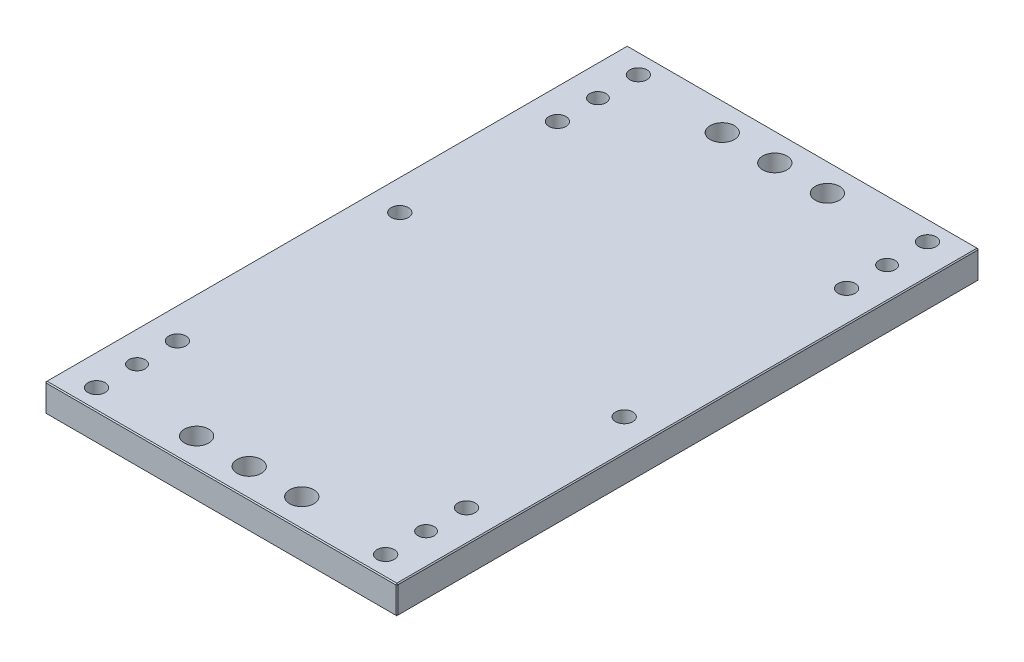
ISO-10303-21;
HEADER;
FILE_DESCRIPTION(('STEP AP214'),'2;1');
FILE_NAME('part.step','',(''),(''),'','','');
FILE_SCHEMA(('AUTOMOTIVE_DESIGN { 1 0 10303 214 1 1 1 1 }'));
ENDSEC;
DATA;
#1=APPLICATION_CONTEXT('core data for automotive mechanical design processes');
#2=APPLICATION_PROTOCOL_DEFINITION('international standard','automotive_design',2000,#1);
#3=PRODUCT_CONTEXT('',#1,'mechanical');
#4=PRODUCT('Part','Part','',(#3));
#5=PRODUCT_RELATED_PRODUCT_CATEGORY('part','',(#4));
#6=PRODUCT_DEFINITION_FORMATION('','',#4);
#7=PRODUCT_DEFINITION_CONTEXT('part definition',#1,'design');
#8=PRODUCT_DEFINITION('design','',#6,#7);
#9=PRODUCT_DEFINITION_SHAPE('','',#8);
#10=(LENGTH_UNIT() NAMED_UNIT(*) SI_UNIT(.MILLI.,.METRE.));
#11=(NAMED_UNIT(*) PLANE_ANGLE_UNIT() SI_UNIT($,.RADIAN.));
#12=(NAMED_UNIT(*) SI_UNIT($,.STERADIAN.) SOLID_ANGLE_UNIT());
#13=UNCERTAINTY_MEASURE_WITH_UNIT(LENGTH_MEASURE(1.E-05),#10,'distance_accuracy_value','');
#14=(GEOMETRIC_REPRESENTATION_CONTEXT(3) GLOBAL_UNCERTAINTY_ASSIGNED_CONTEXT((#13)) GLOBAL_UNIT_ASSIGNED_CONTEXT((#10,
#11,#12)) REPRESENTATION_CONTEXT('',''));
#15=CARTESIAN_POINT('',(0.,0.,0.));
#16=DIRECTION('',(0.,0.,1.));
#17=DIRECTION('',(1.,0.,0.));
#18=AXIS2_PLACEMENT_3D('',#15,#16,#17);
#19=CARTESIAN_POINT('',(0.,22.225,206.375));
#20=DIRECTION('',(0.,-1.,0.));
#21=DIRECTION('',(0.,0.,-1.));
#22=AXIS2_PLACEMENT_3D('',#19,#20,#21);
#23=CYLINDRICAL_SURFACE('',#22,9.525);
#24=CARTESIAN_POINT('',(0.,22.225,206.375));
#25=DIRECTION('',(0.,-1.,0.));
#26=DIRECTION('',(0.,0.,-1.));
#27=AXIS2_PLACEMENT_3D('',#24,#25,#26);
#28=CIRCLE('',#27,9.525);
#29=CARTESIAN_POINT('',(0.,22.225,196.85));
#30=VERTEX_POINT('',#29);
#31=EDGE_CURVE('E208',#30,#30,#28,.T.);
#32=CARTESIAN_POINT('',(0.,4.76250000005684,206.375));
#33=DIRECTION('',(0.,-1.,0.));
#34=DIRECTION('',(0.,0.,-1.));
#35=AXIS2_PLACEMENT_3D('',#32,#33,#34);
#36=CIRCLE('',#35,9.525);
#37=CARTESIAN_POINT('',(0.,4.76250000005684,196.85));
#38=VERTEX_POINT('',#37);
#39=EDGE_CURVE('E38',#38,#38,#36,.F.);
#40=CARTESIAN_POINT('',(0.,22.225,196.85));
#41=CARTESIAN_POINT('',(0.,22.043098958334,196.85));
#42=CARTESIAN_POINT('',(0.,21.8611979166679,196.85));
#43=CARTESIAN_POINT('',(0.,21.4973958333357,196.85));
#44=CARTESIAN_POINT('',(0.,21.3154947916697,196.85));
#45=CARTESIAN_POINT('',(0.,20.9516927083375,196.85));
#46=CARTESIAN_POINT('',(0.,20.7697916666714,196.85));
#47=CARTESIAN_POINT('',(0.,20.4059895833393,196.85));
#48=CARTESIAN_POINT('',(0.,20.2240885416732,196.85));
#49=CARTESIAN_POINT('',(0.,19.8602864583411,196.85));
#50=CARTESIAN_POINT('',(0.,19.678385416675,196.85));
#51=CARTESIAN_POINT('',(0.,19.3145833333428,196.85));
#52=CARTESIAN_POINT('',(0.,19.1326822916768,196.85));
#53=CARTESIAN_POINT('',(0.,18.7688802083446,196.85));
#54=CARTESIAN_POINT('',(0.,18.5869791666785,196.85));
#55=CARTESIAN_POINT('',(0.,18.2231770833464,196.85));
#56=CARTESIAN_POINT('',(0.,18.0412760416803,196.85));
#57=CARTESIAN_POINT('',(0.,17.6774739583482,196.85));
#58=CARTESIAN_POINT('',(0.,17.4955729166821,196.85));
#59=CARTESIAN_POINT('',(0.,17.1317708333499,196.85));
#60=CARTESIAN_POINT('',(0.,16.9498697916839,196.85));
#61=CARTESIAN_POINT('',(0.,16.5860677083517,196.85));
#62=CARTESIAN_POINT('',(0.,16.4041666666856,196.85));
#63=CARTESIAN_POINT('',(0.,16.0403645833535,196.85));
#64=CARTESIAN_POINT('',(0.,15.8584635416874,196.85));
#65=CARTESIAN_POINT('',(0.,15.4946614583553,196.85));
#66=CARTESIAN_POINT('',(0.,15.3127604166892,196.85));
#67=CARTESIAN_POINT('',(0.,14.948958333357,196.85));
#68=CARTESIAN_POINT('',(0.,14.767057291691,196.85));
#69=CARTESIAN_POINT('',(0.,14.4032552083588,196.85));
#70=CARTESIAN_POINT('',(0.,14.2213541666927,196.85));
#71=CARTESIAN_POINT('',(0.,13.8575520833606,196.85));
#72=CARTESIAN_POINT('',(0.,13.6756510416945,196.85));
#73=CARTESIAN_POINT('',(0.,13.3118489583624,196.85));
#74=CARTESIAN_POINT('',(0.,13.1299479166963,196.85));
#75=CARTESIAN_POINT('',(0.,12.7661458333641,196.85));
#76=CARTESIAN_POINT('',(0.,12.5842447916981,196.85));
#77=CARTESIAN_POINT('',(0.,12.2204427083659,196.85));
#78=CARTESIAN_POINT('',(0.,12.0385416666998,196.85));
#79=CARTESIAN_POINT('',(0.,11.6747395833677,196.85));
#80=CARTESIAN_POINT('',(0.,11.4928385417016,196.85));
#81=CARTESIAN_POINT('',(0.,11.1290364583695,196.85));
#82=CARTESIAN_POINT('',(0.,10.9471354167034,196.85));
#83=CARTESIAN_POINT('',(0.,10.5833333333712,196.85));
#84=CARTESIAN_POINT('',(0.,10.4014322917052,196.85));
#85=CARTESIAN_POINT('',(0.,10.037630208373,196.85));
#86=CARTESIAN_POINT('',(0.,9.85572916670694,196.85));
#87=CARTESIAN_POINT('',(0.,9.49192708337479,196.85));
#88=CARTESIAN_POINT('',(0.,9.31002604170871,196.85));
#89=CARTESIAN_POINT('',(0.,8.94622395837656,196.85));
#90=CARTESIAN_POINT('',(0.,8.76432291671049,196.85));
#91=CARTESIAN_POINT('',(0.,8.40052083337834,196.85));
#92=CARTESIAN_POINT('',(0.,8.21861979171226,196.85));
#93=CARTESIAN_POINT('',(0.,7.85481770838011,196.85));
#94=CARTESIAN_POINT('',(0.,7.67291666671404,196.85));
#95=CARTESIAN_POINT('',(0.,7.30911458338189,196.85));
#96=CARTESIAN_POINT('',(0.,7.12721354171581,196.85));
#97=CARTESIAN_POINT('',(0.,6.76341145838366,196.85));
#98=CARTESIAN_POINT('',(0.,6.58151041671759,196.85));
#99=CARTESIAN_POINT('',(0.,6.21770833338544,196.85));
#100=CARTESIAN_POINT('',(0.,6.03580729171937,196.85));
#101=CARTESIAN_POINT('',(0.,5.67200520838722,196.85));
#102=CARTESIAN_POINT('',(0.,5.49010416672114,196.85));
#103=CARTESIAN_POINT('',(0.,5.12630208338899,196.85));
#104=CARTESIAN_POINT('',(0.,4.94440104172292,196.85));
#105=CARTESIAN_POINT('',(0.,4.76250000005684,196.85));
#106=B_SPLINE_CURVE_WITH_KNOTS('',3,(#40,#41,#42,#43,#44,#45,#46,#47,#48,#49,#50,#51,#52,#53,
#54,#55,#56,#57,#58,#59,#60,#61,#62,#63,#64,#65,#66,#67,#68,#69,#70,#71,#72,#73,#74,#75,#76,#77,
#78,#79,#80,#81,#82,#83,#84,#85,#86,#87,#88,#89,#90,#91,#92,#93,#94,#95,#96,#97,#98,#99,#100,
#101,#102,#103,#104,#105),.UNSPECIFIED.,.F.,.F.,(4,2,2,2,2,2,2,2,2,2,2,2,2,2,2,2,2,2,2,2,2,2,2,
2,2,2,2,2,2,2,2,2,4),(0.,0.545703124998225,1.09140624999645,1.63710937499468,2.1828124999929,
2.72851562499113,3.27421874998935,3.81992187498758,4.3656249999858,4.91132812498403,
5.45703124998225,6.00273437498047,6.5484374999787,7.09414062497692,7.63984374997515,
8.18554687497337,8.7312499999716,9.27695312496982,9.82265624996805,10.3683593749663,
10.9140624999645,11.4597656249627,12.0054687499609,12.5511718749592,13.0968749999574,
13.6425781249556,14.1882812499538,14.7339843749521,15.2796874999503,15.8253906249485,
16.3710937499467,16.916796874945,17.4624999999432),.UNSPECIFIED.);
#107=EDGE_CURVE('BSEAM34',#30,#38,#106,.T.);
#108=ORIENTED_EDGE('',*,*,#31,.F.);
#109=ORIENTED_EDGE('',*,*,#39,.F.);
#110=ORIENTED_EDGE('',*,*,#107,.T.);
#111=ORIENTED_EDGE('',*,*,#107,.F.);
#112=EDGE_LOOP('',(#108,#110,#109,#111));
#113=FACE_BOUND('',#112,.T.);
#114=ADVANCED_FACE('F34',(#113),#23,.F.);
#115=CARTESIAN_POINT('',(0.,22.225,-206.375));
#116=DIRECTION('',(0.,-1.,0.));
#117=DIRECTION('',(0.,0.,-1.));
#118=AXIS2_PLACEMENT_3D('',#115,#116,#117);
#119=CYLINDRICAL_SURFACE('',#118,9.525);
#120=CARTESIAN_POINT('',(0.,22.225,-206.375));
#121=DIRECTION('',(0.,-1.,0.));
#122=DIRECTION('',(0.,0.,-1.));
#123=AXIS2_PLACEMENT_3D('',#120,#121,#122);
#124=CIRCLE('',#123,9.525);
#125=CARTESIAN_POINT('',(0.,22.225,-215.9));
#126=VERTEX_POINT('',#125);
#127=EDGE_CURVE('E259',#126,#126,#124,.T.);
#128=CARTESIAN_POINT('',(0.,4.76250000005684,-206.375));
#129=DIRECTION('',(0.,-1.,0.));
#130=DIRECTION('',(0.,0.,-1.));
#131=AXIS2_PLACEMENT_3D('',#128,#129,#130);
#132=CIRCLE('',#131,9.525);
#133=CARTESIAN_POINT('',(0.,4.76250000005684,-215.9));
#134=VERTEX_POINT('',#133);
#135=EDGE_CURVE('E224',#134,#134,#132,.F.);
#136=CARTESIAN_POINT('',(0.,22.225,-215.9));
#137=CARTESIAN_POINT('',(0.,22.043098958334,-215.9));
#138=CARTESIAN_POINT('',(0.,21.8611979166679,-215.9));
#139=CARTESIAN_POINT('',(0.,21.4973958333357,-215.9));
#140=CARTESIAN_POINT('',(0.,21.3154947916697,-215.9));
#141=CARTESIAN_POINT('',(0.,20.9516927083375,-215.9));
#142=CARTESIAN_POINT('',(0.,20.7697916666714,-215.9));
#143=CARTESIAN_POINT('',(0.,20.4059895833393,-215.9));
#144=CARTESIAN_POINT('',(0.,20.2240885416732,-215.9));
#145=CARTESIAN_POINT('',(0.,19.8602864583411,-215.9));
#146=CARTESIAN_POINT('',(0.,19.678385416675,-215.9));
#147=CARTESIAN_POINT('',(0.,19.3145833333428,-215.9));
#148=CARTESIAN_POINT('',(0.,19.1326822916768,-215.9));
#149=CARTESIAN_POINT('',(0.,18.7688802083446,-215.9));
#150=CARTESIAN_POINT('',(0.,18.5869791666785,-215.9));
#151=CARTESIAN_POINT('',(0.,18.2231770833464,-215.9));
#152=CARTESIAN_POINT('',(0.,18.0412760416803,-215.9));
#153=CARTESIAN_POINT('',(0.,17.6774739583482,-215.9));
#154=CARTESIAN_POINT('',(0.,17.4955729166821,-215.9));
#155=CARTESIAN_POINT('',(0.,17.1317708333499,-215.9));
#156=CARTESIAN_POINT('',(0.,16.9498697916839,-215.9));
#157=CARTESIAN_POINT('',(0.,16.5860677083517,-215.9));
#158=CARTESIAN_POINT('',(0.,16.4041666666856,-215.9));
#159=CARTESIAN_POINT('',(0.,16.0403645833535,-215.9));
#160=CARTESIAN_POINT('',(0.,15.8584635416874,-215.9));
#161=CARTESIAN_POINT('',(0.,15.4946614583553,-215.9));
#162=CARTESIAN_POINT('',(0.,15.3127604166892,-215.9));
#163=CARTESIAN_POINT('',(0.,14.948958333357,-215.9));
#164=CARTESIAN_POINT('',(0.,14.767057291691,-215.9));
#165=CARTESIAN_POINT('',(0.,14.4032552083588,-215.9));
#166=CARTESIAN_POINT('',(0.,14.2213541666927,-215.9));
#167=CARTESIAN_POINT('',(0.,13.8575520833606,-215.9));
#168=CARTESIAN_POINT('',(0.,13.6756510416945,-215.9));
#169=CARTESIAN_POINT('',(0.,13.3118489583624,-215.9));
#170=CARTESIAN_POINT('',(0.,13.1299479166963,-215.9));
#171=CARTESIAN_POINT('',(0.,12.7661458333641,-215.9));
#172=CARTESIAN_POINT('',(0.,12.5842447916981,-215.9));
#173=CARTESIAN_POINT('',(0.,12.2204427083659,-215.9));
#174=CARTESIAN_POINT('',(0.,12.0385416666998,-215.9));
#175=CARTESIAN_POINT('',(0.,11.6747395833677,-215.9));
#176=CARTESIAN_POINT('',(0.,11.4928385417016,-215.9));
#177=CARTESIAN_POINT('',(0.,11.1290364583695,-215.9));
#178=CARTESIAN_POINT('',(0.,10.9471354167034,-215.9));
#179=CARTESIAN_POINT('',(0.,10.5833333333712,-215.9));
#180=CARTESIAN_POINT('',(0.,10.4014322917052,-215.9));
#181=CARTESIAN_POINT('',(0.,10.037630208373,-215.9));
#182=CARTESIAN_POINT('',(0.,9.85572916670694,-215.9));
#183=CARTESIAN_POINT('',(0.,9.49192708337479,-215.9));
#184=CARTESIAN_POINT('',(0.,9.31002604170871,-215.9));
#185=CARTESIAN_POINT('',(0.,8.94622395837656,-215.9));
#186=CARTESIAN_POINT('',(0.,8.76432291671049,-215.9));
#187=CARTESIAN_POINT('',(0.,8.40052083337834,-215.9));
#188=CARTESIAN_POINT('',(0.,8.21861979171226,-215.9));
#189=CARTESIAN_POINT('',(0.,7.85481770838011,-215.9));
#190=CARTESIAN_POINT('',(0.,7.67291666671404,-215.9));
#191=CARTESIAN_POINT('',(0.,7.30911458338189,-215.9));
#192=CARTESIAN_POINT('',(0.,7.12721354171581,-215.9));
#193=CARTESIAN_POINT('',(0.,6.76341145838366,-215.9));
#194=CARTESIAN_POINT('',(0.,6.58151041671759,-215.9));
#195=CARTESIAN_POINT('',(0.,6.21770833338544,-215.9));
#196=CARTESIAN_POINT('',(0.,6.03580729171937,-215.9));
#197=CARTESIAN_POINT('',(0.,5.67200520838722,-215.9));
#198=CARTESIAN_POINT('',(0.,5.49010416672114,-215.9));
#199=CARTESIAN_POINT('',(0.,5.12630208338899,-215.9));
#200=CARTESIAN_POINT('',(0.,4.94440104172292,-215.9));
#201=CARTESIAN_POINT('',(0.,4.76250000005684,-215.9));
#202=B_SPLINE_CURVE_WITH_KNOTS('',3,(#136,#137,#138,#139,#140,#141,#142,#143,#144,#145,#146,
#147,#148,#149,#150,#151,#152,#153,#154,#155,#156,#157,#158,#159,#160,#161,#162,#163,#164,#165,
#166,#167,#168,#169,#170,#171,#172,#173,#174,#175,#176,#177,#178,#179,#180,#181,#182,#183,#184,
#185,#186,#187,#188,#189,#190,#191,#192,#193,#194,#195,#196,#197,#198,#199,#200,#201),
.UNSPECIFIED.,.F.,.F.,(4,2,2,2,2,2,2,2,2,2,2,2,2,2,2,2,2,2,2,2,2,2,2,2,2,2,2,2,2,2,2,2,4),(0.,
0.545703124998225,1.09140624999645,1.63710937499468,2.1828124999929,2.72851562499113,
3.27421874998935,3.81992187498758,4.3656249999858,4.91132812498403,5.45703124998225,
6.00273437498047,6.5484374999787,7.09414062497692,7.63984374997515,8.18554687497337,
8.7312499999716,9.27695312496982,9.82265624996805,10.3683593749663,10.9140624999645,
11.4597656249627,12.0054687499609,12.5511718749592,13.0968749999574,13.6425781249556,
14.1882812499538,14.7339843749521,15.2796874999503,15.8253906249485,16.3710937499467,
16.916796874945,17.4624999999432),.UNSPECIFIED.);
#203=EDGE_CURVE('BSEAM551',#126,#134,#202,.T.);
#204=ORIENTED_EDGE('',*,*,#127,.F.);
#205=ORIENTED_EDGE('',*,*,#135,.F.);
#206=ORIENTED_EDGE('',*,*,#203,.T.);
#207=ORIENTED_EDGE('',*,*,#203,.F.);
#208=EDGE_LOOP('',(#204,#206,#205,#207));
#209=FACE_BOUND('',#208,.T.);
#210=ADVANCED_FACE('F551',(#209),#119,.F.);
#211=CARTESIAN_POINT('',(41.275,22.225,-206.375));
#212=DIRECTION('',(0.,-1.,0.));
#213=DIRECTION('',(0.,0.,-1.));
#214=AXIS2_PLACEMENT_3D('',#211,#212,#213);
#215=CYLINDRICAL_SURFACE('',#214,9.525);
#216=CARTESIAN_POINT('',(41.275,22.225,-206.375));
#217=DIRECTION('',(0.,-1.,0.));
#218=DIRECTION('',(0.,0.,-1.));
#219=AXIS2_PLACEMENT_3D('',#216,#217,#218);
#220=CIRCLE('',#219,9.525);
#221=CARTESIAN_POINT('',(41.275,22.225,-215.9));
#222=VERTEX_POINT('',#221);
#223=EDGE_CURVE('E262',#222,#222,#220,.T.);
#224=ORIENTED_EDGE('',*,*,#223,.F.);
#225=EDGE_LOOP('',(#224));
#226=FACE_BOUND('',#225,.T.);
#227=CARTESIAN_POINT('',(41.275,4.76250000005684,-206.375));
#228=DIRECTION('',(0.,-1.,0.));
#229=DIRECTION('',(0.,0.,-1.));
#230=AXIS2_PLACEMENT_3D('',#227,#228,#229);
#231=CIRCLE('',#230,9.525);
#232=CARTESIAN_POINT('',(41.275,4.76250000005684,-215.9));
#233=VERTEX_POINT('',#232);
#234=EDGE_CURVE('E220',#233,#233,#231,.F.);
#235=ORIENTED_EDGE('',*,*,#234,.F.);
#236=EDGE_LOOP('',(#235));
#237=FACE_BOUND('',#236,.T.);
#238=ADVANCED_FACE('F557',(#226,#237),#215,.F.);
#239=CARTESIAN_POINT('',(41.275,22.225,206.375));
#240=DIRECTION('',(0.,-1.,0.));
#241=DIRECTION('',(0.,0.,-1.));
#242=AXIS2_PLACEMENT_3D('',#239,#240,#241);
#243=CYLINDRICAL_SURFACE('',#242,9.525);
#244=CARTESIAN_POINT('',(41.275,22.225,206.375));
#245=DIRECTION('',(0.,-1.,0.));
#246=DIRECTION('',(0.,0.,-1.));
#247=AXIS2_PLACEMENT_3D('',#244,#245,#246);
#248=CIRCLE('',#247,9.525);
#249=CARTESIAN_POINT('',(41.275,22.225,196.85));
#250=VERTEX_POINT('',#249);
#251=EDGE_CURVE('E265',#250,#250,#248,.T.);
#252=CARTESIAN_POINT('',(41.275,4.76250000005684,206.375));
#253=DIRECTION('',(0.,-1.,0.));
#254=DIRECTION('',(0.,0.,-1.));
#255=AXIS2_PLACEMENT_3D('',#252,#253,#254);
#256=CIRCLE('',#255,9.525);
#257=CARTESIAN_POINT('',(41.275,4.76250000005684,196.85));
#258=VERTEX_POINT('',#257);
#259=EDGE_CURVE('E215',#258,#258,#256,.F.);
#260=CARTESIAN_POINT('',(41.275,22.225,196.85));
#261=CARTESIAN_POINT('',(41.275,22.043098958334,196.85));
#262=CARTESIAN_POINT('',(41.275,21.8611979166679,196.85));
#263=CARTESIAN_POINT('',(41.275,21.4973958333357,196.85));
#264=CARTESIAN_POINT('',(41.275,21.3154947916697,196.85));
#265=CARTESIAN_POINT('',(41.275,20.9516927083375,196.85));
#266=CARTESIAN_POINT('',(41.275,20.7697916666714,196.85));
#267=CARTESIAN_POINT('',(41.275,20.4059895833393,196.85));
#268=CARTESIAN_POINT('',(41.275,20.2240885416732,196.85));
#269=CARTESIAN_POINT('',(41.275,19.8602864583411,196.85));
#270=CARTESIAN_POINT('',(41.275,19.678385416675,196.85));
#271=CARTESIAN_POINT('',(41.275,19.3145833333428,196.85));
#272=CARTESIAN_POINT('',(41.275,19.1326822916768,196.85));
#273=CARTESIAN_POINT('',(41.275,18.7688802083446,196.85));
#274=CARTESIAN_POINT('',(41.275,18.5869791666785,196.85));
#275=CARTESIAN_POINT('',(41.275,18.2231770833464,196.85));
#276=CARTESIAN_POINT('',(41.275,18.0412760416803,196.85));
#277=CARTESIAN_POINT('',(41.275,17.6774739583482,196.85));
#278=CARTESIAN_POINT('',(41.275,17.4955729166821,196.85));
#279=CARTESIAN_POINT('',(41.275,17.1317708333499,196.85));
#280=CARTESIAN_POINT('',(41.275,16.9498697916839,196.85));
#281=CARTESIAN_POINT('',(41.275,16.5860677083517,196.85));
#282=CARTESIAN_POINT('',(41.275,16.4041666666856,196.85));
#283=CARTESIAN_POINT('',(41.275,16.0403645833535,196.85));
#284=CARTESIAN_POINT('',(41.275,15.8584635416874,196.85));
#285=CARTESIAN_POINT('',(41.275,15.4946614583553,196.85));
#286=CARTESIAN_POINT('',(41.275,15.3127604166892,196.85));
#287=CARTESIAN_POINT('',(41.275,14.948958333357,196.85));
#288=CARTESIAN_POINT('',(41.275,14.767057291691,196.85));
#289=CARTESIAN_POINT('',(41.275,14.4032552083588,196.85));
#290=CARTESIAN_POINT('',(41.275,14.2213541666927,196.85));
#291=CARTESIAN_POINT('',(41.275,13.8575520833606,196.85));
#292=CARTESIAN_POINT('',(41.275,13.6756510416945,196.85));
#293=CARTESIAN_POINT('',(41.275,13.3118489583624,196.85));
#294=CARTESIAN_POINT('',(41.275,13.1299479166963,196.85));
#295=CARTESIAN_POINT('',(41.275,12.7661458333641,196.85));
#296=CARTESIAN_POINT('',(41.275,12.5842447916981,196.85));
#297=CARTESIAN_POINT('',(41.275,12.2204427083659,196.85));
#298=CARTESIAN_POINT('',(41.275,12.0385416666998,196.85));
#299=CARTESIAN_POINT('',(41.275,11.6747395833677,196.85));
#300=CARTESIAN_POINT('',(41.275,11.4928385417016,196.85));
#301=CARTESIAN_POINT('',(41.275,11.1290364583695,196.85));
#302=CARTESIAN_POINT('',(41.275,10.9471354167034,196.85));
#303=CARTESIAN_POINT('',(41.275,10.5833333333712,196.85));
#304=CARTESIAN_POINT('',(41.275,10.4014322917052,196.85));
#305=CARTESIAN_POINT('',(41.275,10.037630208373,196.85));
#306=CARTESIAN_POINT('',(41.275,9.85572916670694,196.85));
#307=CARTESIAN_POINT('',(41.275,9.49192708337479,196.85));
#308=CARTESIAN_POINT('',(41.275,9.31002604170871,196.85));
#309=CARTESIAN_POINT('',(41.275,8.94622395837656,196.85));
#310=CARTESIAN_POINT('',(41.275,8.76432291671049,196.85));
#311=CARTESIAN_POINT('',(41.275,8.40052083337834,196.85));
#312=CARTESIAN_POINT('',(41.275,8.21861979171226,196.85));
#313=CARTESIAN_POINT('',(41.275,7.85481770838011,196.85));
#314=CARTESIAN_POINT('',(41.275,7.67291666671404,196.85));
#315=CARTESIAN_POINT('',(41.275,7.30911458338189,196.85));
#316=CARTESIAN_POINT('',(41.275,7.12721354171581,196.85));
#317=CARTESIAN_POINT('',(41.275,6.76341145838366,196.85));
#318=CARTESIAN_POINT('',(41.275,6.58151041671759,196.85));
#319=CARTESIAN_POINT('',(41.275,6.21770833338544,196.85));
#320=CARTESIAN_POINT('',(41.275,6.03580729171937,196.85));
#321=CARTESIAN_POINT('',(41.275,5.67200520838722,196.85));
#322=CARTESIAN_POINT('',(41.275,5.49010416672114,196.85));
#323=CARTESIAN_POINT('',(41.275,5.12630208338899,196.85));
#324=CARTESIAN_POINT('',(41.275,4.94440104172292,196.85));
#325=CARTESIAN_POINT('',(41.275,4.76250000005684,196.85));
#326=B_SPLINE_CURVE_WITH_KNOTS('',3,(#260,#261,#262,#263,#264,#265,#266,#267,#268,#269,#270,
#271,#272,#273,#274,#275,#276,#277,#278,#279,#280,#281,#282,#283,#284,#285,#286,#287,#288,#289,
#290,#291,#292,#293,#294,#295,#296,#297,#298,#299,#300,#301,#302,#303,#304,#305,#306,#307,#308,
#309,#310,#311,#312,#313,#314,#315,#316,#317,#318,#319,#320,#321,#322,#323,#324,#325),
.UNSPECIFIED.,.F.,.F.,(4,2,2,2,2,2,2,2,2,2,2,2,2,2,2,2,2,2,2,2,2,2,2,2,2,2,2,2,2,2,2,2,4),(0.,
0.545703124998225,1.09140624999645,1.63710937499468,2.1828124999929,2.72851562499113,
3.27421874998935,3.81992187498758,4.3656249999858,4.91132812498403,5.45703124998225,
6.00273437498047,6.5484374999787,7.09414062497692,7.63984374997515,8.18554687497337,
8.7312499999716,9.27695312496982,9.82265624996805,10.3683593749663,10.9140624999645,
11.4597656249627,12.0054687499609,12.5511718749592,13.0968749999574,13.6425781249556,
14.1882812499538,14.7339843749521,15.2796874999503,15.8253906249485,16.3710937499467,
16.916796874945,17.4624999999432),.UNSPECIFIED.);
#327=EDGE_CURVE('BSEAM568',#250,#258,#326,.T.);
#328=ORIENTED_EDGE('',*,*,#251,.F.);
#329=ORIENTED_EDGE('',*,*,#259,.F.);
#330=ORIENTED_EDGE('',*,*,#327,.T.);
#331=ORIENTED_EDGE('',*,*,#327,.F.);
#332=EDGE_LOOP('',(#328,#330,#329,#331));
#333=FACE_BOUND('',#332,.T.);
#334=ADVANCED_FACE('F568',(#333),#243,.F.);
#335=CARTESIAN_POINT('',(-41.275,22.225,206.375));
#336=DIRECTION('',(0.,-1.,0.));
#337=DIRECTION('',(0.,0.,-1.));
#338=AXIS2_PLACEMENT_3D('',#335,#336,#337);
#339=CYLINDRICAL_SURFACE('',#338,9.525);
#340=CARTESIAN_POINT('',(-41.275,22.225,206.375));
#341=DIRECTION('',(0.,-1.,0.));
#342=DIRECTION('',(0.,0.,-1.));
#343=AXIS2_PLACEMENT_3D('',#340,#341,#342);
#344=CIRCLE('',#343,9.525);
#345=CARTESIAN_POINT('',(-41.275,22.225,196.85));
#346=VERTEX_POINT('',#345);
#347=EDGE_CURVE('E268',#346,#346,#344,.T.);
#348=CARTESIAN_POINT('',(-41.275,4.76250000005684,206.375));
#349=DIRECTION('',(0.,-1.,0.));
#350=DIRECTION('',(0.,0.,-1.));
#351=AXIS2_PLACEMENT_3D('',#348,#349,#350);
#352=CIRCLE('',#351,9.525);
#353=CARTESIAN_POINT('',(-41.275,4.76250000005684,196.85));
#354=VERTEX_POINT('',#353);
#355=EDGE_CURVE('E210',#354,#354,#352,.F.);
#356=CARTESIAN_POINT('',(-41.275,22.225,196.85));
#357=CARTESIAN_POINT('',(-41.275,22.043098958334,196.85));
#358=CARTESIAN_POINT('',(-41.275,21.8611979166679,196.85));
#359=CARTESIAN_POINT('',(-41.275,21.4973958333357,196.85));
#360=CARTESIAN_POINT('',(-41.275,21.3154947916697,196.85));
#361=CARTESIAN_POINT('',(-41.275,20.9516927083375,196.85));
#362=CARTESIAN_POINT('',(-41.275,20.7697916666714,196.85));
#363=CARTESIAN_POINT('',(-41.275,20.4059895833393,196.85));
#364=CARTESIAN_POINT('',(-41.275,20.2240885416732,196.85));
#365=CARTESIAN_POINT('',(-41.275,19.8602864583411,196.85));
#366=CARTESIAN_POINT('',(-41.275,19.678385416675,196.85));
#367=CARTESIAN_POINT('',(-41.275,19.3145833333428,196.85));
#368=CARTESIAN_POINT('',(-41.275,19.1326822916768,196.85));
#369=CARTESIAN_POINT('',(-41.275,18.7688802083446,196.85));
#370=CARTESIAN_POINT('',(-41.275,18.5869791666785,196.85));
#371=CARTESIAN_POINT('',(-41.275,18.2231770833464,196.85));
#372=CARTESIAN_POINT('',(-41.275,18.0412760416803,196.85));
#373=CARTESIAN_POINT('',(-41.275,17.6774739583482,196.85));
#374=CARTESIAN_POINT('',(-41.275,17.4955729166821,196.85));
#375=CARTESIAN_POINT('',(-41.275,17.1317708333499,196.85));
#376=CARTESIAN_POINT('',(-41.275,16.9498697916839,196.85));
#377=CARTESIAN_POINT('',(-41.275,16.5860677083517,196.85));
#378=CARTESIAN_POINT('',(-41.275,16.4041666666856,196.85));
#379=CARTESIAN_POINT('',(-41.275,16.0403645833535,196.85));
#380=CARTESIAN_POINT('',(-41.275,15.8584635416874,196.85));
#381=CARTESIAN_POINT('',(-41.275,15.4946614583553,196.85));
#382=CARTESIAN_POINT('',(-41.275,15.3127604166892,196.85));
#383=CARTESIAN_POINT('',(-41.275,14.948958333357,196.85));
#384=CARTESIAN_POINT('',(-41.275,14.767057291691,196.85));
#385=CARTESIAN_POINT('',(-41.275,14.4032552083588,196.85));
#386=CARTESIAN_POINT('',(-41.275,14.2213541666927,196.85));
#387=CARTESIAN_POINT('',(-41.275,13.8575520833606,196.85));
#388=CARTESIAN_POINT('',(-41.275,13.6756510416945,196.85));
#389=CARTESIAN_POINT('',(-41.275,13.3118489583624,196.85));
#390=CARTESIAN_POINT('',(-41.275,13.1299479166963,196.85));
#391=CARTESIAN_POINT('',(-41.275,12.7661458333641,196.85));
#392=CARTESIAN_POINT('',(-41.275,12.5842447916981,196.85));
#393=CARTESIAN_POINT('',(-41.275,12.2204427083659,196.85));
#394=CARTESIAN_POINT('',(-41.275,12.0385416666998,196.85));
#395=CARTESIAN_POINT('',(-41.275,11.6747395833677,196.85));
#396=CARTESIAN_POINT('',(-41.275,11.4928385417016,196.85));
#397=CARTESIAN_POINT('',(-41.275,11.1290364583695,196.85));
#398=CARTESIAN_POINT('',(-41.275,10.9471354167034,196.85));
#399=CARTESIAN_POINT('',(-41.275,10.5833333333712,196.85));
#400=CARTESIAN_POINT('',(-41.275,10.4014322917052,196.85));
#401=CARTESIAN_POINT('',(-41.275,10.037630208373,196.85));
#402=CARTESIAN_POINT('',(-41.275,9.85572916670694,196.85));
#403=CARTESIAN_POINT('',(-41.275,9.49192708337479,196.85));
#404=CARTESIAN_POINT('',(-41.275,9.31002604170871,196.85));
#405=CARTESIAN_POINT('',(-41.275,8.94622395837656,196.85));
#406=CARTESIAN_POINT('',(-41.275,8.76432291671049,196.85));
#407=CARTESIAN_POINT('',(-41.275,8.40052083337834,196.85));
#408=CARTESIAN_POINT('',(-41.275,8.21861979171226,196.85));
#409=CARTESIAN_POINT('',(-41.275,7.85481770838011,196.85));
#410=CARTESIAN_POINT('',(-41.275,7.67291666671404,196.85));
#411=CARTESIAN_POINT('',(-41.275,7.30911458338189,196.85));
#412=CARTESIAN_POINT('',(-41.275,7.12721354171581,196.85));
#413=CARTESIAN_POINT('',(-41.275,6.76341145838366,196.85));
#414=CARTESIAN_POINT('',(-41.275,6.58151041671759,196.85));
#415=CARTESIAN_POINT('',(-41.275,6.21770833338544,196.85));
#416=CARTESIAN_POINT('',(-41.275,6.03580729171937,196.85));
#417=CARTESIAN_POINT('',(-41.275,5.67200520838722,196.85));
#418=CARTESIAN_POINT('',(-41.275,5.49010416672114,196.85));
#419=CARTESIAN_POINT('',(-41.275,5.12630208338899,196.85));
#420=CARTESIAN_POINT('',(-41.275,4.94440104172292,196.85));
#421=CARTESIAN_POINT('',(-41.275,4.76250000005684,196.85));
#422=B_SPLINE_CURVE_WITH_KNOTS('',3,(#356,#357,#358,#359,#360,#361,#362,#363,#364,#365,#366,
#367,#368,#369,#370,#371,#372,#373,#374,#375,#376,#377,#378,#379,#380,#381,#382,#383,#384,#385,
#386,#387,#388,#389,#390,#391,#392,#393,#394,#395,#396,#397,#398,#399,#400,#401,#402,#403,#404,
#405,#406,#407,#408,#409,#410,#411,#412,#413,#414,#415,#416,#417,#418,#419,#420,#421),
.UNSPECIFIED.,.F.,.F.,(4,2,2,2,2,2,2,2,2,2,2,2,2,2,2,2,2,2,2,2,2,2,2,2,2,2,2,2,2,2,2,2,4),(0.,
0.545703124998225,1.09140624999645,1.63710937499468,2.1828124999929,2.72851562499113,
3.27421874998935,3.81992187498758,4.3656249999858,4.91132812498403,5.45703124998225,
6.00273437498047,6.5484374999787,7.09414062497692,7.63984374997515,8.18554687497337,
8.7312499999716,9.27695312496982,9.82265624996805,10.3683593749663,10.9140624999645,
11.4597656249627,12.0054687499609,12.5511718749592,13.0968749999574,13.6425781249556,
14.1882812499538,14.7339843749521,15.2796874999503,15.8253906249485,16.3710937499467,
16.916796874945,17.4624999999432),.UNSPECIFIED.);
#423=EDGE_CURVE('BSEAM572',#346,#354,#422,.T.);
#424=ORIENTED_EDGE('',*,*,#347,.F.);
#425=ORIENTED_EDGE('',*,*,#355,.F.);
#426=ORIENTED_EDGE('',*,*,#423,.T.);
#427=ORIENTED_EDGE('',*,*,#423,.F.);
#428=EDGE_LOOP('',(#424,#426,#425,#427));
#429=FACE_BOUND('',#428,.T.);
#430=ADVANCED_FACE('F572',(#429),#339,.F.);
#431=CARTESIAN_POINT('',(-41.275,22.225,-206.375));
#432=DIRECTION('',(0.,-1.,0.));
#433=DIRECTION('',(0.,0.,-1.));
#434=AXIS2_PLACEMENT_3D('',#431,#432,#433);
#435=CYLINDRICAL_SURFACE('',#434,9.525);
#436=CARTESIAN_POINT('',(-41.275,22.225,-206.375));
#437=DIRECTION('',(0.,-1.,0.));
#438=DIRECTION('',(0.,0.,-1.));
#439=AXIS2_PLACEMENT_3D('',#436,#437,#438);
#440=CIRCLE('',#439,9.525);
#441=CARTESIAN_POINT('',(-41.275,22.225,-215.9));
#442=VERTEX_POINT('',#441);
#443=EDGE_CURVE('E271',#442,#442,#440,.T.);
#444=CARTESIAN_POINT('',(-41.275,4.7625,-206.375));
#445=DIRECTION('',(0.,-1.,0.));
#446=DIRECTION('',(0.,0.,-1.));
#447=AXIS2_PLACEMENT_3D('',#444,#445,#446);
#448=CIRCLE('',#447,9.525);
#449=CARTESIAN_POINT('',(-41.275,4.7625,-215.9));
#450=VERTEX_POINT('',#449);
#451=EDGE_CURVE('E205',#450,#450,#448,.F.);
#452=CARTESIAN_POINT('',(-41.275,22.225,-215.9));
#453=CARTESIAN_POINT('',(-41.275,22.0430989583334,-215.9));
#454=CARTESIAN_POINT('',(-41.275,21.8611979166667,-215.9));
#455=CARTESIAN_POINT('',(-41.275,21.4973958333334,-215.9));
#456=CARTESIAN_POINT('',(-41.275,21.3154947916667,-215.9));
#457=CARTESIAN_POINT('',(-41.275,20.9516927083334,-215.9));
#458=CARTESIAN_POINT('',(-41.275,20.7697916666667,-215.9));
#459=CARTESIAN_POINT('',(-41.275,20.4059895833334,-215.9));
#460=CARTESIAN_POINT('',(-41.275,20.2240885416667,-215.9));
#461=CARTESIAN_POINT('',(-41.275,19.8602864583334,-215.9));
#462=CARTESIAN_POINT('',(-41.275,19.6783854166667,-215.9));
#463=CARTESIAN_POINT('',(-41.275,19.3145833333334,-215.9));
#464=CARTESIAN_POINT('',(-41.275,19.1326822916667,-215.9));
#465=CARTESIAN_POINT('',(-41.275,18.7688802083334,-215.9));
#466=CARTESIAN_POINT('',(-41.275,18.5869791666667,-215.9));
#467=CARTESIAN_POINT('',(-41.275,18.2231770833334,-215.9));
#468=CARTESIAN_POINT('',(-41.275,18.0412760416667,-215.9));
#469=CARTESIAN_POINT('',(-41.275,17.6774739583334,-215.9));
#470=CARTESIAN_POINT('',(-41.275,17.4955729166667,-215.9));
#471=CARTESIAN_POINT('',(-41.275,17.1317708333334,-215.9));
#472=CARTESIAN_POINT('',(-41.275,16.9498697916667,-215.9));
#473=CARTESIAN_POINT('',(-41.275,16.5860677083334,-215.9));
#474=CARTESIAN_POINT('',(-41.275,16.4041666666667,-215.9));
#475=CARTESIAN_POINT('',(-41.275,16.0403645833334,-215.9));
#476=CARTESIAN_POINT('',(-41.275,15.8584635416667,-215.9));
#477=CARTESIAN_POINT('',(-41.275,15.4946614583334,-215.9));
#478=CARTESIAN_POINT('',(-41.275,15.3127604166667,-215.9));
#479=CARTESIAN_POINT('',(-41.275,14.9489583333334,-215.9));
#480=CARTESIAN_POINT('',(-41.275,14.7670572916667,-215.9));
#481=CARTESIAN_POINT('',(-41.275,14.4032552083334,-215.9));
#482=CARTESIAN_POINT('',(-41.275,14.2213541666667,-215.9));
#483=CARTESIAN_POINT('',(-41.275,13.8575520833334,-215.9));
#484=CARTESIAN_POINT('',(-41.275,13.6756510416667,-215.9));
#485=CARTESIAN_POINT('',(-41.275,13.3118489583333,-215.9));
#486=CARTESIAN_POINT('',(-41.275,13.1299479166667,-215.9));
#487=CARTESIAN_POINT('',(-41.275,12.7661458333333,-215.9));
#488=CARTESIAN_POINT('',(-41.275,12.5842447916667,-215.9));
#489=CARTESIAN_POINT('',(-41.275,12.2204427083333,-215.9));
#490=CARTESIAN_POINT('',(-41.275,12.0385416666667,-215.9));
#491=CARTESIAN_POINT('',(-41.275,11.6747395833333,-215.9));
#492=CARTESIAN_POINT('',(-41.275,11.4928385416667,-215.9));
#493=CARTESIAN_POINT('',(-41.275,11.1290364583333,-215.9));
#494=CARTESIAN_POINT('',(-41.275,10.9471354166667,-215.9));
#495=CARTESIAN_POINT('',(-41.275,10.5833333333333,-215.9));
#496=CARTESIAN_POINT('',(-41.275,10.4014322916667,-215.9));
#497=CARTESIAN_POINT('',(-41.275,10.0376302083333,-215.9));
#498=CARTESIAN_POINT('',(-41.275,9.85572916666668,-215.9));
#499=CARTESIAN_POINT('',(-41.275,9.49192708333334,-215.9));
#500=CARTESIAN_POINT('',(-41.275,9.31002604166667,-215.9));
#501=CARTESIAN_POINT('',(-41.275,8.94622395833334,-215.9));
#502=CARTESIAN_POINT('',(-41.275,8.76432291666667,-215.9));
#503=CARTESIAN_POINT('',(-41.275,8.40052083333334,-215.9));
#504=CARTESIAN_POINT('',(-41.275,8.21861979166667,-215.9));
#505=CARTESIAN_POINT('',(-41.275,7.85481770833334,-215.9));
#506=CARTESIAN_POINT('',(-41.275,7.67291666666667,-215.9));
#507=CARTESIAN_POINT('',(-41.275,7.30911458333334,-215.9));
#508=CARTESIAN_POINT('',(-41.275,7.12721354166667,-215.9));
#509=CARTESIAN_POINT('',(-41.275,6.76341145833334,-215.9));
#510=CARTESIAN_POINT('',(-41.275,6.58151041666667,-215.9));
#511=CARTESIAN_POINT('',(-41.275,6.21770833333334,-215.9));
#512=CARTESIAN_POINT('',(-41.275,6.03580729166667,-215.9));
#513=CARTESIAN_POINT('',(-41.275,5.67200520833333,-215.9));
#514=CARTESIAN_POINT('',(-41.275,5.49010416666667,-215.9));
#515=CARTESIAN_POINT('',(-41.275,5.12630208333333,-215.9));
#516=CARTESIAN_POINT('',(-41.275,4.94440104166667,-215.9));
#517=CARTESIAN_POINT('',(-41.275,4.7625,-215.9));
#518=B_SPLINE_CURVE_WITH_KNOTS('',3,(#452,#453,#454,#455,#456,#457,#458,#459,#460,#461,#462,
#463,#464,#465,#466,#467,#468,#469,#470,#471,#472,#473,#474,#475,#476,#477,#478,#479,#480,#481,
#482,#483,#484,#485,#486,#487,#488,#489,#490,#491,#492,#493,#494,#495,#496,#497,#498,#499,#500,
#501,#502,#503,#504,#505,#506,#507,#508,#509,#510,#511,#512,#513,#514,#515,#516,#517),
.UNSPECIFIED.,.F.,.F.,(4,2,2,2,2,2,2,2,2,2,2,2,2,2,2,2,2,2,2,2,2,2,2,2,2,2,2,2,2,2,2,2,4),(0.,
0.545703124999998,1.09140625,1.637109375,2.1828125,2.728515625,3.27421875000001,
3.81992187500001,4.365625,4.91132812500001,5.45703125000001,6.00273437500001,6.54843750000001,
7.09414062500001,7.63984375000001,8.18554687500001,8.73125000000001,9.27695312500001,
9.82265625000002,10.368359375,10.9140625,11.459765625,12.00546875,12.551171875,13.096875,
13.642578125,14.18828125,14.733984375,15.2796875,15.825390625,16.37109375,16.916796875,17.4625),.UNSPECIFIED.);
#519=EDGE_CURVE('BSEAM576',#442,#450,#518,.T.);
#520=ORIENTED_EDGE('',*,*,#443,.F.);
#521=ORIENTED_EDGE('',*,*,#451,.F.);
#522=ORIENTED_EDGE('',*,*,#519,.T.);
#523=ORIENTED_EDGE('',*,*,#519,.F.);
#524=EDGE_LOOP('',(#520,#522,#521,#523));
#525=FACE_BOUND('',#524,.T.);
#526=ADVANCED_FACE('F576',(#525),#435,.F.);
#527=CARTESIAN_POINT('',(-138.1125,0.,228.6));
#528=DIRECTION('',(0.,1.,0.));
#529=DIRECTION('',(0.,0.,1.));
#530=AXIS2_PLACEMENT_3D('',#527,#528,#529);
#531=PLANE('',#530);
#532=CARTESIAN_POINT('',(0.,5.6843418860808E-11,206.375));
#533=DIRECTION('',(0.,-1.,0.));
#534=DIRECTION('',(0.,0.,-1.));
#535=AXIS2_PLACEMENT_3D('',#532,#533,#534);
#536=CIRCLE('',#535,12.573);
#537=CARTESIAN_POINT('',(0.,5.6843418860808E-11,193.802));
#538=VERTEX_POINT('',#537);
#539=EDGE_CURVE('E240',#538,#538,#536,.T.);
#540=ORIENTED_EDGE('',*,*,#539,.F.);
#541=EDGE_LOOP('',(#540));
#542=FACE_BOUND('',#541,.T.);
#543=CARTESIAN_POINT('',(0.,5.6843418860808E-11,-206.375));
#544=DIRECTION('',(0.,-1.,0.));
#545=DIRECTION('',(0.,0.,-1.));
#546=AXIS2_PLACEMENT_3D('',#543,#544,#545);
#547=CIRCLE('',#546,12.573);
#548=CARTESIAN_POINT('',(0.,5.6843418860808E-11,-218.948));
#549=VERTEX_POINT('',#548);
#550=EDGE_CURVE('E233',#549,#549,#547,.T.);
#551=ORIENTED_EDGE('',*,*,#550,.F.);
#552=EDGE_LOOP('',(#551));
#553=FACE_BOUND('',#552,.T.);
#554=CARTESIAN_POINT('',(41.275,5.6843418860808E-11,-206.375));
#555=DIRECTION('',(0.,-1.,0.));
#556=DIRECTION('',(0.,0.,-1.));
#557=AXIS2_PLACEMENT_3D('',#554,#555,#556);
#558=CIRCLE('',#557,12.573);
#559=CARTESIAN_POINT('',(41.275,5.6843418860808E-11,-218.948));
#560=VERTEX_POINT('',#559);
#561=EDGE_CURVE('E226',#560,#560,#558,.T.);
#562=ORIENTED_EDGE('',*,*,#561,.F.);
#563=EDGE_LOOP('',(#562));
#564=FACE_BOUND('',#563,.T.);
#565=CARTESIAN_POINT('',(41.275,5.6843418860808E-11,206.375));
#566=DIRECTION('',(0.,-1.,0.));
#567=DIRECTION('',(0.,0.,-1.));
#568=AXIS2_PLACEMENT_3D('',#565,#566,#567);
#569=CIRCLE('',#568,12.573);
#570=CARTESIAN_POINT('',(41.275,5.6843418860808E-11,193.802));
#571=VERTEX_POINT('',#570);
#572=EDGE_CURVE('E222',#571,#571,#569,.T.);
#573=ORIENTED_EDGE('',*,*,#572,.F.);
#574=EDGE_LOOP('',(#573));
#575=FACE_BOUND('',#574,.T.);
#576=CARTESIAN_POINT('',(-41.275,5.6843418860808E-11,206.375));
#577=DIRECTION('',(0.,-1.,0.));
#578=DIRECTION('',(0.,0.,-1.));
#579=AXIS2_PLACEMENT_3D('',#576,#577,#578);
#580=CIRCLE('',#579,12.573);
#581=CARTESIAN_POINT('',(-41.275,5.6843418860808E-11,193.802));
#582=VERTEX_POINT('',#581);
#583=EDGE_CURVE('E218',#582,#582,#580,.T.);
#584=ORIENTED_EDGE('',*,*,#583,.F.);
#585=EDGE_LOOP('',(#584));
#586=FACE_BOUND('',#585,.T.);
#587=CARTESIAN_POINT('',(-41.275,0.,-206.375));
#588=DIRECTION('',(0.,-1.,0.));
#589=DIRECTION('',(0.,0.,-1.));
#590=AXIS2_PLACEMENT_3D('',#587,#588,#589);
#591=CIRCLE('',#590,12.573);
#592=CARTESIAN_POINT('',(-41.275,0.,-218.948));
#593=VERTEX_POINT('',#592);
#594=EDGE_CURVE('E213',#593,#593,#591,.T.);
#595=ORIENTED_EDGE('',*,*,#594,.F.);
#596=EDGE_LOOP('',(#595));
#597=FACE_BOUND('',#596,.T.);
#598=DIRECTION('',(0.,0.,-1.));
#599=VECTOR('',#598,1.);
#600=CARTESIAN_POINT('',(-137.31875,0.,-228.6));
#601=LINE('',#600,#599);
#602=CARTESIAN_POINT('',(-137.31875,0.,227.80625));
#603=VERTEX_POINT('',#602);
#604=CARTESIAN_POINT('',(-137.31875,0.,-227.80625));
#605=VERTEX_POINT('',#604);
#606=EDGE_CURVE('E133',#603,#605,#601,.T.);
#607=ORIENTED_EDGE('',*,*,#606,.T.);
#608=DIRECTION('',(1.,0.,0.));
#609=VECTOR('',#608,1.);
#610=CARTESIAN_POINT('',(-138.1125,0.,-227.80625));
#611=LINE('',#610,#609);
#612=CARTESIAN_POINT('',(137.31875,0.,-227.80625));
#613=VERTEX_POINT('',#612);
#614=EDGE_CURVE('E129',#605,#613,#611,.T.);
#615=ORIENTED_EDGE('',*,*,#614,.T.);
#616=DIRECTION('',(0.,0.,1.));
#617=VECTOR('',#616,1.);
#618=CARTESIAN_POINT('',(137.31875,0.,228.6));
#619=LINE('',#618,#617);
#620=CARTESIAN_POINT('',(137.31875,0.,227.80625));
#621=VERTEX_POINT('',#620);
#622=EDGE_CURVE('E122',#613,#621,#619,.T.);
#623=ORIENTED_EDGE('',*,*,#622,.T.);
#624=DIRECTION('',(-1.,0.,0.));
#625=VECTOR('',#624,1.);
#626=CARTESIAN_POINT('',(-138.1125,0.,227.80625));
#627=LINE('',#626,#625);
#628=EDGE_CURVE('E126',#621,#603,#627,.T.);
#629=ORIENTED_EDGE('',*,*,#628,.T.);
#630=EDGE_LOOP('',(#607,#615,#623,#629));
#631=FACE_BOUND('',#630,.T.);
#632=CARTESIAN_POINT('',(-113.50625,0.,180.975));
#633=DIRECTION('',(0.,-1.,0.));
#634=DIRECTION('',(0.,0.,-1.));
#635=AXIS2_PLACEMENT_3D('',#632,#633,#634);
#636=CIRCLE('',#635,6.3499945);
#637=CARTESIAN_POINT('',(-113.50625,0.,174.6250055));
#638=VERTEX_POINT('',#637);
#639=EDGE_CURVE('E412',#638,#638,#636,.T.);
#640=ORIENTED_EDGE('',*,*,#639,.F.);
#641=EDGE_LOOP('',(#640));
#642=FACE_BOUND('',#641,.T.);
#643=CARTESIAN_POINT('',(-113.50625,0.,-180.975));
#644=DIRECTION('',(0.,-1.,0.));
#645=DIRECTION('',(0.,0.,-1.));
#646=AXIS2_PLACEMENT_3D('',#643,#644,#645);
#647=CIRCLE('',#646,6.3499945);
#648=CARTESIAN_POINT('',(-113.50625,0.,-187.3249945));
#649=VERTEX_POINT('',#648);
#650=EDGE_CURVE('E204',#649,#649,#647,.T.);
#651=ORIENTED_EDGE('',*,*,#650,.F.);
#652=EDGE_LOOP('',(#651));
#653=FACE_BOUND('',#652,.T.);
#654=CARTESIAN_POINT('',(-113.50625,0.,-212.725));
#655=DIRECTION('',(0.,-1.,0.));
#656=DIRECTION('',(0.,0.,-1.));
#657=AXIS2_PLACEMENT_3D('',#654,#655,#656);
#658=CIRCLE('',#657,10.3187410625);
#659=CARTESIAN_POINT('',(-113.50625,0.,-223.0437410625));
#660=VERTEX_POINT('',#659);
#661=EDGE_CURVE('E394',#660,#660,#658,.T.);
#662=ORIENTED_EDGE('',*,*,#661,.F.);
#663=EDGE_LOOP('',(#662));
#664=FACE_BOUND('',#663,.T.);
#665=CARTESIAN_POINT('',(-113.50625,0.,212.725));
#666=DIRECTION('',(0.,-1.,0.));
#667=DIRECTION('',(0.,0.,-1.));
#668=AXIS2_PLACEMENT_3D('',#665,#666,#667);
#669=CIRCLE('',#668,10.3187410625);
#670=CARTESIAN_POINT('',(-113.50625,0.,202.4062589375));
#671=VERTEX_POINT('',#670);
#672=EDGE_CURVE('E382',#671,#671,#669,.T.);
#673=ORIENTED_EDGE('',*,*,#672,.F.);
#674=EDGE_LOOP('',(#673));
#675=FACE_BOUND('',#674,.T.);
#676=CARTESIAN_POINT('',(-113.50625,0.,-149.225));
#677=DIRECTION('',(0.,-1.,0.));
#678=DIRECTION('',(0.,0.,-1.));
#679=AXIS2_PLACEMENT_3D('',#676,#677,#678);
#680=CIRCLE('',#679,10.3187410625);
#681=CARTESIAN_POINT('',(-113.50625,0.,-159.5437410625));
#682=VERTEX_POINT('',#681);
#683=EDGE_CURVE('E370',#682,#682,#680,.T.);
#684=ORIENTED_EDGE('',*,*,#683,.F.);
#685=EDGE_LOOP('',(#684));
#686=FACE_BOUND('',#685,.T.);
#687=CARTESIAN_POINT('',(-113.50625,0.,149.225));
#688=DIRECTION('',(0.,-1.,0.));
#689=DIRECTION('',(0.,0.,-1.));
#690=AXIS2_PLACEMENT_3D('',#687,#688,#689);
#691=CIRCLE('',#690,10.3187410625);
#692=CARTESIAN_POINT('',(-113.50625,0.,138.9062589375));
#693=VERTEX_POINT('',#692);
#694=EDGE_CURVE('E358',#693,#693,#691,.T.);
#695=ORIENTED_EDGE('',*,*,#694,.F.);
#696=EDGE_LOOP('',(#695));
#697=FACE_BOUND('',#696,.T.);
#698=CARTESIAN_POINT('',(-113.50625,0.,-25.4));
#699=DIRECTION('',(0.,-1.,0.));
#700=DIRECTION('',(0.,0.,-1.));
#701=AXIS2_PLACEMENT_3D('',#698,#699,#700);
#702=CIRCLE('',#701,10.3187410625);
#703=CARTESIAN_POINT('',(-113.50625,0.,-35.7187410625));
#704=VERTEX_POINT('',#703);
#705=EDGE_CURVE('E346',#704,#704,#702,.T.);
#706=ORIENTED_EDGE('',*,*,#705,.F.);
#707=EDGE_LOOP('',(#706));
#708=FACE_BOUND('',#707,.T.);
#709=CARTESIAN_POINT('',(113.50625,0.,180.975));
#710=DIRECTION('',(0.,-1.,0.));
#711=DIRECTION('',(0.,0.,-1.));
#712=AXIS2_PLACEMENT_3D('',#709,#710,#711);
#713=CIRCLE('',#712,6.3499945);
#714=CARTESIAN_POINT('',(113.50625,0.,174.6250055));
#715=VERTEX_POINT('',#714);
#716=EDGE_CURVE('E340',#715,#715,#713,.T.);
#717=ORIENTED_EDGE('',*,*,#716,.F.);
#718=EDGE_LOOP('',(#717));
#719=FACE_BOUND('',#718,.T.);
#720=CARTESIAN_POINT('',(113.50625,0.,-180.975));
#721=DIRECTION('',(0.,-1.,0.));
#722=DIRECTION('',(0.,0.,-1.));
#723=AXIS2_PLACEMENT_3D('',#720,#721,#722);
#724=CIRCLE('',#723,6.3499945);
#725=CARTESIAN_POINT('',(113.50625,0.,-187.3249945));
#726=VERTEX_POINT('',#725);
#727=EDGE_CURVE('E334',#726,#726,#724,.T.);
#728=ORIENTED_EDGE('',*,*,#727,.F.);
#729=EDGE_LOOP('',(#728));
#730=FACE_BOUND('',#729,.T.);
#731=CARTESIAN_POINT('',(113.50625,0.,-212.725));
#732=DIRECTION('',(0.,-1.,0.));
#733=DIRECTION('',(0.,0.,-1.));
#734=AXIS2_PLACEMENT_3D('',#731,#732,#733);
#735=CIRCLE('',#734,10.3187410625);
#736=CARTESIAN_POINT('',(113.50625,0.,-223.0437410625));
#737=VERTEX_POINT('',#736);
#738=EDGE_CURVE('E322',#737,#737,#735,.T.);
#739=ORIENTED_EDGE('',*,*,#738,.F.);
#740=EDGE_LOOP('',(#739));
#741=FACE_BOUND('',#740,.T.);
#742=CARTESIAN_POINT('',(113.50625,0.,212.725));
#743=DIRECTION('',(0.,-1.,0.));
#744=DIRECTION('',(0.,0.,-1.));
#745=AXIS2_PLACEMENT_3D('',#742,#743,#744);
#746=CIRCLE('',#745,10.3187410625);
#747=CARTESIAN_POINT('',(113.50625,0.,202.4062589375));
#748=VERTEX_POINT('',#747);
#749=EDGE_CURVE('E310',#748,#748,#746,.T.);
#750=ORIENTED_EDGE('',*,*,#749,.F.);
#751=EDGE_LOOP('',(#750));
#752=FACE_BOUND('',#751,.T.);
#753=CARTESIAN_POINT('',(113.50625,0.,-149.225));
#754=DIRECTION('',(0.,-1.,0.));
#755=DIRECTION('',(0.,0.,-1.));
#756=AXIS2_PLACEMENT_3D('',#753,#754,#755);
#757=CIRCLE('',#756,10.3187410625);
#758=CARTESIAN_POINT('',(113.50625,0.,-159.5437410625));
#759=VERTEX_POINT('',#758);
#760=EDGE_CURVE('E298',#759,#759,#757,.T.);
#761=ORIENTED_EDGE('',*,*,#760,.F.);
#762=EDGE_LOOP('',(#761));
#763=FACE_BOUND('',#762,.T.);
#764=CARTESIAN_POINT('',(113.50625,0.,149.225));
#765=DIRECTION('',(0.,-1.,0.));
#766=DIRECTION('',(0.,0.,-1.));
#767=AXIS2_PLACEMENT_3D('',#764,#765,#766);
#768=CIRCLE('',#767,10.3187410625);
#769=CARTESIAN_POINT('',(113.50625,0.,138.9062589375));
#770=VERTEX_POINT('',#769);
#771=EDGE_CURVE('E286',#770,#770,#768,.T.);
#772=ORIENTED_EDGE('',*,*,#771,.F.);
#773=EDGE_LOOP('',(#772));
#774=FACE_BOUND('',#773,.T.);
#775=CARTESIAN_POINT('',(113.50625,-5.6840816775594E-11,25.4));
#776=DIRECTION('',(0.,-1.,0.));
#777=DIRECTION('',(0.,0.,-1.));
#778=AXIS2_PLACEMENT_3D('',#775,#776,#777);
#779=CIRCLE('',#778,10.3187410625);
#780=CARTESIAN_POINT('',(113.50625,-5.6840816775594E-11,15.0812589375));
#781=VERTEX_POINT('',#780);
#782=EDGE_CURVE('E274',#781,#781,#779,.T.);
#783=ORIENTED_EDGE('',*,*,#782,.F.);
#784=EDGE_LOOP('',(#783));
#785=FACE_BOUND('',#784,.T.);
#786=ADVANCED_FACE('F124',(#542,#553,#564,#575,#586,#597,#631,#642,#653,#664,#675,#686,#697,
#708,#719,#730,#741,#752,#763,#774,#785),#531,.F.);
#787=CARTESIAN_POINT('',(138.1125,22.225,228.6));
#788=DIRECTION('',(0.,-1.,0.));
#789=DIRECTION('',(1.,0.,0.));
#790=AXIS2_PLACEMENT_3D('',#787,#788,#789);
#791=PLANE('',#790);
#792=ORIENTED_EDGE('',*,*,#31,.T.);
#793=EDGE_LOOP('',(#792));
#794=FACE_BOUND('',#793,.T.);
#795=ORIENTED_EDGE('',*,*,#127,.T.);
#796=EDGE_LOOP('',(#795));
#797=FACE_BOUND('',#796,.T.);
#798=ORIENTED_EDGE('',*,*,#223,.T.);
#799=EDGE_LOOP('',(#798));
#800=FACE_BOUND('',#799,.T.);
#801=ORIENTED_EDGE('',*,*,#251,.T.);
#802=EDGE_LOOP('',(#801));
#803=FACE_BOUND('',#802,.T.);
#804=ORIENTED_EDGE('',*,*,#347,.T.);
#805=EDGE_LOOP('',(#804));
#806=FACE_BOUND('',#805,.T.);
#807=ORIENTED_EDGE('',*,*,#443,.T.);
#808=EDGE_LOOP('',(#807));
#809=FACE_BOUND('',#808,.T.);
#810=DIRECTION('',(0.,0.,-1.));
#811=VECTOR('',#810,1.);
#812=CARTESIAN_POINT('',(137.31875,22.225,-228.6));
#813=LINE('',#812,#811);
#814=CARTESIAN_POINT('',(137.31875,22.225,227.80625));
#815=VERTEX_POINT('',#814);
#816=CARTESIAN_POINT('',(137.31875,22.225,-227.80625));
#817=VERTEX_POINT('',#816);
#818=EDGE_CURVE('E430',#815,#817,#813,.T.);
#819=ORIENTED_EDGE('',*,*,#818,.T.);
#820=DIRECTION('',(-1.,0.,0.));
#821=VECTOR('',#820,1.);
#822=CARTESIAN_POINT('',(138.1125,22.225,-227.80625));
#823=LINE('',#822,#821);
#824=CARTESIAN_POINT('',(-137.31875,22.225,-227.80625));
#825=VERTEX_POINT('',#824);
#826=EDGE_CURVE('E434',#817,#825,#823,.T.);
#827=ORIENTED_EDGE('',*,*,#826,.T.);
#828=DIRECTION('',(0.,0.,1.));
#829=VECTOR('',#828,1.);
#830=CARTESIAN_POINT('',(-137.31875,22.225,228.6));
#831=LINE('',#830,#829);
#832=CARTESIAN_POINT('',(-137.31875,22.225,227.80625));
#833=VERTEX_POINT('',#832);
#834=EDGE_CURVE('E432',#825,#833,#831,.T.);
#835=ORIENTED_EDGE('',*,*,#834,.T.);
#836=DIRECTION('',(1.,0.,0.));
#837=VECTOR('',#836,1.);
#838=CARTESIAN_POINT('',(138.1125,22.225,227.80625));
#839=LINE('',#838,#837);
#840=EDGE_CURVE('E428',#833,#815,#839,.T.);
#841=ORIENTED_EDGE('',*,*,#840,.T.);
#842=EDGE_LOOP('',(#819,#827,#835,#841));
#843=FACE_BOUND('',#842,.T.);
#844=CARTESIAN_POINT('',(-113.50625,22.225,180.975));
#845=DIRECTION('',(0.,-1.,0.));
#846=DIRECTION('',(1.,0.,0.));
#847=AXIS2_PLACEMENT_3D('',#844,#845,#846);
#848=CIRCLE('',#847,6.34999449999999);
#849=CARTESIAN_POINT('',(-107.1562555,22.225,180.975));
#850=VERTEX_POINT('',#849);
#851=EDGE_CURVE('E144',#850,#850,#848,.F.);
#852=ORIENTED_EDGE('',*,*,#851,.F.);
#853=EDGE_LOOP('',(#852));
#854=FACE_BOUND('',#853,.T.);
#855=CARTESIAN_POINT('',(-113.50625,22.225,-180.975));
#856=DIRECTION('',(0.,-1.,0.));
#857=DIRECTION('',(1.,0.,0.));
#858=AXIS2_PLACEMENT_3D('',#855,#856,#857);
#859=CIRCLE('',#858,6.34999449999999);
#860=CARTESIAN_POINT('',(-107.1562555,22.225,-180.975));
#861=VERTEX_POINT('',#860);
#862=EDGE_CURVE('E409',#861,#861,#859,.F.);
#863=ORIENTED_EDGE('',*,*,#862,.F.);
#864=EDGE_LOOP('',(#863));
#865=FACE_BOUND('',#864,.T.);
#866=CARTESIAN_POINT('',(-113.50625,22.225,-212.725));
#867=DIRECTION('',(0.,-1.,0.));
#868=DIRECTION('',(1.,0.,0.));
#869=AXIS2_PLACEMENT_3D('',#866,#867,#868);
#870=CIRCLE('',#869,6.7462341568);
#871=CARTESIAN_POINT('',(-106.7600158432,22.225,-212.725));
#872=VERTEX_POINT('',#871);
#873=EDGE_CURVE('E403',#872,#872,#870,.F.);
#874=ORIENTED_EDGE('',*,*,#873,.F.);
#875=EDGE_LOOP('',(#874));
#876=FACE_BOUND('',#875,.T.);
#877=CARTESIAN_POINT('',(-113.50625,22.225,212.725));
#878=DIRECTION('',(0.,-1.,0.));
#879=DIRECTION('',(1.,0.,0.));
#880=AXIS2_PLACEMENT_3D('',#877,#878,#879);
#881=CIRCLE('',#880,6.7462341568);
#882=CARTESIAN_POINT('',(-106.7600158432,22.225,212.725));
#883=VERTEX_POINT('',#882);
#884=EDGE_CURVE('E391',#883,#883,#881,.F.);
#885=ORIENTED_EDGE('',*,*,#884,.F.);
#886=EDGE_LOOP('',(#885));
#887=FACE_BOUND('',#886,.T.);
#888=CARTESIAN_POINT('',(-113.50625,22.225,-149.225));
#889=DIRECTION('',(0.,-1.,0.));
#890=DIRECTION('',(1.,0.,0.));
#891=AXIS2_PLACEMENT_3D('',#888,#889,#890);
#892=CIRCLE('',#891,6.7462341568);
#893=CARTESIAN_POINT('',(-106.7600158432,22.225,-149.225));
#894=VERTEX_POINT('',#893);
#895=EDGE_CURVE('E379',#894,#894,#892,.F.);
#896=ORIENTED_EDGE('',*,*,#895,.F.);
#897=EDGE_LOOP('',(#896));
#898=FACE_BOUND('',#897,.T.);
#899=CARTESIAN_POINT('',(-113.50625,22.225,149.225));
#900=DIRECTION('',(0.,-1.,0.));
#901=DIRECTION('',(1.,0.,0.));
#902=AXIS2_PLACEMENT_3D('',#899,#900,#901);
#903=CIRCLE('',#902,6.7462341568);
#904=CARTESIAN_POINT('',(-106.7600158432,22.225,149.225));
#905=VERTEX_POINT('',#904);
#906=EDGE_CURVE('E367',#905,#905,#903,.F.);
#907=ORIENTED_EDGE('',*,*,#906,.F.);
#908=EDGE_LOOP('',(#907));
#909=FACE_BOUND('',#908,.T.);
#910=CARTESIAN_POINT('',(-113.50625,22.225,-25.4));
#911=DIRECTION('',(0.,-1.,0.));
#912=DIRECTION('',(1.,0.,0.));
#913=AXIS2_PLACEMENT_3D('',#910,#911,#912);
#914=CIRCLE('',#913,6.7462341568);
#915=CARTESIAN_POINT('',(-106.7600158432,22.225,-25.4));
#916=VERTEX_POINT('',#915);
#917=EDGE_CURVE('E355',#916,#916,#914,.F.);
#918=ORIENTED_EDGE('',*,*,#917,.F.);
#919=EDGE_LOOP('',(#918));
#920=FACE_BOUND('',#919,.T.);
#921=CARTESIAN_POINT('',(113.50625,22.225,180.975));
#922=DIRECTION('',(0.,-1.,0.));
#923=DIRECTION('',(1.,0.,0.));
#924=AXIS2_PLACEMENT_3D('',#921,#922,#923);
#925=CIRCLE('',#924,6.34999449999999);
#926=CARTESIAN_POINT('',(119.8562445,22.225,180.975));
#927=VERTEX_POINT('',#926);
#928=EDGE_CURVE('E343',#927,#927,#925,.F.);
#929=ORIENTED_EDGE('',*,*,#928,.F.);
#930=EDGE_LOOP('',(#929));
#931=FACE_BOUND('',#930,.T.);
#932=CARTESIAN_POINT('',(113.50625,22.225,-180.975));
#933=DIRECTION('',(0.,-1.,0.));
#934=DIRECTION('',(1.,0.,0.));
#935=AXIS2_PLACEMENT_3D('',#932,#933,#934);
#936=CIRCLE('',#935,6.34999449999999);
#937=CARTESIAN_POINT('',(119.8562445,22.225,-180.975));
#938=VERTEX_POINT('',#937);
#939=EDGE_CURVE('E337',#938,#938,#936,.F.);
#940=ORIENTED_EDGE('',*,*,#939,.F.);
#941=EDGE_LOOP('',(#940));
#942=FACE_BOUND('',#941,.T.);
#943=CARTESIAN_POINT('',(113.50625,22.225,-212.725));
#944=DIRECTION('',(0.,-1.,0.));
#945=DIRECTION('',(1.,0.,0.));
#946=AXIS2_PLACEMENT_3D('',#943,#944,#945);
#947=CIRCLE('',#946,6.7462341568);
#948=CARTESIAN_POINT('',(120.2524841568,22.225,-212.725));
#949=VERTEX_POINT('',#948);
#950=EDGE_CURVE('E331',#949,#949,#947,.F.);
#951=ORIENTED_EDGE('',*,*,#950,.F.);
#952=EDGE_LOOP('',(#951));
#953=FACE_BOUND('',#952,.T.);
#954=CARTESIAN_POINT('',(113.50625,22.225,212.725));
#955=DIRECTION('',(0.,-1.,0.));
#956=DIRECTION('',(1.,0.,0.));
#957=AXIS2_PLACEMENT_3D('',#954,#955,#956);
#958=CIRCLE('',#957,6.7462341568);
#959=CARTESIAN_POINT('',(120.2524841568,22.225,212.725));
#960=VERTEX_POINT('',#959);
#961=EDGE_CURVE('E319',#960,#960,#958,.F.);
#962=ORIENTED_EDGE('',*,*,#961,.F.);
#963=EDGE_LOOP('',(#962));
#964=FACE_BOUND('',#963,.T.);
#965=CARTESIAN_POINT('',(113.50625,22.225,-149.225));
#966=DIRECTION('',(0.,-1.,0.));
#967=DIRECTION('',(1.,0.,0.));
#968=AXIS2_PLACEMENT_3D('',#965,#966,#967);
#969=CIRCLE('',#968,6.7462341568);
#970=CARTESIAN_POINT('',(120.2524841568,22.225,-149.225));
#971=VERTEX_POINT('',#970);
#972=EDGE_CURVE('E307',#971,#971,#969,.F.);
#973=ORIENTED_EDGE('',*,*,#972,.F.);
#974=EDGE_LOOP('',(#973));
#975=FACE_BOUND('',#974,.T.);
#976=CARTESIAN_POINT('',(113.50625,22.225,149.225));
#977=DIRECTION('',(0.,-1.,0.));
#978=DIRECTION('',(1.,0.,0.));
#979=AXIS2_PLACEMENT_3D('',#976,#977,#978);
#980=CIRCLE('',#979,6.7462341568);
#981=CARTESIAN_POINT('',(120.2524841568,22.225,149.225));
#982=VERTEX_POINT('',#981);
#983=EDGE_CURVE('E295',#982,#982,#980,.F.);
#984=ORIENTED_EDGE('',*,*,#983,.F.);
#985=EDGE_LOOP('',(#984));
#986=FACE_BOUND('',#985,.T.);
#987=CARTESIAN_POINT('',(113.50625,22.225,25.4));
#988=DIRECTION('',(0.,-1.,0.));
#989=DIRECTION('',(1.,0.,0.));
#990=AXIS2_PLACEMENT_3D('',#987,#988,#989);
#991=CIRCLE('',#990,6.7462341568);
#992=CARTESIAN_POINT('',(120.2524841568,22.225,25.4));
#993=VERTEX_POINT('',#992);
#994=EDGE_CURVE('E283',#993,#993,#991,.F.);
#995=ORIENTED_EDGE('',*,*,#994,.F.);
#996=EDGE_LOOP('',(#995));
#997=FACE_BOUND('',#996,.T.);
#998=ADVANCED_FACE('F532',(#794,#797,#800,#803,#806,#809,#843,#854,#865,#876,#887,#898,#909,
#920,#931,#942,#953,#964,#975,#986,#997),#791,.F.);
#999=CARTESIAN_POINT('',(-138.1125,0.,228.6));
#1000=DIRECTION('',(-1.,0.,0.));
#1001=DIRECTION('',(0.,-1.,0.));
#1002=AXIS2_PLACEMENT_3D('',#999,#1000,#1001);
#1003=PLANE('',#1002);
#1004=DIRECTION('',(0.,0.,-1.));
#1005=VECTOR('',#1004,1.);
#1006=CARTESIAN_POINT('',(-138.1125,21.43125,-228.6));
#1007=LINE('',#1006,#1005);
#1008=CARTESIAN_POINT('',(-138.1125,21.43125,227.80625));
#1009=VERTEX_POINT('',#1008);
#1010=CARTESIAN_POINT('',(-138.1125,21.43125,-227.80625));
#1011=VERTEX_POINT('',#1010);
#1012=EDGE_CURVE('E441',#1009,#1011,#1007,.T.);
#1013=ORIENTED_EDGE('',*,*,#1012,.T.);
#1014=DIRECTION('',(0.,-1.,0.));
#1015=VECTOR('',#1014,1.);
#1016=CARTESIAN_POINT('',(-138.1125,0.,-227.80625));
#1017=LINE('',#1016,#1015);
#1018=CARTESIAN_POINT('',(-138.1125,0.793750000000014,-227.80625));
#1019=VERTEX_POINT('',#1018);
#1020=EDGE_CURVE('E444',#1011,#1019,#1017,.T.);
#1021=ORIENTED_EDGE('',*,*,#1020,.T.);
#1022=DIRECTION('',(0.,0.,1.));
#1023=VECTOR('',#1022,1.);
#1024=CARTESIAN_POINT('',(-138.1125,0.793750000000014,228.6));
#1025=LINE('',#1024,#1023);
#1026=CARTESIAN_POINT('',(-138.1125,0.793750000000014,227.80625));
#1027=VERTEX_POINT('',#1026);
#1028=EDGE_CURVE('E439',#1019,#1027,#1025,.T.);
#1029=ORIENTED_EDGE('',*,*,#1028,.T.);
#1030=DIRECTION('',(0.,1.,0.));
#1031=VECTOR('',#1030,1.);
#1032=CARTESIAN_POINT('',(-138.1125,0.,227.80625));
#1033=LINE('',#1032,#1031);
#1034=EDGE_CURVE('E437',#1027,#1009,#1033,.T.);
#1035=ORIENTED_EDGE('',*,*,#1034,.T.);
#1036=EDGE_LOOP('',(#1013,#1021,#1029,#1035));
#1037=FACE_BOUND('',#1036,.T.);
#1038=ADVANCED_FACE('F520',(#1037),#1003,.T.);
#1039=CARTESIAN_POINT('',(138.1125,22.225,228.6));
#1040=DIRECTION('',(1.,0.,0.));
#1041=DIRECTION('',(0.,0.,-1.));
#1042=AXIS2_PLACEMENT_3D('',#1039,#1040,#1041);
#1043=PLANE('',#1042);
#1044=DIRECTION('',(0.,0.,-1.));
#1045=VECTOR('',#1044,1.);
#1046=CARTESIAN_POINT('',(138.1125,0.793750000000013,-228.6));
#1047=LINE('',#1046,#1045);
#1048=CARTESIAN_POINT('',(138.1125,0.793750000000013,227.80625));
#1049=VERTEX_POINT('',#1048);
#1050=CARTESIAN_POINT('',(138.1125,0.793750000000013,-227.80625));
#1051=VERTEX_POINT('',#1050);
#1052=EDGE_CURVE('E156',#1049,#1051,#1047,.T.);
#1053=ORIENTED_EDGE('',*,*,#1052,.T.);
#1054=DIRECTION('',(0.,1.,0.));
#1055=VECTOR('',#1054,1.);
#1056=CARTESIAN_POINT('',(138.1125,22.225,-227.80625));
#1057=LINE('',#1056,#1055);
#1058=CARTESIAN_POINT('',(138.1125,21.43125,-227.80625));
#1059=VERTEX_POINT('',#1058);
#1060=EDGE_CURVE('E451',#1051,#1059,#1057,.T.);
#1061=ORIENTED_EDGE('',*,*,#1060,.T.);
#1062=DIRECTION('',(0.,0.,1.));
#1063=VECTOR('',#1062,1.);
#1064=CARTESIAN_POINT('',(138.1125,21.43125,228.6));
#1065=LINE('',#1064,#1063);
#1066=CARTESIAN_POINT('',(138.1125,21.43125,227.80625));
#1067=VERTEX_POINT('',#1066);
#1068=EDGE_CURVE('E448',#1059,#1067,#1065,.T.);
#1069=ORIENTED_EDGE('',*,*,#1068,.T.);
#1070=DIRECTION('',(0.,-1.,0.));
#1071=VECTOR('',#1070,1.);
#1072=CARTESIAN_POINT('',(138.1125,22.225,227.80625));
#1073=LINE('',#1072,#1071);
#1074=EDGE_CURVE('E446',#1067,#1049,#1073,.T.);
#1075=ORIENTED_EDGE('',*,*,#1074,.T.);
#1076=EDGE_LOOP('',(#1053,#1061,#1069,#1075));
#1077=FACE_BOUND('',#1076,.T.);
#1078=ADVANCED_FACE('F494',(#1077),#1043,.T.);
#1079=CARTESIAN_POINT('',(-138.1125,22.225,228.6));
#1080=DIRECTION('',(0.,0.,1.));
#1081=DIRECTION('',(1.,0.,0.));
#1082=AXIS2_PLACEMENT_3D('',#1079,#1080,#1081);
#1083=PLANE('',#1082);
#1084=DIRECTION('',(0.,1.,0.));
#1085=VECTOR('',#1084,1.);
#1086=CARTESIAN_POINT('',(137.31875,22.225,228.6));
#1087=LINE('',#1086,#1085);
#1088=CARTESIAN_POINT('',(137.31875,0.793750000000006,228.6));
#1089=VERTEX_POINT('',#1088);
#1090=CARTESIAN_POINT('',(137.31875,21.43125,228.6));
#1091=VERTEX_POINT('',#1090);
#1092=EDGE_CURVE('E43',#1089,#1091,#1087,.T.);
#1093=ORIENTED_EDGE('',*,*,#1092,.T.);
#1094=DIRECTION('',(-1.,0.,0.));
#1095=VECTOR('',#1094,1.);
#1096=CARTESIAN_POINT('',(-138.1125,21.43125,228.6));
#1097=LINE('',#1096,#1095);
#1098=CARTESIAN_POINT('',(-137.31875,21.43125,228.6));
#1099=VERTEX_POINT('',#1098);
#1100=EDGE_CURVE('E11',#1091,#1099,#1097,.T.);
#1101=ORIENTED_EDGE('',*,*,#1100,.T.);
#1102=DIRECTION('',(0.,-1.,0.));
#1103=VECTOR('',#1102,1.);
#1104=CARTESIAN_POINT('',(-137.31875,22.225,228.6));
#1105=LINE('',#1104,#1103);
#1106=CARTESIAN_POINT('',(-137.31875,0.793750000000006,228.6));
#1107=VERTEX_POINT('',#1106);
#1108=EDGE_CURVE('E453',#1099,#1107,#1105,.T.);
#1109=ORIENTED_EDGE('',*,*,#1108,.T.);
#1110=DIRECTION('',(1.,0.,0.));
#1111=VECTOR('',#1110,1.);
#1112=CARTESIAN_POINT('',(138.1125,0.793750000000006,228.6));
#1113=LINE('',#1112,#1111);
#1114=EDGE_CURVE('E54',#1107,#1089,#1113,.T.);
#1115=ORIENTED_EDGE('',*,*,#1114,.T.);
#1116=EDGE_LOOP('',(#1093,#1101,#1109,#1115));
#1117=FACE_BOUND('',#1116,.T.);
#1118=ADVANCED_FACE('F507',(#1117),#1083,.T.);
#1119=CARTESIAN_POINT('',(-138.1125,22.225,-228.6));
#1120=DIRECTION('',(0.,0.,1.));
#1121=DIRECTION('',(1.,0.,0.));
#1122=AXIS2_PLACEMENT_3D('',#1119,#1120,#1121);
#1123=PLANE('',#1122);
#1124=DIRECTION('',(-1.,0.,0.));
#1125=VECTOR('',#1124,1.);
#1126=CARTESIAN_POINT('',(-138.1125,0.793750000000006,-228.6));
#1127=LINE('',#1126,#1125);
#1128=CARTESIAN_POINT('',(137.31875,0.793750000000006,-228.6));
#1129=VERTEX_POINT('',#1128);
#1130=CARTESIAN_POINT('',(-137.31875,0.793750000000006,-228.6));
#1131=VERTEX_POINT('',#1130);
#1132=EDGE_CURVE('E423',#1129,#1131,#1127,.T.);
#1133=ORIENTED_EDGE('',*,*,#1132,.T.);
#1134=DIRECTION('',(0.,1.,0.));
#1135=VECTOR('',#1134,1.);
#1136=CARTESIAN_POINT('',(-137.31875,22.225,-228.6));
#1137=LINE('',#1136,#1135);
#1138=CARTESIAN_POINT('',(-137.31875,21.43125,-228.6));
#1139=VERTEX_POINT('',#1138);
#1140=EDGE_CURVE('E426',#1131,#1139,#1137,.T.);
#1141=ORIENTED_EDGE('',*,*,#1140,.T.);
#1142=DIRECTION('',(1.,0.,0.));
#1143=VECTOR('',#1142,1.);
#1144=CARTESIAN_POINT('',(-138.1125,21.43125,-228.6));
#1145=LINE('',#1144,#1143);
#1146=CARTESIAN_POINT('',(137.31875,21.43125,-228.6));
#1147=VERTEX_POINT('',#1146);
#1148=EDGE_CURVE('E421',#1139,#1147,#1145,.T.);
#1149=ORIENTED_EDGE('',*,*,#1148,.T.);
#1150=DIRECTION('',(0.,-1.,0.));
#1151=VECTOR('',#1150,1.);
#1152=CARTESIAN_POINT('',(137.31875,0.,-228.6));
#1153=LINE('',#1152,#1151);
#1154=EDGE_CURVE('E419',#1147,#1129,#1153,.T.);
#1155=ORIENTED_EDGE('',*,*,#1154,.T.);
#1156=EDGE_LOOP('',(#1133,#1141,#1149,#1155));
#1157=FACE_BOUND('',#1156,.T.);
#1158=ADVANCED_FACE('F480',(#1157),#1123,.F.);
#1159=CARTESIAN_POINT('',(-113.50625,0.,180.975));
#1160=DIRECTION('',(0.,-1.,0.));
#1161=DIRECTION('',(0.,0.,-1.));
#1162=AXIS2_PLACEMENT_3D('',#1159,#1160,#1161);
#1163=CYLINDRICAL_SURFACE('',#1162,6.34999449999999);
#1164=ORIENTED_EDGE('',*,*,#851,.T.);
#1165=EDGE_LOOP('',(#1164));
#1166=FACE_BOUND('',#1165,.T.);
#1167=ORIENTED_EDGE('',*,*,#639,.T.);
#1168=EDGE_LOOP('',(#1167));
#1169=FACE_BOUND('',#1168,.T.);
#1170=ADVANCED_FACE('F713',(#1166,#1169),#1163,.F.);
#1171=CARTESIAN_POINT('',(-113.50625,0.,-180.975));
#1172=DIRECTION('',(0.,-1.,0.));
#1173=DIRECTION('',(0.,0.,-1.));
#1174=AXIS2_PLACEMENT_3D('',#1171,#1172,#1173);
#1175=CYLINDRICAL_SURFACE('',#1174,6.34999449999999);
#1176=ORIENTED_EDGE('',*,*,#862,.T.);
#1177=EDGE_LOOP('',(#1176));
#1178=FACE_BOUND('',#1177,.T.);
#1179=ORIENTED_EDGE('',*,*,#650,.T.);
#1180=EDGE_LOOP('',(#1179));
#1181=FACE_BOUND('',#1180,.T.);
#1182=ADVANCED_FACE('F710',(#1178,#1181),#1175,.F.);
#1183=CARTESIAN_POINT('',(-138.1125,21.43125,228.6));
#1184=DIRECTION('',(0.,0.707106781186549,0.707106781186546));
#1185=DIRECTION('',(0.,-0.707106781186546,0.707106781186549));
#1186=AXIS2_PLACEMENT_3D('',#1183,#1184,#1185);
#1187=PLANE('',#1186);
#1188=DIRECTION('',(0.,0.707106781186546,-0.707106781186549));
#1189=VECTOR('',#1188,1.);
#1190=CARTESIAN_POINT('',(-137.31875,22.225,227.80625));
#1191=LINE('',#1190,#1189);
#1192=EDGE_CURVE('E201',#1099,#833,#1191,.T.);
#1193=ORIENTED_EDGE('',*,*,#1192,.F.);
#1194=ORIENTED_EDGE('',*,*,#1100,.F.);
#1195=DIRECTION('',(0.,-0.707106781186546,0.707106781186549));
#1196=VECTOR('',#1195,1.);
#1197=CARTESIAN_POINT('',(137.31875,21.828125,228.203125));
#1198=LINE('',#1197,#1196);
#1199=EDGE_CURVE('E198',#815,#1091,#1198,.T.);
#1200=ORIENTED_EDGE('',*,*,#1199,.F.);
#1201=ORIENTED_EDGE('',*,*,#840,.F.);
#1202=EDGE_LOOP('',(#1193,#1194,#1200,#1201));
#1203=FACE_BOUND('',#1202,.T.);
#1204=ADVANCED_FACE('F36',(#1203),#1187,.T.);
#1205=CARTESIAN_POINT('',(-137.31875,22.225,227.80625));
#1206=DIRECTION('',(-0.577350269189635,0.577350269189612,0.57735026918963));
#1207=DIRECTION('',(0.707106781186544,0.,0.70710678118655));
#1208=AXIS2_PLACEMENT_3D('',#1205,#1206,#1207);
#1209=PLANE('',#1208);
#1210=DIRECTION('',(-0.707106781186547,0.,-0.707106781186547));
#1211=VECTOR('',#1210,1.);
#1212=CARTESIAN_POINT('',(-137.715625,21.43125,228.203125));
#1213=LINE('',#1212,#1211);
#1214=EDGE_CURVE('E192',#1099,#1009,#1213,.T.);
#1215=ORIENTED_EDGE('',*,*,#1214,.F.);
#1216=ORIENTED_EDGE('',*,*,#1192,.T.);
#1217=DIRECTION('',(-0.707106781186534,-0.707106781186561,0.));
#1218=VECTOR('',#1217,1.);
#1219=CARTESIAN_POINT('',(-137.31875,22.225,227.80625));
#1220=LINE('',#1219,#1218);
#1221=EDGE_CURVE('E195',#1009,#833,#1220,.F.);
#1222=ORIENTED_EDGE('',*,*,#1221,.F.);
#1223=EDGE_LOOP('',(#1215,#1216,#1222));
#1224=FACE_BOUND('',#1223,.T.);
#1225=ADVANCED_FACE('F1111',(#1224),#1209,.T.);
#1226=CARTESIAN_POINT('',(138.1125,21.43125,227.80625));
#1227=DIRECTION('',(0.577350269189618,0.577350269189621,0.577350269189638));
#1228=DIRECTION('',(0.,-0.707106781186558,0.707106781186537));
#1229=AXIS2_PLACEMENT_3D('',#1226,#1227,#1228);
#1230=PLANE('',#1229);
#1231=DIRECTION('',(-0.707106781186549,0.707106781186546,0.));
#1232=VECTOR('',#1231,1.);
#1233=CARTESIAN_POINT('',(138.1125,21.43125,227.80625));
#1234=LINE('',#1233,#1232);
#1235=EDGE_CURVE('E186',#815,#1067,#1234,.F.);
#1236=ORIENTED_EDGE('',*,*,#1235,.F.);
#1237=ORIENTED_EDGE('',*,*,#1199,.T.);
#1238=DIRECTION('',(-0.70710678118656,0.,0.707106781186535));
#1239=VECTOR('',#1238,1.);
#1240=CARTESIAN_POINT('',(138.1125,21.43125,227.80625));
#1241=LINE('',#1240,#1239);
#1242=EDGE_CURVE('E189',#1067,#1091,#1241,.T.);
#1243=ORIENTED_EDGE('',*,*,#1242,.F.);
#1244=EDGE_LOOP('',(#1236,#1237,#1243));
#1245=FACE_BOUND('',#1244,.T.);
#1246=ADVANCED_FACE('F501',(#1245),#1230,.T.);
#1247=CARTESIAN_POINT('',(-138.1125,21.43125,228.6));
#1248=DIRECTION('',(-0.707106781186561,0.707106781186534,0.));
#1249=DIRECTION('',(-0.707106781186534,-0.707106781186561,0.));
#1250=AXIS2_PLACEMENT_3D('',#1247,#1248,#1249);
#1251=PLANE('',#1250);
#1252=ORIENTED_EDGE('',*,*,#1221,.T.);
#1253=ORIENTED_EDGE('',*,*,#834,.F.);
#1254=DIRECTION('',(0.707106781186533,0.707106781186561,0.));
#1255=VECTOR('',#1254,1.);
#1256=CARTESIAN_POINT('',(-137.31875,22.225,-227.80625));
#1257=LINE('',#1256,#1255);
#1258=EDGE_CURVE('E181',#1011,#825,#1257,.T.);
#1259=ORIENTED_EDGE('',*,*,#1258,.F.);
#1260=ORIENTED_EDGE('',*,*,#1012,.F.);
#1261=EDGE_LOOP('',(#1252,#1253,#1259,#1260));
#1262=FACE_BOUND('',#1261,.T.);
#1263=ADVANCED_FACE('F528',(#1262),#1251,.T.);
#1264=CARTESIAN_POINT('',(-138.1125,0.,227.80625));
#1265=DIRECTION('',(0.707106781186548,0.,-0.707106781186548));
#1266=DIRECTION('',(-0.707106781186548,0.,-0.707106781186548));
#1267=AXIS2_PLACEMENT_3D('',#1264,#1265,#1266);
#1268=PLANE('',#1267);
#1269=ORIENTED_EDGE('',*,*,#1214,.T.);
#1270=ORIENTED_EDGE('',*,*,#1034,.F.);
#1271=DIRECTION('',(0.707106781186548,0.,0.707106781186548));
#1272=VECTOR('',#1271,1.);
#1273=CARTESIAN_POINT('',(-138.1125,0.793750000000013,227.80625));
#1274=LINE('',#1273,#1272);
#1275=EDGE_CURVE('E178',#1107,#1027,#1274,.F.);
#1276=ORIENTED_EDGE('',*,*,#1275,.F.);
#1277=ORIENTED_EDGE('',*,*,#1108,.F.);
#1278=EDGE_LOOP('',(#1269,#1270,#1276,#1277));
#1279=FACE_BOUND('',#1278,.T.);
#1280=ADVANCED_FACE('F512',(#1279),#1268,.F.);
#1281=CARTESIAN_POINT('',(-138.1125,0.793750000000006,228.6));
#1282=DIRECTION('',(0.,-0.707106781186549,0.707106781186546));
#1283=DIRECTION('',(0.,-0.707106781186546,-0.707106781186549));
#1284=AXIS2_PLACEMENT_3D('',#1281,#1282,#1283);
#1285=PLANE('',#1284);
#1286=DIRECTION('',(0.,-0.707106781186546,-0.707106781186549));
#1287=VECTOR('',#1286,1.);
#1288=CARTESIAN_POINT('',(137.31875,0.,227.80625));
#1289=LINE('',#1288,#1287);
#1290=EDGE_CURVE('E139',#1089,#621,#1289,.T.);
#1291=ORIENTED_EDGE('',*,*,#1290,.F.);
#1292=ORIENTED_EDGE('',*,*,#1114,.F.);
#1293=DIRECTION('',(0.,0.707106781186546,0.707106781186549));
#1294=VECTOR('',#1293,1.);
#1295=CARTESIAN_POINT('',(-137.31875,0.396875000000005,228.203125));
#1296=LINE('',#1295,#1294);
#1297=EDGE_CURVE('E142',#603,#1107,#1296,.T.);
#1298=ORIENTED_EDGE('',*,*,#1297,.F.);
#1299=ORIENTED_EDGE('',*,*,#628,.F.);
#1300=EDGE_LOOP('',(#1291,#1292,#1298,#1299));
#1301=FACE_BOUND('',#1300,.T.);
#1302=ADVANCED_FACE('F138',(#1301),#1285,.T.);
#1303=CARTESIAN_POINT('',(138.1125,22.225,227.80625));
#1304=DIRECTION('',(-0.707106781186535,0.,-0.70710678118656));
#1305=DIRECTION('',(-0.70710678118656,0.,0.707106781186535));
#1306=AXIS2_PLACEMENT_3D('',#1303,#1304,#1305);
#1307=PLANE('',#1306);
#1308=ORIENTED_EDGE('',*,*,#1242,.T.);
#1309=ORIENTED_EDGE('',*,*,#1092,.F.);
#1310=DIRECTION('',(0.70710678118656,0.,-0.707106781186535));
#1311=VECTOR('',#1310,1.);
#1312=CARTESIAN_POINT('',(137.715625,0.79375000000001,228.203125));
#1313=LINE('',#1312,#1311);
#1314=EDGE_CURVE('E152',#1049,#1089,#1313,.F.);
#1315=ORIENTED_EDGE('',*,*,#1314,.F.);
#1316=ORIENTED_EDGE('',*,*,#1074,.F.);
#1317=EDGE_LOOP('',(#1308,#1309,#1315,#1316));
#1318=FACE_BOUND('',#1317,.T.);
#1319=ADVANCED_FACE('F497',(#1318),#1307,.F.);
#1320=CARTESIAN_POINT('',(137.31875,22.225,228.6));
#1321=DIRECTION('',(0.707106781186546,0.707106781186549,0.));
#1322=DIRECTION('',(-0.707106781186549,0.707106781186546,0.));
#1323=AXIS2_PLACEMENT_3D('',#1320,#1321,#1322);
#1324=PLANE('',#1323);
#1325=ORIENTED_EDGE('',*,*,#1235,.T.);
#1326=ORIENTED_EDGE('',*,*,#1068,.F.);
#1327=DIRECTION('',(0.707106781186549,-0.707106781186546,0.));
#1328=VECTOR('',#1327,1.);
#1329=CARTESIAN_POINT('',(137.715625,21.828125,-227.80625));
#1330=LINE('',#1329,#1328);
#1331=EDGE_CURVE('E173',#817,#1059,#1330,.T.);
#1332=ORIENTED_EDGE('',*,*,#1331,.F.);
#1333=ORIENTED_EDGE('',*,*,#818,.F.);
#1334=EDGE_LOOP('',(#1325,#1326,#1332,#1333));
#1335=FACE_BOUND('',#1334,.T.);
#1336=ADVANCED_FACE('F539',(#1335),#1324,.T.);
#1337=CARTESIAN_POINT('',(138.1125,22.225,-227.80625));
#1338=DIRECTION('',(0.,-0.707106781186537,0.707106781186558));
#1339=DIRECTION('',(0.,-0.707106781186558,-0.707106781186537));
#1340=AXIS2_PLACEMENT_3D('',#1337,#1338,#1339);
#1341=PLANE('',#1340);
#1342=DIRECTION('',(0.,0.707106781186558,0.707106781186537));
#1343=VECTOR('',#1342,1.);
#1344=CARTESIAN_POINT('',(-137.31875,22.225,-227.80625));
#1345=LINE('',#1344,#1343);
#1346=EDGE_CURVE('E183',#825,#1139,#1345,.F.);
#1347=ORIENTED_EDGE('',*,*,#1346,.F.);
#1348=ORIENTED_EDGE('',*,*,#826,.F.);
#1349=DIRECTION('',(0.,-0.707106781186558,-0.707106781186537));
#1350=VECTOR('',#1349,1.);
#1351=CARTESIAN_POINT('',(137.31875,21.43125,-228.6));
#1352=LINE('',#1351,#1350);
#1353=EDGE_CURVE('E170',#1147,#817,#1352,.F.);
#1354=ORIENTED_EDGE('',*,*,#1353,.F.);
#1355=ORIENTED_EDGE('',*,*,#1148,.F.);
#1356=EDGE_LOOP('',(#1347,#1348,#1354,#1355));
#1357=FACE_BOUND('',#1356,.T.);
#1358=ADVANCED_FACE('F537',(#1357),#1341,.F.);
#1359=CARTESIAN_POINT('',(-137.31875,22.225,-227.80625));
#1360=DIRECTION('',(-0.577350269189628,0.577350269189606,-0.577350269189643));
#1361=DIRECTION('',(-0.707106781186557,0.,0.707106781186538));
#1362=AXIS2_PLACEMENT_3D('',#1359,#1360,#1361);
#1363=PLANE('',#1362);
#1364=ORIENTED_EDGE('',*,*,#1258,.T.);
#1365=ORIENTED_EDGE('',*,*,#1346,.T.);
#1366=DIRECTION('',(-0.70710678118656,0.,0.707106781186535));
#1367=VECTOR('',#1366,1.);
#1368=CARTESIAN_POINT('',(-137.715625,21.43125,-228.203125));
#1369=LINE('',#1368,#1367);
#1370=EDGE_CURVE('E161',#1011,#1139,#1369,.F.);
#1371=ORIENTED_EDGE('',*,*,#1370,.F.);
#1372=EDGE_LOOP('',(#1364,#1365,#1371));
#1373=FACE_BOUND('',#1372,.T.);
#1374=ADVANCED_FACE('F524',(#1373),#1363,.T.);
#1375=CARTESIAN_POINT('',(-138.1125,0.793750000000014,227.80625));
#1376=DIRECTION('',(-0.577350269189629,-0.577350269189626,0.577350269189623));
#1377=DIRECTION('',(0.707106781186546,-0.707106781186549,0.));
#1378=AXIS2_PLACEMENT_3D('',#1375,#1376,#1377);
#1379=PLANE('',#1378);
#1380=ORIENTED_EDGE('',*,*,#1297,.T.);
#1381=ORIENTED_EDGE('',*,*,#1275,.T.);
#1382=DIRECTION('',(0.707106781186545,-0.70710678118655,0.));
#1383=VECTOR('',#1382,1.);
#1384=CARTESIAN_POINT('',(-138.1125,0.793750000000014,227.80625));
#1385=LINE('',#1384,#1383);
#1386=EDGE_CURVE('E157',#603,#1027,#1385,.F.);
#1387=ORIENTED_EDGE('',*,*,#1386,.F.);
#1388=EDGE_LOOP('',(#1380,#1381,#1387));
#1389=FACE_BOUND('',#1388,.T.);
#1390=ADVANCED_FACE('F514',(#1389),#1379,.T.);
#1391=CARTESIAN_POINT('',(137.31875,0.,227.80625));
#1392=DIRECTION('',(0.577350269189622,-0.577350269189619,0.577350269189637));
#1393=DIRECTION('',(0.707106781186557,0.,-0.707106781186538));
#1394=AXIS2_PLACEMENT_3D('',#1391,#1392,#1393);
#1395=PLANE('',#1394);
#1396=ORIENTED_EDGE('',*,*,#1314,.T.);
#1397=ORIENTED_EDGE('',*,*,#1290,.T.);
#1398=DIRECTION('',(0.707106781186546,0.707106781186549,0.));
#1399=VECTOR('',#1398,1.);
#1400=CARTESIAN_POINT('',(137.31875,0.,227.80625));
#1401=LINE('',#1400,#1399);
#1402=EDGE_CURVE('E149',#1049,#621,#1401,.F.);
#1403=ORIENTED_EDGE('',*,*,#1402,.F.);
#1404=EDGE_LOOP('',(#1396,#1397,#1403));
#1405=FACE_BOUND('',#1404,.T.);
#1406=ADVANCED_FACE('F148',(#1405),#1395,.T.);
#1407=CARTESIAN_POINT('',(137.31875,21.43125,-228.6));
#1408=DIRECTION('',(0.577350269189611,0.577350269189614,-0.577350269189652));
#1409=DIRECTION('',(0.,0.707106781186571,0.707106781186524));
#1410=AXIS2_PLACEMENT_3D('',#1407,#1408,#1409);
#1411=PLANE('',#1410);
#1412=ORIENTED_EDGE('',*,*,#1353,.T.);
#1413=ORIENTED_EDGE('',*,*,#1331,.T.);
#1414=DIRECTION('',(-0.707106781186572,0.,-0.707106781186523));
#1415=VECTOR('',#1414,1.);
#1416=CARTESIAN_POINT('',(137.31875,21.43125,-228.6));
#1417=LINE('',#1416,#1415);
#1418=EDGE_CURVE('E158',#1147,#1059,#1417,.F.);
#1419=ORIENTED_EDGE('',*,*,#1418,.F.);
#1420=EDGE_LOOP('',(#1412,#1413,#1419));
#1421=FACE_BOUND('',#1420,.T.);
#1422=ADVANCED_FACE('F541',(#1421),#1411,.T.);
#1423=CARTESIAN_POINT('',(-137.31875,22.225,-228.6));
#1424=DIRECTION('',(-0.707106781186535,0.,-0.70710678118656));
#1425=DIRECTION('',(-0.70710678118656,0.,0.707106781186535));
#1426=AXIS2_PLACEMENT_3D('',#1423,#1424,#1425);
#1427=PLANE('',#1426);
#1428=ORIENTED_EDGE('',*,*,#1370,.T.);
#1429=ORIENTED_EDGE('',*,*,#1140,.F.);
#1430=DIRECTION('',(0.70710678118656,0.,-0.707106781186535));
#1431=VECTOR('',#1430,1.);
#1432=CARTESIAN_POINT('',(-137.31875,0.793750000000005,-228.6));
#1433=LINE('',#1432,#1431);
#1434=EDGE_CURVE('E164',#1019,#1131,#1433,.T.);
#1435=ORIENTED_EDGE('',*,*,#1434,.F.);
#1436=ORIENTED_EDGE('',*,*,#1020,.F.);
#1437=EDGE_LOOP('',(#1428,#1429,#1435,#1436));
#1438=FACE_BOUND('',#1437,.T.);
#1439=ADVANCED_FACE('F475',(#1438),#1427,.T.);
#1440=CARTESIAN_POINT('',(-137.31875,0.,228.6));
#1441=DIRECTION('',(-0.70710678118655,-0.707106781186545,0.));
#1442=DIRECTION('',(0.707106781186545,-0.70710678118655,0.));
#1443=AXIS2_PLACEMENT_3D('',#1440,#1441,#1442);
#1444=PLANE('',#1443);
#1445=ORIENTED_EDGE('',*,*,#1386,.T.);
#1446=ORIENTED_EDGE('',*,*,#1028,.F.);
#1447=DIRECTION('',(-0.707106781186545,0.70710678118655,0.));
#1448=VECTOR('',#1447,1.);
#1449=CARTESIAN_POINT('',(-137.715625,0.396875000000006,-227.80625));
#1450=LINE('',#1449,#1448);
#1451=EDGE_CURVE('E465',#605,#1019,#1450,.T.);
#1452=ORIENTED_EDGE('',*,*,#1451,.F.);
#1453=ORIENTED_EDGE('',*,*,#606,.F.);
#1454=EDGE_LOOP('',(#1445,#1446,#1452,#1453));
#1455=FACE_BOUND('',#1454,.T.);
#1456=ADVANCED_FACE('F518',(#1455),#1444,.T.);
#1457=CARTESIAN_POINT('',(138.1125,0.793750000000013,228.6));
#1458=DIRECTION('',(0.707106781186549,-0.707106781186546,0.));
#1459=DIRECTION('',(0.707106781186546,0.707106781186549,0.));
#1460=AXIS2_PLACEMENT_3D('',#1457,#1458,#1459);
#1461=PLANE('',#1460);
#1462=ORIENTED_EDGE('',*,*,#1402,.T.);
#1463=ORIENTED_EDGE('',*,*,#622,.F.);
#1464=DIRECTION('',(-0.707106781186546,-0.707106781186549,0.));
#1465=VECTOR('',#1464,1.);
#1466=CARTESIAN_POINT('',(137.31875,0.,-227.80625));
#1467=LINE('',#1466,#1465);
#1468=EDGE_CURVE('E462',#1051,#613,#1467,.T.);
#1469=ORIENTED_EDGE('',*,*,#1468,.F.);
#1470=ORIENTED_EDGE('',*,*,#1052,.F.);
#1471=EDGE_LOOP('',(#1462,#1463,#1469,#1470));
#1472=FACE_BOUND('',#1471,.T.);
#1473=ADVANCED_FACE('F154',(#1472),#1461,.T.);
#1474=CARTESIAN_POINT('',(137.31875,22.225,-228.6));
#1475=DIRECTION('',(0.707106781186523,0.,-0.707106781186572));
#1476=DIRECTION('',(-0.707106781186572,0.,-0.707106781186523));
#1477=AXIS2_PLACEMENT_3D('',#1474,#1475,#1476);
#1478=PLANE('',#1477);
#1479=ORIENTED_EDGE('',*,*,#1418,.T.);
#1480=ORIENTED_EDGE('',*,*,#1060,.F.);
#1481=DIRECTION('',(0.707106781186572,0.,0.707106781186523));
#1482=VECTOR('',#1481,1.);
#1483=CARTESIAN_POINT('',(137.715625,0.79375000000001,-228.203125));
#1484=LINE('',#1483,#1482);
#1485=EDGE_CURVE('E460',#1129,#1051,#1484,.T.);
#1486=ORIENTED_EDGE('',*,*,#1485,.F.);
#1487=ORIENTED_EDGE('',*,*,#1154,.F.);
#1488=EDGE_LOOP('',(#1479,#1480,#1486,#1487));
#1489=FACE_BOUND('',#1488,.T.);
#1490=ADVANCED_FACE('F490',(#1489),#1478,.T.);
#1491=CARTESIAN_POINT('',(-137.31875,0.793750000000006,-228.6));
#1492=DIRECTION('',(-0.577350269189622,-0.577350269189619,-0.577350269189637));
#1493=DIRECTION('',(-0.707106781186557,0.,0.707106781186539));
#1494=AXIS2_PLACEMENT_3D('',#1491,#1492,#1493);
#1495=PLANE('',#1494);
#1496=ORIENTED_EDGE('',*,*,#1451,.T.);
#1497=ORIENTED_EDGE('',*,*,#1434,.T.);
#1498=DIRECTION('',(0.,0.707106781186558,-0.707106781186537));
#1499=VECTOR('',#1498,1.);
#1500=CARTESIAN_POINT('',(-137.31875,0.793750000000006,-228.6));
#1501=LINE('',#1500,#1499);
#1502=EDGE_CURVE('E458',#605,#1131,#1501,.T.);
#1503=ORIENTED_EDGE('',*,*,#1502,.F.);
#1504=EDGE_LOOP('',(#1496,#1497,#1503));
#1505=FACE_BOUND('',#1504,.T.);
#1506=ADVANCED_FACE('F472',(#1505),#1495,.T.);
#1507=CARTESIAN_POINT('',(137.31875,0.,-227.80625));
#1508=DIRECTION('',(0.577350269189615,-0.577350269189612,-0.57735026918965));
#1509=DIRECTION('',(-0.707106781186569,0.,-0.707106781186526));
#1510=AXIS2_PLACEMENT_3D('',#1507,#1508,#1509);
#1511=PLANE('',#1510);
#1512=ORIENTED_EDGE('',*,*,#1485,.T.);
#1513=ORIENTED_EDGE('',*,*,#1468,.T.);
#1514=DIRECTION('',(0.,-0.707106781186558,0.707106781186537));
#1515=VECTOR('',#1514,1.);
#1516=CARTESIAN_POINT('',(137.31875,0.,-227.80625));
#1517=LINE('',#1516,#1515);
#1518=EDGE_CURVE('E406',#1129,#613,#1517,.T.);
#1519=ORIENTED_EDGE('',*,*,#1518,.F.);
#1520=EDGE_LOOP('',(#1512,#1513,#1519));
#1521=FACE_BOUND('',#1520,.T.);
#1522=ADVANCED_FACE('F487',(#1521),#1511,.T.);
#1523=CARTESIAN_POINT('',(-138.1125,0.,-227.80625));
#1524=DIRECTION('',(0.,0.707106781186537,0.707106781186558));
#1525=DIRECTION('',(0.,-0.707106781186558,0.707106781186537));
#1526=AXIS2_PLACEMENT_3D('',#1523,#1524,#1525);
#1527=PLANE('',#1526);
#1528=ORIENTED_EDGE('',*,*,#1502,.T.);
#1529=ORIENTED_EDGE('',*,*,#1132,.F.);
#1530=ORIENTED_EDGE('',*,*,#1518,.T.);
#1531=ORIENTED_EDGE('',*,*,#614,.F.);
#1532=EDGE_LOOP('',(#1528,#1529,#1530,#1531));
#1533=FACE_BOUND('',#1532,.T.);
#1534=ADVANCED_FACE('F485',(#1533),#1527,.F.);
#1535=CARTESIAN_POINT('',(-113.50625,0.,-212.725));
#1536=DIRECTION('',(0.,-1.,0.));
#1537=DIRECTION('',(0.,0.,-1.));
#1538=AXIS2_PLACEMENT_3D('',#1535,#1536,#1537);
#1539=CYLINDRICAL_SURFACE('',#1538,6.7462341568);
#1540=ORIENTED_EDGE('',*,*,#873,.T.);
#1541=EDGE_LOOP('',(#1540));
#1542=FACE_BOUND('',#1541,.T.);
#1543=CARTESIAN_POINT('',(-113.50625,12.699989,-212.725));
#1544=DIRECTION('',(0.,-1.,0.));
#1545=DIRECTION('',(0.,0.,-1.));
#1546=AXIS2_PLACEMENT_3D('',#1543,#1544,#1545);
#1547=CIRCLE('',#1546,6.74623415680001);
#1548=CARTESIAN_POINT('',(-113.50625,12.699989,-219.4712341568));
#1549=VERTEX_POINT('',#1548);
#1550=EDGE_CURVE('E400',#1549,#1549,#1547,.T.);
#1551=ORIENTED_EDGE('',*,*,#1550,.T.);
#1552=EDGE_LOOP('',(#1551));
#1553=FACE_BOUND('',#1552,.T.);
#1554=ADVANCED_FACE('F705',(#1542,#1553),#1539,.F.);
#1555=CARTESIAN_POINT('',(-106.7600158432,12.699989,-212.725));
#1556=DIRECTION('',(0.,-1.,0.));
#1557=DIRECTION('',(0.,0.,-1.));
#1558=AXIS2_PLACEMENT_3D('',#1555,#1556,#1557);
#1559=PLANE('',#1558);
#1560=CARTESIAN_POINT('',(-113.50625,12.699989,-212.725));
#1561=DIRECTION('',(0.,-1.,0.));
#1562=DIRECTION('',(0.,0.,-1.));
#1563=AXIS2_PLACEMENT_3D('',#1560,#1561,#1562);
#1564=CIRCLE('',#1563,10.3187410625);
#1565=CARTESIAN_POINT('',(-113.50625,12.699989,-223.0437410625));
#1566=VERTEX_POINT('',#1565);
#1567=EDGE_CURVE('E397',#1566,#1566,#1564,.T.);
#1568=ORIENTED_EDGE('',*,*,#1567,.T.);
#1569=EDGE_LOOP('',(#1568));
#1570=FACE_BOUND('',#1569,.T.);
#1571=ORIENTED_EDGE('',*,*,#1550,.F.);
#1572=EDGE_LOOP('',(#1571));
#1573=FACE_BOUND('',#1572,.T.);
#1574=ADVANCED_FACE('F701',(#1570,#1573),#1559,.T.);
#1575=CARTESIAN_POINT('',(-113.50625,0.,-212.725));
#1576=DIRECTION('',(0.,-1.,0.));
#1577=DIRECTION('',(0.,0.,-1.));
#1578=AXIS2_PLACEMENT_3D('',#1575,#1576,#1577);
#1579=CYLINDRICAL_SURFACE('',#1578,10.3187410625);
#1580=ORIENTED_EDGE('',*,*,#661,.T.);
#1581=EDGE_LOOP('',(#1580));
#1582=FACE_BOUND('',#1581,.T.);
#1583=ORIENTED_EDGE('',*,*,#1567,.F.);
#1584=EDGE_LOOP('',(#1583));
#1585=FACE_BOUND('',#1584,.T.);
#1586=ADVANCED_FACE('F697',(#1582,#1585),#1579,.F.);
#1587=CARTESIAN_POINT('',(-113.50625,0.,212.725));
#1588=DIRECTION('',(0.,-1.,0.));
#1589=DIRECTION('',(0.,0.,-1.));
#1590=AXIS2_PLACEMENT_3D('',#1587,#1588,#1589);
#1591=CYLINDRICAL_SURFACE('',#1590,6.7462341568);
#1592=ORIENTED_EDGE('',*,*,#884,.T.);
#1593=EDGE_LOOP('',(#1592));
#1594=FACE_BOUND('',#1593,.T.);
#1595=CARTESIAN_POINT('',(-113.50625,12.699989,212.725));
#1596=DIRECTION('',(0.,-1.,0.));
#1597=DIRECTION('',(0.,0.,-1.));
#1598=AXIS2_PLACEMENT_3D('',#1595,#1596,#1597);
#1599=CIRCLE('',#1598,6.74623415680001);
#1600=CARTESIAN_POINT('',(-113.50625,12.699989,205.9787658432));
#1601=VERTEX_POINT('',#1600);
#1602=EDGE_CURVE('E388',#1601,#1601,#1599,.T.);
#1603=ORIENTED_EDGE('',*,*,#1602,.T.);
#1604=EDGE_LOOP('',(#1603));
#1605=FACE_BOUND('',#1604,.T.);
#1606=ADVANCED_FACE('F693',(#1594,#1605),#1591,.F.);
#1607=CARTESIAN_POINT('',(-106.7600158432,12.699989,212.725));
#1608=DIRECTION('',(0.,-1.,0.));
#1609=DIRECTION('',(0.,0.,-1.));
#1610=AXIS2_PLACEMENT_3D('',#1607,#1608,#1609);
#1611=PLANE('',#1610);
#1612=CARTESIAN_POINT('',(-113.50625,12.699989,212.725));
#1613=DIRECTION('',(0.,-1.,0.));
#1614=DIRECTION('',(0.,0.,-1.));
#1615=AXIS2_PLACEMENT_3D('',#1612,#1613,#1614);
#1616=CIRCLE('',#1615,10.3187410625);
#1617=CARTESIAN_POINT('',(-113.50625,12.699989,202.4062589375));
#1618=VERTEX_POINT('',#1617);
#1619=EDGE_CURVE('E385',#1618,#1618,#1616,.T.);
#1620=ORIENTED_EDGE('',*,*,#1619,.T.);
#1621=EDGE_LOOP('',(#1620));
#1622=FACE_BOUND('',#1621,.T.);
#1623=ORIENTED_EDGE('',*,*,#1602,.F.);
#1624=EDGE_LOOP('',(#1623));
#1625=FACE_BOUND('',#1624,.T.);
#1626=ADVANCED_FACE('F689',(#1622,#1625),#1611,.T.);
#1627=CARTESIAN_POINT('',(-113.50625,0.,212.725));
#1628=DIRECTION('',(0.,-1.,0.));
#1629=DIRECTION('',(0.,0.,-1.));
#1630=AXIS2_PLACEMENT_3D('',#1627,#1628,#1629);
#1631=CYLINDRICAL_SURFACE('',#1630,10.3187410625);
#1632=ORIENTED_EDGE('',*,*,#672,.T.);
#1633=EDGE_LOOP('',(#1632));
#1634=FACE_BOUND('',#1633,.T.);
#1635=ORIENTED_EDGE('',*,*,#1619,.F.);
#1636=EDGE_LOOP('',(#1635));
#1637=FACE_BOUND('',#1636,.T.);
#1638=ADVANCED_FACE('F685',(#1634,#1637),#1631,.F.);
#1639=CARTESIAN_POINT('',(-113.50625,0.,-149.225));
#1640=DIRECTION('',(0.,-1.,0.));
#1641=DIRECTION('',(0.,0.,-1.));
#1642=AXIS2_PLACEMENT_3D('',#1639,#1640,#1641);
#1643=CYLINDRICAL_SURFACE('',#1642,6.7462341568);
#1644=ORIENTED_EDGE('',*,*,#895,.T.);
#1645=EDGE_LOOP('',(#1644));
#1646=FACE_BOUND('',#1645,.T.);
#1647=CARTESIAN_POINT('',(-113.50625,12.699989,-149.225));
#1648=DIRECTION('',(0.,-1.,0.));
#1649=DIRECTION('',(0.,0.,-1.));
#1650=AXIS2_PLACEMENT_3D('',#1647,#1648,#1649);
#1651=CIRCLE('',#1650,6.74623415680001);
#1652=CARTESIAN_POINT('',(-113.50625,12.699989,-155.9712341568));
#1653=VERTEX_POINT('',#1652);
#1654=EDGE_CURVE('E376',#1653,#1653,#1651,.T.);
#1655=ORIENTED_EDGE('',*,*,#1654,.T.);
#1656=EDGE_LOOP('',(#1655));
#1657=FACE_BOUND('',#1656,.T.);
#1658=ADVANCED_FACE('F681',(#1646,#1657),#1643,.F.);
#1659=CARTESIAN_POINT('',(-106.7600158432,12.699989,-149.225));
#1660=DIRECTION('',(0.,-1.,0.));
#1661=DIRECTION('',(0.,0.,-1.));
#1662=AXIS2_PLACEMENT_3D('',#1659,#1660,#1661);
#1663=PLANE('',#1662);
#1664=CARTESIAN_POINT('',(-113.50625,12.699989,-149.225));
#1665=DIRECTION('',(0.,-1.,0.));
#1666=DIRECTION('',(0.,0.,-1.));
#1667=AXIS2_PLACEMENT_3D('',#1664,#1665,#1666);
#1668=CIRCLE('',#1667,10.3187410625);
#1669=CARTESIAN_POINT('',(-113.50625,12.699989,-159.5437410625));
#1670=VERTEX_POINT('',#1669);
#1671=EDGE_CURVE('E373',#1670,#1670,#1668,.T.);
#1672=ORIENTED_EDGE('',*,*,#1671,.T.);
#1673=EDGE_LOOP('',(#1672));
#1674=FACE_BOUND('',#1673,.T.);
#1675=ORIENTED_EDGE('',*,*,#1654,.F.);
#1676=EDGE_LOOP('',(#1675));
#1677=FACE_BOUND('',#1676,.T.);
#1678=ADVANCED_FACE('F677',(#1674,#1677),#1663,.T.);
#1679=CARTESIAN_POINT('',(-113.50625,0.,-149.225));
#1680=DIRECTION('',(0.,-1.,0.));
#1681=DIRECTION('',(0.,0.,-1.));
#1682=AXIS2_PLACEMENT_3D('',#1679,#1680,#1681);
#1683=CYLINDRICAL_SURFACE('',#1682,10.3187410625);
#1684=ORIENTED_EDGE('',*,*,#683,.T.);
#1685=EDGE_LOOP('',(#1684));
#1686=FACE_BOUND('',#1685,.T.);
#1687=ORIENTED_EDGE('',*,*,#1671,.F.);
#1688=EDGE_LOOP('',(#1687));
#1689=FACE_BOUND('',#1688,.T.);
#1690=ADVANCED_FACE('F673',(#1686,#1689),#1683,.F.);
#1691=CARTESIAN_POINT('',(-113.50625,0.,149.225));
#1692=DIRECTION('',(0.,-1.,0.));
#1693=DIRECTION('',(0.,0.,-1.));
#1694=AXIS2_PLACEMENT_3D('',#1691,#1692,#1693);
#1695=CYLINDRICAL_SURFACE('',#1694,6.7462341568);
#1696=ORIENTED_EDGE('',*,*,#906,.T.);
#1697=EDGE_LOOP('',(#1696));
#1698=FACE_BOUND('',#1697,.T.);
#1699=CARTESIAN_POINT('',(-113.50625,12.699989,149.225));
#1700=DIRECTION('',(0.,-1.,0.));
#1701=DIRECTION('',(0.,0.,-1.));
#1702=AXIS2_PLACEMENT_3D('',#1699,#1700,#1701);
#1703=CIRCLE('',#1702,6.74623415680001);
#1704=CARTESIAN_POINT('',(-113.50625,12.699989,142.4787658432));
#1705=VERTEX_POINT('',#1704);
#1706=EDGE_CURVE('E364',#1705,#1705,#1703,.T.);
#1707=ORIENTED_EDGE('',*,*,#1706,.T.);
#1708=EDGE_LOOP('',(#1707));
#1709=FACE_BOUND('',#1708,.T.);
#1710=ADVANCED_FACE('F669',(#1698,#1709),#1695,.F.);
#1711=CARTESIAN_POINT('',(-106.7600158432,12.699989,149.225));
#1712=DIRECTION('',(0.,-1.,0.));
#1713=DIRECTION('',(0.,0.,-1.));
#1714=AXIS2_PLACEMENT_3D('',#1711,#1712,#1713);
#1715=PLANE('',#1714);
#1716=CARTESIAN_POINT('',(-113.50625,12.699989,149.225));
#1717=DIRECTION('',(0.,-1.,0.));
#1718=DIRECTION('',(0.,0.,-1.));
#1719=AXIS2_PLACEMENT_3D('',#1716,#1717,#1718);
#1720=CIRCLE('',#1719,10.3187410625);
#1721=CARTESIAN_POINT('',(-113.50625,12.699989,138.9062589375));
#1722=VERTEX_POINT('',#1721);
#1723=EDGE_CURVE('E361',#1722,#1722,#1720,.T.);
#1724=ORIENTED_EDGE('',*,*,#1723,.T.);
#1725=EDGE_LOOP('',(#1724));
#1726=FACE_BOUND('',#1725,.T.);
#1727=ORIENTED_EDGE('',*,*,#1706,.F.);
#1728=EDGE_LOOP('',(#1727));
#1729=FACE_BOUND('',#1728,.T.);
#1730=ADVANCED_FACE('F665',(#1726,#1729),#1715,.T.);
#1731=CARTESIAN_POINT('',(-113.50625,0.,149.225));
#1732=DIRECTION('',(0.,-1.,0.));
#1733=DIRECTION('',(0.,0.,-1.));
#1734=AXIS2_PLACEMENT_3D('',#1731,#1732,#1733);
#1735=CYLINDRICAL_SURFACE('',#1734,10.3187410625);
#1736=ORIENTED_EDGE('',*,*,#694,.T.);
#1737=EDGE_LOOP('',(#1736));
#1738=FACE_BOUND('',#1737,.T.);
#1739=ORIENTED_EDGE('',*,*,#1723,.F.);
#1740=EDGE_LOOP('',(#1739));
#1741=FACE_BOUND('',#1740,.T.);
#1742=ADVANCED_FACE('F661',(#1738,#1741),#1735,.F.);
#1743=CARTESIAN_POINT('',(-113.50625,0.,-25.4));
#1744=DIRECTION('',(0.,-1.,0.));
#1745=DIRECTION('',(0.,0.,-1.));
#1746=AXIS2_PLACEMENT_3D('',#1743,#1744,#1745);
#1747=CYLINDRICAL_SURFACE('',#1746,6.7462341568);
#1748=ORIENTED_EDGE('',*,*,#917,.T.);
#1749=EDGE_LOOP('',(#1748));
#1750=FACE_BOUND('',#1749,.T.);
#1751=CARTESIAN_POINT('',(-113.50625,12.699989,-25.4));
#1752=DIRECTION('',(0.,-1.,0.));
#1753=DIRECTION('',(0.,0.,-1.));
#1754=AXIS2_PLACEMENT_3D('',#1751,#1752,#1753);
#1755=CIRCLE('',#1754,6.74623415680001);
#1756=CARTESIAN_POINT('',(-113.50625,12.699989,-32.1462341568));
#1757=VERTEX_POINT('',#1756);
#1758=EDGE_CURVE('E352',#1757,#1757,#1755,.T.);
#1759=ORIENTED_EDGE('',*,*,#1758,.T.);
#1760=EDGE_LOOP('',(#1759));
#1761=FACE_BOUND('',#1760,.T.);
#1762=ADVANCED_FACE('F657',(#1750,#1761),#1747,.F.);
#1763=CARTESIAN_POINT('',(-106.7600158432,12.699989,-25.4));
#1764=DIRECTION('',(0.,-1.,0.));
#1765=DIRECTION('',(0.,0.,-1.));
#1766=AXIS2_PLACEMENT_3D('',#1763,#1764,#1765);
#1767=PLANE('',#1766);
#1768=CARTESIAN_POINT('',(-113.50625,12.699989,-25.4));
#1769=DIRECTION('',(0.,-1.,0.));
#1770=DIRECTION('',(0.,0.,-1.));
#1771=AXIS2_PLACEMENT_3D('',#1768,#1769,#1770);
#1772=CIRCLE('',#1771,10.3187410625);
#1773=CARTESIAN_POINT('',(-113.50625,12.699989,-35.7187410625));
#1774=VERTEX_POINT('',#1773);
#1775=EDGE_CURVE('E349',#1774,#1774,#1772,.T.);
#1776=ORIENTED_EDGE('',*,*,#1775,.T.);
#1777=EDGE_LOOP('',(#1776));
#1778=FACE_BOUND('',#1777,.T.);
#1779=ORIENTED_EDGE('',*,*,#1758,.F.);
#1780=EDGE_LOOP('',(#1779));
#1781=FACE_BOUND('',#1780,.T.);
#1782=ADVANCED_FACE('F653',(#1778,#1781),#1767,.T.);
#1783=CARTESIAN_POINT('',(-113.50625,0.,-25.4));
#1784=DIRECTION('',(0.,-1.,0.));
#1785=DIRECTION('',(0.,0.,-1.));
#1786=AXIS2_PLACEMENT_3D('',#1783,#1784,#1785);
#1787=CYLINDRICAL_SURFACE('',#1786,10.3187410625);
#1788=ORIENTED_EDGE('',*,*,#705,.T.);
#1789=EDGE_LOOP('',(#1788));
#1790=FACE_BOUND('',#1789,.T.);
#1791=ORIENTED_EDGE('',*,*,#1775,.F.);
#1792=EDGE_LOOP('',(#1791));
#1793=FACE_BOUND('',#1792,.T.);
#1794=ADVANCED_FACE('F649',(#1790,#1793),#1787,.F.);
#1795=CARTESIAN_POINT('',(113.50625,0.,180.975));
#1796=DIRECTION('',(0.,-1.,0.));
#1797=DIRECTION('',(0.,0.,-1.));
#1798=AXIS2_PLACEMENT_3D('',#1795,#1796,#1797);
#1799=CYLINDRICAL_SURFACE('',#1798,6.34999449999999);
#1800=ORIENTED_EDGE('',*,*,#928,.T.);
#1801=EDGE_LOOP('',(#1800));
#1802=FACE_BOUND('',#1801,.T.);
#1803=ORIENTED_EDGE('',*,*,#716,.T.);
#1804=EDGE_LOOP('',(#1803));
#1805=FACE_BOUND('',#1804,.T.);
#1806=ADVANCED_FACE('F645',(#1802,#1805),#1799,.F.);
#1807=CARTESIAN_POINT('',(113.50625,0.,-180.975));
#1808=DIRECTION('',(0.,-1.,0.));
#1809=DIRECTION('',(0.,0.,-1.));
#1810=AXIS2_PLACEMENT_3D('',#1807,#1808,#1809);
#1811=CYLINDRICAL_SURFACE('',#1810,6.34999449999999);
#1812=ORIENTED_EDGE('',*,*,#939,.T.);
#1813=EDGE_LOOP('',(#1812));
#1814=FACE_BOUND('',#1813,.T.);
#1815=ORIENTED_EDGE('',*,*,#727,.T.);
#1816=EDGE_LOOP('',(#1815));
#1817=FACE_BOUND('',#1816,.T.);
#1818=ADVANCED_FACE('F641',(#1814,#1817),#1811,.F.);
#1819=CARTESIAN_POINT('',(113.50625,0.,-212.725));
#1820=DIRECTION('',(0.,-1.,0.));
#1821=DIRECTION('',(0.,0.,-1.));
#1822=AXIS2_PLACEMENT_3D('',#1819,#1820,#1821);
#1823=CYLINDRICAL_SURFACE('',#1822,6.7462341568);
#1824=ORIENTED_EDGE('',*,*,#950,.T.);
#1825=EDGE_LOOP('',(#1824));
#1826=FACE_BOUND('',#1825,.T.);
#1827=CARTESIAN_POINT('',(113.50625,12.699989,-212.725));
#1828=DIRECTION('',(0.,-1.,0.));
#1829=DIRECTION('',(0.,0.,-1.));
#1830=AXIS2_PLACEMENT_3D('',#1827,#1828,#1829);
#1831=CIRCLE('',#1830,6.74623415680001);
#1832=CARTESIAN_POINT('',(113.50625,12.699989,-219.4712341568));
#1833=VERTEX_POINT('',#1832);
#1834=EDGE_CURVE('E328',#1833,#1833,#1831,.T.);
#1835=ORIENTED_EDGE('',*,*,#1834,.T.);
#1836=EDGE_LOOP('',(#1835));
#1837=FACE_BOUND('',#1836,.T.);
#1838=ADVANCED_FACE('F637',(#1826,#1837),#1823,.F.);
#1839=CARTESIAN_POINT('',(120.2524841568,12.699989,-212.725));
#1840=DIRECTION('',(0.,-1.,0.));
#1841=DIRECTION('',(0.,0.,-1.));
#1842=AXIS2_PLACEMENT_3D('',#1839,#1840,#1841);
#1843=PLANE('',#1842);
#1844=CARTESIAN_POINT('',(113.50625,12.699989,-212.725));
#1845=DIRECTION('',(0.,-1.,0.));
#1846=DIRECTION('',(0.,0.,-1.));
#1847=AXIS2_PLACEMENT_3D('',#1844,#1845,#1846);
#1848=CIRCLE('',#1847,10.3187410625);
#1849=CARTESIAN_POINT('',(113.50625,12.699989,-223.0437410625));
#1850=VERTEX_POINT('',#1849);
#1851=EDGE_CURVE('E325',#1850,#1850,#1848,.T.);
#1852=ORIENTED_EDGE('',*,*,#1851,.T.);
#1853=EDGE_LOOP('',(#1852));
#1854=FACE_BOUND('',#1853,.T.);
#1855=ORIENTED_EDGE('',*,*,#1834,.F.);
#1856=EDGE_LOOP('',(#1855));
#1857=FACE_BOUND('',#1856,.T.);
#1858=ADVANCED_FACE('F633',(#1854,#1857),#1843,.T.);
#1859=CARTESIAN_POINT('',(113.50625,0.,-212.725));
#1860=DIRECTION('',(0.,-1.,0.));
#1861=DIRECTION('',(0.,0.,-1.));
#1862=AXIS2_PLACEMENT_3D('',#1859,#1860,#1861);
#1863=CYLINDRICAL_SURFACE('',#1862,10.3187410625);
#1864=ORIENTED_EDGE('',*,*,#738,.T.);
#1865=EDGE_LOOP('',(#1864));
#1866=FACE_BOUND('',#1865,.T.);
#1867=ORIENTED_EDGE('',*,*,#1851,.F.);
#1868=EDGE_LOOP('',(#1867));
#1869=FACE_BOUND('',#1868,.T.);
#1870=ADVANCED_FACE('F629',(#1866,#1869),#1863,.F.);
#1871=CARTESIAN_POINT('',(113.50625,0.,212.725));
#1872=DIRECTION('',(0.,-1.,0.));
#1873=DIRECTION('',(0.,0.,-1.));
#1874=AXIS2_PLACEMENT_3D('',#1871,#1872,#1873);
#1875=CYLINDRICAL_SURFACE('',#1874,6.7462341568);
#1876=ORIENTED_EDGE('',*,*,#961,.T.);
#1877=EDGE_LOOP('',(#1876));
#1878=FACE_BOUND('',#1877,.T.);
#1879=CARTESIAN_POINT('',(113.50625,12.699989,212.725));
#1880=DIRECTION('',(0.,-1.,0.));
#1881=DIRECTION('',(0.,0.,-1.));
#1882=AXIS2_PLACEMENT_3D('',#1879,#1880,#1881);
#1883=CIRCLE('',#1882,6.74623415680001);
#1884=CARTESIAN_POINT('',(113.50625,12.699989,205.9787658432));
#1885=VERTEX_POINT('',#1884);
#1886=EDGE_CURVE('E316',#1885,#1885,#1883,.T.);
#1887=ORIENTED_EDGE('',*,*,#1886,.T.);
#1888=EDGE_LOOP('',(#1887));
#1889=FACE_BOUND('',#1888,.T.);
#1890=ADVANCED_FACE('F625',(#1878,#1889),#1875,.F.);
#1891=CARTESIAN_POINT('',(120.2524841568,12.699989,212.725));
#1892=DIRECTION('',(0.,-1.,0.));
#1893=DIRECTION('',(0.,0.,-1.));
#1894=AXIS2_PLACEMENT_3D('',#1891,#1892,#1893);
#1895=PLANE('',#1894);
#1896=CARTESIAN_POINT('',(113.50625,12.699989,212.725));
#1897=DIRECTION('',(0.,-1.,0.));
#1898=DIRECTION('',(0.,0.,-1.));
#1899=AXIS2_PLACEMENT_3D('',#1896,#1897,#1898);
#1900=CIRCLE('',#1899,10.3187410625);
#1901=CARTESIAN_POINT('',(113.50625,12.699989,202.4062589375));
#1902=VERTEX_POINT('',#1901);
#1903=EDGE_CURVE('E313',#1902,#1902,#1900,.T.);
#1904=ORIENTED_EDGE('',*,*,#1903,.T.);
#1905=EDGE_LOOP('',(#1904));
#1906=FACE_BOUND('',#1905,.T.);
#1907=ORIENTED_EDGE('',*,*,#1886,.F.);
#1908=EDGE_LOOP('',(#1907));
#1909=FACE_BOUND('',#1908,.T.);
#1910=ADVANCED_FACE('F621',(#1906,#1909),#1895,.T.);
#1911=CARTESIAN_POINT('',(113.50625,0.,212.725));
#1912=DIRECTION('',(0.,-1.,0.));
#1913=DIRECTION('',(0.,0.,-1.));
#1914=AXIS2_PLACEMENT_3D('',#1911,#1912,#1913);
#1915=CYLINDRICAL_SURFACE('',#1914,10.3187410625);
#1916=ORIENTED_EDGE('',*,*,#749,.T.);
#1917=EDGE_LOOP('',(#1916));
#1918=FACE_BOUND('',#1917,.T.);
#1919=ORIENTED_EDGE('',*,*,#1903,.F.);
#1920=EDGE_LOOP('',(#1919));
#1921=FACE_BOUND('',#1920,.T.);
#1922=ADVANCED_FACE('F617',(#1918,#1921),#1915,.F.);
#1923=CARTESIAN_POINT('',(113.50625,0.,-149.225));
#1924=DIRECTION('',(0.,-1.,0.));
#1925=DIRECTION('',(0.,0.,-1.));
#1926=AXIS2_PLACEMENT_3D('',#1923,#1924,#1925);
#1927=CYLINDRICAL_SURFACE('',#1926,6.7462341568);
#1928=ORIENTED_EDGE('',*,*,#972,.T.);
#1929=EDGE_LOOP('',(#1928));
#1930=FACE_BOUND('',#1929,.T.);
#1931=CARTESIAN_POINT('',(113.50625,12.699989,-149.225));
#1932=DIRECTION('',(0.,-1.,0.));
#1933=DIRECTION('',(0.,0.,-1.));
#1934=AXIS2_PLACEMENT_3D('',#1931,#1932,#1933);
#1935=CIRCLE('',#1934,6.74623415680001);
#1936=CARTESIAN_POINT('',(113.50625,12.699989,-155.9712341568));
#1937=VERTEX_POINT('',#1936);
#1938=EDGE_CURVE('E304',#1937,#1937,#1935,.T.);
#1939=ORIENTED_EDGE('',*,*,#1938,.T.);
#1940=EDGE_LOOP('',(#1939));
#1941=FACE_BOUND('',#1940,.T.);
#1942=ADVANCED_FACE('F613',(#1930,#1941),#1927,.F.);
#1943=CARTESIAN_POINT('',(120.2524841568,12.699989,-149.225));
#1944=DIRECTION('',(0.,-1.,0.));
#1945=DIRECTION('',(0.,0.,-1.));
#1946=AXIS2_PLACEMENT_3D('',#1943,#1944,#1945);
#1947=PLANE('',#1946);
#1948=CARTESIAN_POINT('',(113.50625,12.699989,-149.225));
#1949=DIRECTION('',(0.,-1.,0.));
#1950=DIRECTION('',(0.,0.,-1.));
#1951=AXIS2_PLACEMENT_3D('',#1948,#1949,#1950);
#1952=CIRCLE('',#1951,10.3187410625);
#1953=CARTESIAN_POINT('',(113.50625,12.699989,-159.5437410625));
#1954=VERTEX_POINT('',#1953);
#1955=EDGE_CURVE('E301',#1954,#1954,#1952,.T.);
#1956=ORIENTED_EDGE('',*,*,#1955,.T.);
#1957=EDGE_LOOP('',(#1956));
#1958=FACE_BOUND('',#1957,.T.);
#1959=ORIENTED_EDGE('',*,*,#1938,.F.);
#1960=EDGE_LOOP('',(#1959));
#1961=FACE_BOUND('',#1960,.T.);
#1962=ADVANCED_FACE('F609',(#1958,#1961),#1947,.T.);
#1963=CARTESIAN_POINT('',(113.50625,0.,-149.225));
#1964=DIRECTION('',(0.,-1.,0.));
#1965=DIRECTION('',(0.,0.,-1.));
#1966=AXIS2_PLACEMENT_3D('',#1963,#1964,#1965);
#1967=CYLINDRICAL_SURFACE('',#1966,10.3187410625);
#1968=ORIENTED_EDGE('',*,*,#760,.T.);
#1969=EDGE_LOOP('',(#1968));
#1970=FACE_BOUND('',#1969,.T.);
#1971=ORIENTED_EDGE('',*,*,#1955,.F.);
#1972=EDGE_LOOP('',(#1971));
#1973=FACE_BOUND('',#1972,.T.);
#1974=ADVANCED_FACE('F605',(#1970,#1973),#1967,.F.);
#1975=CARTESIAN_POINT('',(113.50625,0.,149.225));
#1976=DIRECTION('',(0.,-1.,0.));
#1977=DIRECTION('',(0.,0.,-1.));
#1978=AXIS2_PLACEMENT_3D('',#1975,#1976,#1977);
#1979=CYLINDRICAL_SURFACE('',#1978,6.7462341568);
#1980=ORIENTED_EDGE('',*,*,#983,.T.);
#1981=EDGE_LOOP('',(#1980));
#1982=FACE_BOUND('',#1981,.T.);
#1983=CARTESIAN_POINT('',(113.50625,12.699989,149.225));
#1984=DIRECTION('',(0.,-1.,0.));
#1985=DIRECTION('',(0.,0.,-1.));
#1986=AXIS2_PLACEMENT_3D('',#1983,#1984,#1985);
#1987=CIRCLE('',#1986,6.74623415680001);
#1988=CARTESIAN_POINT('',(113.50625,12.699989,142.4787658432));
#1989=VERTEX_POINT('',#1988);
#1990=EDGE_CURVE('E292',#1989,#1989,#1987,.T.);
#1991=ORIENTED_EDGE('',*,*,#1990,.T.);
#1992=EDGE_LOOP('',(#1991));
#1993=FACE_BOUND('',#1992,.T.);
#1994=ADVANCED_FACE('F601',(#1982,#1993),#1979,.F.);
#1995=CARTESIAN_POINT('',(120.2524841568,12.699989,149.225));
#1996=DIRECTION('',(0.,-1.,0.));
#1997=DIRECTION('',(0.,0.,-1.));
#1998=AXIS2_PLACEMENT_3D('',#1995,#1996,#1997);
#1999=PLANE('',#1998);
#2000=CARTESIAN_POINT('',(113.50625,12.699989,149.225));
#2001=DIRECTION('',(0.,-1.,0.));
#2002=DIRECTION('',(0.,0.,-1.));
#2003=AXIS2_PLACEMENT_3D('',#2000,#2001,#2002);
#2004=CIRCLE('',#2003,10.3187410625);
#2005=CARTESIAN_POINT('',(113.50625,12.699989,138.9062589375));
#2006=VERTEX_POINT('',#2005);
#2007=EDGE_CURVE('E289',#2006,#2006,#2004,.T.);
#2008=ORIENTED_EDGE('',*,*,#2007,.T.);
#2009=EDGE_LOOP('',(#2008));
#2010=FACE_BOUND('',#2009,.T.);
#2011=ORIENTED_EDGE('',*,*,#1990,.F.);
#2012=EDGE_LOOP('',(#2011));
#2013=FACE_BOUND('',#2012,.T.);
#2014=ADVANCED_FACE('F597',(#2010,#2013),#1999,.T.);
#2015=CARTESIAN_POINT('',(113.50625,0.,149.225));
#2016=DIRECTION('',(0.,-1.,0.));
#2017=DIRECTION('',(0.,0.,-1.));
#2018=AXIS2_PLACEMENT_3D('',#2015,#2016,#2017);
#2019=CYLINDRICAL_SURFACE('',#2018,10.3187410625);
#2020=ORIENTED_EDGE('',*,*,#771,.T.);
#2021=EDGE_LOOP('',(#2020));
#2022=FACE_BOUND('',#2021,.T.);
#2023=ORIENTED_EDGE('',*,*,#2007,.F.);
#2024=EDGE_LOOP('',(#2023));
#2025=FACE_BOUND('',#2024,.T.);
#2026=ADVANCED_FACE('F593',(#2022,#2025),#2019,.F.);
#2027=CARTESIAN_POINT('',(113.50625,-5.6843418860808E-11,25.4));
#2028=DIRECTION('',(0.,-1.,0.));
#2029=DIRECTION('',(0.,0.,-1.));
#2030=AXIS2_PLACEMENT_3D('',#2027,#2028,#2029);
#2031=CYLINDRICAL_SURFACE('',#2030,6.7462341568);
#2032=ORIENTED_EDGE('',*,*,#994,.T.);
#2033=EDGE_LOOP('',(#2032));
#2034=FACE_BOUND('',#2033,.T.);
#2035=CARTESIAN_POINT('',(113.50625,12.6999889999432,25.4));
#2036=DIRECTION('',(0.,-1.,0.));
#2037=DIRECTION('',(0.,0.,-1.));
#2038=AXIS2_PLACEMENT_3D('',#2035,#2036,#2037);
#2039=CIRCLE('',#2038,6.74623415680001);
#2040=CARTESIAN_POINT('',(113.50625,12.6999889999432,18.6537658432));
#2041=VERTEX_POINT('',#2040);
#2042=EDGE_CURVE('E280',#2041,#2041,#2039,.T.);
#2043=ORIENTED_EDGE('',*,*,#2042,.T.);
#2044=EDGE_LOOP('',(#2043));
#2045=FACE_BOUND('',#2044,.T.);
#2046=ADVANCED_FACE('F589',(#2034,#2045),#2031,.F.);
#2047=CARTESIAN_POINT('',(120.2524841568,12.6999889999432,25.4));
#2048=DIRECTION('',(0.,-1.,0.));
#2049=DIRECTION('',(0.,0.,-1.));
#2050=AXIS2_PLACEMENT_3D('',#2047,#2048,#2049);
#2051=PLANE('',#2050);
#2052=CARTESIAN_POINT('',(113.50625,12.6999889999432,25.4));
#2053=DIRECTION('',(0.,-1.,0.));
#2054=DIRECTION('',(0.,0.,-1.));
#2055=AXIS2_PLACEMENT_3D('',#2052,#2053,#2054);
#2056=CIRCLE('',#2055,10.3187410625);
#2057=CARTESIAN_POINT('',(113.50625,12.6999889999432,15.0812589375));
#2058=VERTEX_POINT('',#2057);
#2059=EDGE_CURVE('E277',#2058,#2058,#2056,.T.);
#2060=ORIENTED_EDGE('',*,*,#2059,.T.);
#2061=EDGE_LOOP('',(#2060));
#2062=FACE_BOUND('',#2061,.T.);
#2063=ORIENTED_EDGE('',*,*,#2042,.F.);
#2064=EDGE_LOOP('',(#2063));
#2065=FACE_BOUND('',#2064,.T.);
#2066=ADVANCED_FACE('F585',(#2062,#2065),#2051,.T.);
#2067=CARTESIAN_POINT('',(113.50625,-5.6843418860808E-11,25.4));
#2068=DIRECTION('',(0.,-1.,0.));
#2069=DIRECTION('',(0.,0.,-1.));
#2070=AXIS2_PLACEMENT_3D('',#2067,#2068,#2069);
#2071=CYLINDRICAL_SURFACE('',#2070,10.3187410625);
#2072=ORIENTED_EDGE('',*,*,#782,.T.);
#2073=EDGE_LOOP('',(#2072));
#2074=FACE_BOUND('',#2073,.T.);
#2075=ORIENTED_EDGE('',*,*,#2059,.F.);
#2076=EDGE_LOOP('',(#2075));
#2077=FACE_BOUND('',#2076,.T.);
#2078=ADVANCED_FACE('F581',(#2074,#2077),#2071,.F.);
#2079=CARTESIAN_POINT('',(-41.275,4.7625,-206.375));
#2080=DIRECTION('',(0.,-1.,0.));
#2081=DIRECTION('',(0.,0.,-1.));
#2082=AXIS2_PLACEMENT_3D('',#2079,#2080,#2081);
#2083=PLANE('',#2082);
#2084=CARTESIAN_POINT('',(-41.275,4.7625,-206.375));
#2085=DIRECTION('',(0.,-1.,0.));
#2086=DIRECTION('',(0.,0.,-1.));
#2087=AXIS2_PLACEMENT_3D('',#2084,#2085,#2086);
#2088=CIRCLE('',#2087,12.573);
#2089=CARTESIAN_POINT('',(-41.275,4.7625,-218.948));
#2090=VERTEX_POINT('',#2089);
#2091=EDGE_CURVE('E209',#2090,#2090,#2088,.T.);
#2092=ORIENTED_EDGE('',*,*,#2091,.T.);
#2093=EDGE_LOOP('',(#2092));
#2094=FACE_BOUND('',#2093,.T.);
#2095=ORIENTED_EDGE('',*,*,#451,.T.);
#2096=EDGE_LOOP('',(#2095));
#2097=FACE_BOUND('',#2096,.T.);
#2098=ADVANCED_FACE('F584',(#2094,#2097),#2083,.T.);
#2099=CARTESIAN_POINT('',(-41.275,4.7625,-206.375));
#2100=DIRECTION('',(0.,-1.,0.));
#2101=DIRECTION('',(0.,0.,-1.));
#2102=AXIS2_PLACEMENT_3D('',#2099,#2100,#2101);
#2103=CYLINDRICAL_SURFACE('',#2102,12.573);
#2104=CARTESIAN_POINT('',(-41.275,4.7625,-218.948));
#2105=CARTESIAN_POINT('',(-41.275,4.712890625,-218.948));
#2106=CARTESIAN_POINT('',(-41.275,4.66328125,-218.948));
#2107=CARTESIAN_POINT('',(-41.275,4.5640625,-218.948));
#2108=CARTESIAN_POINT('',(-41.275,4.514453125,-218.948));
#2109=CARTESIAN_POINT('',(-41.275,4.415234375,-218.948));
#2110=CARTESIAN_POINT('',(-41.275,4.365625,-218.948));
#2111=CARTESIAN_POINT('',(-41.275,4.26640625,-218.948));
#2112=CARTESIAN_POINT('',(-41.275,4.216796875,-218.948));
#2113=CARTESIAN_POINT('',(-41.275,4.117578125,-218.948));
#2114=CARTESIAN_POINT('',(-41.275,4.06796875,-218.948));
#2115=CARTESIAN_POINT('',(-41.275,3.96875,-218.948));
#2116=CARTESIAN_POINT('',(-41.275,3.919140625,-218.948));
#2117=CARTESIAN_POINT('',(-41.275,3.819921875,-218.948));
#2118=CARTESIAN_POINT('',(-41.275,3.7703125,-218.948));
#2119=CARTESIAN_POINT('',(-41.275,3.67109375,-218.948));
#2120=CARTESIAN_POINT('',(-41.275,3.621484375,-218.948));
#2121=CARTESIAN_POINT('',(-41.275,3.522265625,-218.948));
#2122=CARTESIAN_POINT('',(-41.275,3.47265625,-218.948));
#2123=CARTESIAN_POINT('',(-41.275,3.3734375,-218.948));
#2124=CARTESIAN_POINT('',(-41.275,3.323828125,-218.948));
#2125=CARTESIAN_POINT('',(-41.275,3.224609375,-218.948));
#2126=CARTESIAN_POINT('',(-41.275,3.175,-218.948));
#2127=CARTESIAN_POINT('',(-41.275,3.07578125,-218.948));
#2128=CARTESIAN_POINT('',(-41.275,3.026171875,-218.948));
#2129=CARTESIAN_POINT('',(-41.275,2.926953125,-218.948));
#2130=CARTESIAN_POINT('',(-41.275,2.87734375,-218.948));
#2131=CARTESIAN_POINT('',(-41.275,2.778125,-218.948));
#2132=CARTESIAN_POINT('',(-41.275,2.728515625,-218.948));
#2133=CARTESIAN_POINT('',(-41.275,2.629296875,-218.948));
#2134=CARTESIAN_POINT('',(-41.275,2.5796875,-218.948));
#2135=CARTESIAN_POINT('',(-41.275,2.48046875,-218.948));
#2136=CARTESIAN_POINT('',(-41.275,2.430859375,-218.948));
#2137=CARTESIAN_POINT('',(-41.275,2.331640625,-218.948));
#2138=CARTESIAN_POINT('',(-41.275,2.28203125,-218.948));
#2139=CARTESIAN_POINT('',(-41.275,2.1828125,-218.948));
#2140=CARTESIAN_POINT('',(-41.275,2.133203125,-218.948));
#2141=CARTESIAN_POINT('',(-41.275,2.033984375,-218.948));
#2142=CARTESIAN_POINT('',(-41.275,1.984375,-218.948));
#2143=CARTESIAN_POINT('',(-41.275,1.88515625,-218.948));
#2144=CARTESIAN_POINT('',(-41.275,1.835546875,-218.948));
#2145=CARTESIAN_POINT('',(-41.275,1.736328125,-218.948));
#2146=CARTESIAN_POINT('',(-41.275,1.68671875,-218.948));
#2147=CARTESIAN_POINT('',(-41.275,1.5875,-218.948));
#2148=CARTESIAN_POINT('',(-41.275,1.537890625,-218.948));
#2149=CARTESIAN_POINT('',(-41.275,1.438671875,-218.948));
#2150=CARTESIAN_POINT('',(-41.275,1.3890625,-218.948));
#2151=CARTESIAN_POINT('',(-41.275,1.28984375,-218.948));
#2152=CARTESIAN_POINT('',(-41.275,1.240234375,-218.948));
#2153=CARTESIAN_POINT('',(-41.275,1.141015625,-218.948));
#2154=CARTESIAN_POINT('',(-41.275,1.09140625,-218.948));
#2155=CARTESIAN_POINT('',(-41.275,0.9921875,-218.948));
#2156=CARTESIAN_POINT('',(-41.275,0.942578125,-218.948));
#2157=CARTESIAN_POINT('',(-41.275,0.843359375,-218.948));
#2158=CARTESIAN_POINT('',(-41.275,0.79375,-218.948));
#2159=CARTESIAN_POINT('',(-41.275,0.69453125,-218.948));
#2160=CARTESIAN_POINT('',(-41.275,0.644921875,-218.948));
#2161=CARTESIAN_POINT('',(-41.275,0.545703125,-218.948));
#2162=CARTESIAN_POINT('',(-41.275,0.49609375,-218.948));
#2163=CARTESIAN_POINT('',(-41.275,0.396875,-218.948));
#2164=CARTESIAN_POINT('',(-41.275,0.347265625,-218.948));
#2165=CARTESIAN_POINT('',(-41.275,0.248046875,-218.948));
#2166=CARTESIAN_POINT('',(-41.275,0.1984375,-218.948));
#2167=CARTESIAN_POINT('',(-41.275,0.09921875,-218.948));
#2168=CARTESIAN_POINT('',(-41.275,0.049609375,-218.948));
#2169=CARTESIAN_POINT('',(-41.275,0.,-218.948));
#2170=B_SPLINE_CURVE_WITH_KNOTS('',3,(#2104,#2105,#2106,#2107,#2108,#2109,#2110,#2111,#2112,
#2113,#2114,#2115,#2116,#2117,#2118,#2119,#2120,#2121,#2122,#2123,#2124,#2125,#2126,#2127,#2128,
#2129,#2130,#2131,#2132,#2133,#2134,#2135,#2136,#2137,#2138,#2139,#2140,#2141,#2142,#2143,#2144,
#2145,#2146,#2147,#2148,#2149,#2150,#2151,#2152,#2153,#2154,#2155,#2156,#2157,#2158,#2159,#2160,
#2161,#2162,#2163,#2164,#2165,#2166,#2167,#2168,#2169),.UNSPECIFIED.,.F.,.F.,(4,2,2,2,2,2,2,2,2,
2,2,2,2,2,2,2,2,2,2,2,2,2,2,2,2,2,2,2,2,2,2,2,4),(0.,0.148828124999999,0.297656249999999,
0.446484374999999,0.595312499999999,0.744140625,0.89296875,1.041796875,1.190625,1.339453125,
1.48828125,1.637109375,1.7859375,1.934765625,2.08359375,2.232421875,2.38125,2.530078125,
2.67890625,2.827734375,2.9765625,3.125390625,3.27421875,3.423046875,3.571875,3.720703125,
3.86953125,4.018359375,4.1671875,4.316015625,4.46484375,4.613671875,4.7625),.UNSPECIFIED.);
#2171=EDGE_CURVE('BSEAM563',#2090,#593,#2170,.T.);
#2172=ORIENTED_EDGE('',*,*,#2091,.F.);
#2173=ORIENTED_EDGE('',*,*,#594,.T.);
#2174=ORIENTED_EDGE('',*,*,#2171,.T.);
#2175=ORIENTED_EDGE('',*,*,#2171,.F.);
#2176=EDGE_LOOP('',(#2172,#2174,#2173,#2175));
#2177=FACE_BOUND('',#2176,.T.);
#2178=ADVANCED_FACE('F563',(#2177),#2103,.F.);
#2179=CARTESIAN_POINT('',(-41.275,4.76250000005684,206.375));
#2180=DIRECTION('',(0.,-1.,0.));
#2181=DIRECTION('',(0.,0.,-1.));
#2182=AXIS2_PLACEMENT_3D('',#2179,#2180,#2181);
#2183=PLANE('',#2182);
#2184=CARTESIAN_POINT('',(-41.275,4.76250000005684,206.375));
#2185=DIRECTION('',(0.,-1.,0.));
#2186=DIRECTION('',(0.,0.,-1.));
#2187=AXIS2_PLACEMENT_3D('',#2184,#2185,#2186);
#2188=CIRCLE('',#2187,12.573);
#2189=CARTESIAN_POINT('',(-41.275,4.76250000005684,193.802));
#2190=VERTEX_POINT('',#2189);
#2191=EDGE_CURVE('E214',#2190,#2190,#2188,.T.);
#2192=ORIENTED_EDGE('',*,*,#2191,.T.);
#2193=EDGE_LOOP('',(#2192));
#2194=FACE_BOUND('',#2193,.T.);
#2195=ORIENTED_EDGE('',*,*,#355,.T.);
#2196=EDGE_LOOP('',(#2195));
#2197=FACE_BOUND('',#2196,.T.);
#2198=ADVANCED_FACE('F910',(#2194,#2197),#2183,.T.);
#2199=CARTESIAN_POINT('',(-41.275,4.76250000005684,206.375));
#2200=DIRECTION('',(0.,-1.,0.));
#2201=DIRECTION('',(0.,0.,-1.));
#2202=AXIS2_PLACEMENT_3D('',#2199,#2200,#2201);
#2203=CYLINDRICAL_SURFACE('',#2202,12.573);
#2204=CARTESIAN_POINT('',(-41.275,4.76250000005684,193.802));
#2205=CARTESIAN_POINT('',(-41.275,4.71289062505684,193.802));
#2206=CARTESIAN_POINT('',(-41.275,4.66328125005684,193.802));
#2207=CARTESIAN_POINT('',(-41.275,4.56406250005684,193.802));
#2208=CARTESIAN_POINT('',(-41.275,4.51445312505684,193.802));
#2209=CARTESIAN_POINT('',(-41.275,4.41523437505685,193.802));
#2210=CARTESIAN_POINT('',(-41.275,4.36562500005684,193.802));
#2211=CARTESIAN_POINT('',(-41.275,4.26640625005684,193.802));
#2212=CARTESIAN_POINT('',(-41.275,4.21679687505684,193.802));
#2213=CARTESIAN_POINT('',(-41.275,4.11757812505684,193.802));
#2214=CARTESIAN_POINT('',(-41.275,4.06796875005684,193.802));
#2215=CARTESIAN_POINT('',(-41.275,3.96875000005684,193.802));
#2216=CARTESIAN_POINT('',(-41.275,3.91914062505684,193.802));
#2217=CARTESIAN_POINT('',(-41.275,3.81992187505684,193.802));
#2218=CARTESIAN_POINT('',(-41.275,3.77031250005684,193.802));
#2219=CARTESIAN_POINT('',(-41.275,3.67109375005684,193.802));
#2220=CARTESIAN_POINT('',(-41.275,3.62148437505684,193.802));
#2221=CARTESIAN_POINT('',(-41.275,3.52226562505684,193.802));
#2222=CARTESIAN_POINT('',(-41.275,3.47265625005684,193.802));
#2223=CARTESIAN_POINT('',(-41.275,3.37343750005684,193.802));
#2224=CARTESIAN_POINT('',(-41.275,3.32382812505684,193.802));
#2225=CARTESIAN_POINT('',(-41.275,3.22460937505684,193.802));
#2226=CARTESIAN_POINT('',(-41.275,3.17500000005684,193.802));
#2227=CARTESIAN_POINT('',(-41.275,3.07578125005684,193.802));
#2228=CARTESIAN_POINT('',(-41.275,3.02617187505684,193.802));
#2229=CARTESIAN_POINT('',(-41.275,2.92695312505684,193.802));
#2230=CARTESIAN_POINT('',(-41.275,2.87734375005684,193.802));
#2231=CARTESIAN_POINT('',(-41.275,2.77812500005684,193.802));
#2232=CARTESIAN_POINT('',(-41.275,2.72851562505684,193.802));
#2233=CARTESIAN_POINT('',(-41.275,2.62929687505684,193.802));
#2234=CARTESIAN_POINT('',(-41.275,2.57968750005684,193.802));
#2235=CARTESIAN_POINT('',(-41.275,2.48046875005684,193.802));
#2236=CARTESIAN_POINT('',(-41.275,2.43085937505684,193.802));
#2237=CARTESIAN_POINT('',(-41.275,2.33164062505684,193.802));
#2238=CARTESIAN_POINT('',(-41.275,2.28203125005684,193.802));
#2239=CARTESIAN_POINT('',(-41.275,2.18281250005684,193.802));
#2240=CARTESIAN_POINT('',(-41.275,2.13320312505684,193.802));
#2241=CARTESIAN_POINT('',(-41.275,2.03398437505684,193.802));
#2242=CARTESIAN_POINT('',(-41.275,1.98437500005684,193.802));
#2243=CARTESIAN_POINT('',(-41.275,1.88515625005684,193.802));
#2244=CARTESIAN_POINT('',(-41.275,1.83554687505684,193.802));
#2245=CARTESIAN_POINT('',(-41.275,1.73632812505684,193.802));
#2246=CARTESIAN_POINT('',(-41.275,1.68671875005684,193.802));
#2247=CARTESIAN_POINT('',(-41.275,1.58750000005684,193.802));
#2248=CARTESIAN_POINT('',(-41.275,1.53789062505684,193.802));
#2249=CARTESIAN_POINT('',(-41.275,1.43867187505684,193.802));
#2250=CARTESIAN_POINT('',(-41.275,1.38906250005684,193.802));
#2251=CARTESIAN_POINT('',(-41.275,1.28984375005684,193.802));
#2252=CARTESIAN_POINT('',(-41.275,1.24023437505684,193.802));
#2253=CARTESIAN_POINT('',(-41.275,1.14101562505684,193.802));
#2254=CARTESIAN_POINT('',(-41.275,1.09140625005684,193.802));
#2255=CARTESIAN_POINT('',(-41.275,0.992187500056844,193.802));
#2256=CARTESIAN_POINT('',(-41.275,0.942578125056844,193.802));
#2257=CARTESIAN_POINT('',(-41.275,0.843359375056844,193.802));
#2258=CARTESIAN_POINT('',(-41.275,0.793750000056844,193.802));
#2259=CARTESIAN_POINT('',(-41.275,0.694531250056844,193.802));
#2260=CARTESIAN_POINT('',(-41.275,0.644921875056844,193.802));
#2261=CARTESIAN_POINT('',(-41.275,0.545703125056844,193.802));
#2262=CARTESIAN_POINT('',(-41.275,0.496093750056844,193.802));
#2263=CARTESIAN_POINT('',(-41.275,0.396875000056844,193.802));
#2264=CARTESIAN_POINT('',(-41.275,0.347265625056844,193.802));
#2265=CARTESIAN_POINT('',(-41.275,0.248046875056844,193.802));
#2266=CARTESIAN_POINT('',(-41.275,0.198437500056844,193.802));
#2267=CARTESIAN_POINT('',(-41.275,0.0992187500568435,193.802));
#2268=CARTESIAN_POINT('',(-41.275,0.0496093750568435,193.802));
#2269=CARTESIAN_POINT('',(-41.275,5.6843418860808E-11,193.802));
#2270=B_SPLINE_CURVE_WITH_KNOTS('',3,(#2204,#2205,#2206,#2207,#2208,#2209,#2210,#2211,#2212,
#2213,#2214,#2215,#2216,#2217,#2218,#2219,#2220,#2221,#2222,#2223,#2224,#2225,#2226,#2227,#2228,
#2229,#2230,#2231,#2232,#2233,#2234,#2235,#2236,#2237,#2238,#2239,#2240,#2241,#2242,#2243,#2244,
#2245,#2246,#2247,#2248,#2249,#2250,#2251,#2252,#2253,#2254,#2255,#2256,#2257,#2258,#2259,#2260,
#2261,#2262,#2263,#2264,#2265,#2266,#2267,#2268,#2269),.UNSPECIFIED.,.F.,.F.,(4,2,2,2,2,2,2,2,2,
2,2,2,2,2,2,2,2,2,2,2,2,2,2,2,2,2,2,2,2,2,2,2,4),(0.,0.148828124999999,0.297656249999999,
0.446484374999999,0.595312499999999,0.744140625,0.89296875,1.041796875,1.190625,1.339453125,
1.48828125,1.637109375,1.7859375,1.934765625,2.08359375,2.232421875,2.38125,2.530078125,
2.67890625,2.827734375,2.9765625,3.125390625,3.27421875,3.423046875,3.571875,3.720703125,
3.86953125,4.018359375,4.1671875,4.316015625,4.46484375,4.613671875,4.7625),.UNSPECIFIED.);
#2271=EDGE_CURVE('BSEAM918',#2190,#582,#2270,.T.);
#2272=ORIENTED_EDGE('',*,*,#2191,.F.);
#2273=ORIENTED_EDGE('',*,*,#583,.T.);
#2274=ORIENTED_EDGE('',*,*,#2271,.T.);
#2275=ORIENTED_EDGE('',*,*,#2271,.F.);
#2276=EDGE_LOOP('',(#2272,#2274,#2273,#2275));
#2277=FACE_BOUND('',#2276,.T.);
#2278=ADVANCED_FACE('F918',(#2277),#2203,.F.);
#2279=CARTESIAN_POINT('',(41.275,4.76250000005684,206.375));
#2280=DIRECTION('',(0.,-1.,0.));
#2281=DIRECTION('',(0.,0.,-1.));
#2282=AXIS2_PLACEMENT_3D('',#2279,#2280,#2281);
#2283=PLANE('',#2282);
#2284=CARTESIAN_POINT('',(41.275,4.76250000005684,206.375));
#2285=DIRECTION('',(0.,-1.,0.));
#2286=DIRECTION('',(0.,0.,-1.));
#2287=AXIS2_PLACEMENT_3D('',#2284,#2285,#2286);
#2288=CIRCLE('',#2287,12.573);
#2289=CARTESIAN_POINT('',(41.275,4.76250000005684,193.802));
#2290=VERTEX_POINT('',#2289);
#2291=EDGE_CURVE('E219',#2290,#2290,#2288,.T.);
#2292=ORIENTED_EDGE('',*,*,#2291,.T.);
#2293=EDGE_LOOP('',(#2292));
#2294=FACE_BOUND('',#2293,.T.);
#2295=ORIENTED_EDGE('',*,*,#259,.T.);
#2296=EDGE_LOOP('',(#2295));
#2297=FACE_BOUND('',#2296,.T.);
#2298=ADVANCED_FACE('F928',(#2294,#2297),#2283,.T.);
#2299=CARTESIAN_POINT('',(41.275,4.76250000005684,206.375));
#2300=DIRECTION('',(0.,-1.,0.));
#2301=DIRECTION('',(0.,0.,-1.));
#2302=AXIS2_PLACEMENT_3D('',#2299,#2300,#2301);
#2303=CYLINDRICAL_SURFACE('',#2302,12.573);
#2304=CARTESIAN_POINT('',(41.275,4.76250000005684,193.802));
#2305=CARTESIAN_POINT('',(41.275,4.71289062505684,193.802));
#2306=CARTESIAN_POINT('',(41.275,4.66328125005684,193.802));
#2307=CARTESIAN_POINT('',(41.275,4.56406250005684,193.802));
#2308=CARTESIAN_POINT('',(41.275,4.51445312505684,193.802));
#2309=CARTESIAN_POINT('',(41.275,4.41523437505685,193.802));
#2310=CARTESIAN_POINT('',(41.275,4.36562500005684,193.802));
#2311=CARTESIAN_POINT('',(41.275,4.26640625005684,193.802));
#2312=CARTESIAN_POINT('',(41.275,4.21679687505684,193.802));
#2313=CARTESIAN_POINT('',(41.275,4.11757812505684,193.802));
#2314=CARTESIAN_POINT('',(41.275,4.06796875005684,193.802));
#2315=CARTESIAN_POINT('',(41.275,3.96875000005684,193.802));
#2316=CARTESIAN_POINT('',(41.275,3.91914062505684,193.802));
#2317=CARTESIAN_POINT('',(41.275,3.81992187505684,193.802));
#2318=CARTESIAN_POINT('',(41.275,3.77031250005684,193.802));
#2319=CARTESIAN_POINT('',(41.275,3.67109375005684,193.802));
#2320=CARTESIAN_POINT('',(41.275,3.62148437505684,193.802));
#2321=CARTESIAN_POINT('',(41.275,3.52226562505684,193.802));
#2322=CARTESIAN_POINT('',(41.275,3.47265625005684,193.802));
#2323=CARTESIAN_POINT('',(41.275,3.37343750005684,193.802));
#2324=CARTESIAN_POINT('',(41.275,3.32382812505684,193.802));
#2325=CARTESIAN_POINT('',(41.275,3.22460937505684,193.802));
#2326=CARTESIAN_POINT('',(41.275,3.17500000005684,193.802));
#2327=CARTESIAN_POINT('',(41.275,3.07578125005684,193.802));
#2328=CARTESIAN_POINT('',(41.275,3.02617187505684,193.802));
#2329=CARTESIAN_POINT('',(41.275,2.92695312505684,193.802));
#2330=CARTESIAN_POINT('',(41.275,2.87734375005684,193.802));
#2331=CARTESIAN_POINT('',(41.275,2.77812500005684,193.802));
#2332=CARTESIAN_POINT('',(41.275,2.72851562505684,193.802));
#2333=CARTESIAN_POINT('',(41.275,2.62929687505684,193.802));
#2334=CARTESIAN_POINT('',(41.275,2.57968750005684,193.802));
#2335=CARTESIAN_POINT('',(41.275,2.48046875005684,193.802));
#2336=CARTESIAN_POINT('',(41.275,2.43085937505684,193.802));
#2337=CARTESIAN_POINT('',(41.275,2.33164062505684,193.802));
#2338=CARTESIAN_POINT('',(41.275,2.28203125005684,193.802));
#2339=CARTESIAN_POINT('',(41.275,2.18281250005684,193.802));
#2340=CARTESIAN_POINT('',(41.275,2.13320312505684,193.802));
#2341=CARTESIAN_POINT('',(41.275,2.03398437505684,193.802));
#2342=CARTESIAN_POINT('',(41.275,1.98437500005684,193.802));
#2343=CARTESIAN_POINT('',(41.275,1.88515625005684,193.802));
#2344=CARTESIAN_POINT('',(41.275,1.83554687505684,193.802));
#2345=CARTESIAN_POINT('',(41.275,1.73632812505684,193.802));
#2346=CARTESIAN_POINT('',(41.275,1.68671875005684,193.802));
#2347=CARTESIAN_POINT('',(41.275,1.58750000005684,193.802));
#2348=CARTESIAN_POINT('',(41.275,1.53789062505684,193.802));
#2349=CARTESIAN_POINT('',(41.275,1.43867187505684,193.802));
#2350=CARTESIAN_POINT('',(41.275,1.38906250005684,193.802));
#2351=CARTESIAN_POINT('',(41.275,1.28984375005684,193.802));
#2352=CARTESIAN_POINT('',(41.275,1.24023437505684,193.802));
#2353=CARTESIAN_POINT('',(41.275,1.14101562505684,193.802));
#2354=CARTESIAN_POINT('',(41.275,1.09140625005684,193.802));
#2355=CARTESIAN_POINT('',(41.275,0.992187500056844,193.802));
#2356=CARTESIAN_POINT('',(41.275,0.942578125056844,193.802));
#2357=CARTESIAN_POINT('',(41.275,0.843359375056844,193.802));
#2358=CARTESIAN_POINT('',(41.275,0.793750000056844,193.802));
#2359=CARTESIAN_POINT('',(41.275,0.694531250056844,193.802));
#2360=CARTESIAN_POINT('',(41.275,0.644921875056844,193.802));
#2361=CARTESIAN_POINT('',(41.275,0.545703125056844,193.802));
#2362=CARTESIAN_POINT('',(41.275,0.496093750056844,193.802));
#2363=CARTESIAN_POINT('',(41.275,0.396875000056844,193.802));
#2364=CARTESIAN_POINT('',(41.275,0.347265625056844,193.802));
#2365=CARTESIAN_POINT('',(41.275,0.248046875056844,193.802));
#2366=CARTESIAN_POINT('',(41.275,0.198437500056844,193.802));
#2367=CARTESIAN_POINT('',(41.275,0.0992187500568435,193.802));
#2368=CARTESIAN_POINT('',(41.275,0.0496093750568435,193.802));
#2369=CARTESIAN_POINT('',(41.275,5.6843418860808E-11,193.802));
#2370=B_SPLINE_CURVE_WITH_KNOTS('',3,(#2304,#2305,#2306,#2307,#2308,#2309,#2310,#2311,#2312,
#2313,#2314,#2315,#2316,#2317,#2318,#2319,#2320,#2321,#2322,#2323,#2324,#2325,#2326,#2327,#2328,
#2329,#2330,#2331,#2332,#2333,#2334,#2335,#2336,#2337,#2338,#2339,#2340,#2341,#2342,#2343,#2344,
#2345,#2346,#2347,#2348,#2349,#2350,#2351,#2352,#2353,#2354,#2355,#2356,#2357,#2358,#2359,#2360,
#2361,#2362,#2363,#2364,#2365,#2366,#2367,#2368,#2369),.UNSPECIFIED.,.F.,.F.,(4,2,2,2,2,2,2,2,2,
2,2,2,2,2,2,2,2,2,2,2,2,2,2,2,2,2,2,2,2,2,2,2,4),(0.,0.148828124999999,0.297656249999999,
0.446484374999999,0.595312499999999,0.744140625,0.89296875,1.041796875,1.190625,1.339453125,
1.48828125,1.637109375,1.7859375,1.934765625,2.08359375,2.232421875,2.38125,2.530078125,
2.67890625,2.827734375,2.9765625,3.125390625,3.27421875,3.423046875,3.571875,3.720703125,
3.86953125,4.018359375,4.1671875,4.316015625,4.46484375,4.613671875,4.7625),.UNSPECIFIED.);
#2371=EDGE_CURVE('BSEAM937',#2290,#571,#2370,.T.);
#2372=ORIENTED_EDGE('',*,*,#2291,.F.);
#2373=ORIENTED_EDGE('',*,*,#572,.T.);
#2374=ORIENTED_EDGE('',*,*,#2371,.T.);
#2375=ORIENTED_EDGE('',*,*,#2371,.F.);
#2376=EDGE_LOOP('',(#2372,#2374,#2373,#2375));
#2377=FACE_BOUND('',#2376,.T.);
#2378=ADVANCED_FACE('F937',(#2377),#2303,.F.);
#2379=CARTESIAN_POINT('',(41.275,4.76250000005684,-206.375));
#2380=DIRECTION('',(0.,-1.,0.));
#2381=DIRECTION('',(0.,0.,-1.));
#2382=AXIS2_PLACEMENT_3D('',#2379,#2380,#2381);
#2383=PLANE('',#2382);
#2384=CARTESIAN_POINT('',(41.275,4.76250000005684,-206.375));
#2385=DIRECTION('',(0.,-1.,0.));
#2386=DIRECTION('',(0.,0.,-1.));
#2387=AXIS2_PLACEMENT_3D('',#2384,#2385,#2386);
#2388=CIRCLE('',#2387,12.573);
#2389=CARTESIAN_POINT('',(41.275,4.76250000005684,-218.948));
#2390=VERTEX_POINT('',#2389);
#2391=EDGE_CURVE('E223',#2390,#2390,#2388,.T.);
#2392=ORIENTED_EDGE('',*,*,#2391,.T.);
#2393=EDGE_LOOP('',(#2392));
#2394=FACE_BOUND('',#2393,.T.);
#2395=ORIENTED_EDGE('',*,*,#234,.T.);
#2396=EDGE_LOOP('',(#2395));
#2397=FACE_BOUND('',#2396,.T.);
#2398=ADVANCED_FACE('F946',(#2394,#2397),#2383,.T.);
#2399=CARTESIAN_POINT('',(41.275,4.76250000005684,-206.375));
#2400=DIRECTION('',(0.,-1.,0.));
#2401=DIRECTION('',(0.,0.,-1.));
#2402=AXIS2_PLACEMENT_3D('',#2399,#2400,#2401);
#2403=CYLINDRICAL_SURFACE('',#2402,12.573);
#2404=CARTESIAN_POINT('',(41.275,4.76250000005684,-218.948));
#2405=CARTESIAN_POINT('',(41.275,4.71289062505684,-218.948));
#2406=CARTESIAN_POINT('',(41.275,4.66328125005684,-218.948));
#2407=CARTESIAN_POINT('',(41.275,4.56406250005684,-218.948));
#2408=CARTESIAN_POINT('',(41.275,4.51445312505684,-218.948));
#2409=CARTESIAN_POINT('',(41.275,4.41523437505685,-218.948));
#2410=CARTESIAN_POINT('',(41.275,4.36562500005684,-218.948));
#2411=CARTESIAN_POINT('',(41.275,4.26640625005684,-218.948));
#2412=CARTESIAN_POINT('',(41.275,4.21679687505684,-218.948));
#2413=CARTESIAN_POINT('',(41.275,4.11757812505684,-218.948));
#2414=CARTESIAN_POINT('',(41.275,4.06796875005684,-218.948));
#2415=CARTESIAN_POINT('',(41.275,3.96875000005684,-218.948));
#2416=CARTESIAN_POINT('',(41.275,3.91914062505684,-218.948));
#2417=CARTESIAN_POINT('',(41.275,3.81992187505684,-218.948));
#2418=CARTESIAN_POINT('',(41.275,3.77031250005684,-218.948));
#2419=CARTESIAN_POINT('',(41.275,3.67109375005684,-218.948));
#2420=CARTESIAN_POINT('',(41.275,3.62148437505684,-218.948));
#2421=CARTESIAN_POINT('',(41.275,3.52226562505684,-218.948));
#2422=CARTESIAN_POINT('',(41.275,3.47265625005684,-218.948));
#2423=CARTESIAN_POINT('',(41.275,3.37343750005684,-218.948));
#2424=CARTESIAN_POINT('',(41.275,3.32382812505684,-218.948));
#2425=CARTESIAN_POINT('',(41.275,3.22460937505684,-218.948));
#2426=CARTESIAN_POINT('',(41.275,3.17500000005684,-218.948));
#2427=CARTESIAN_POINT('',(41.275,3.07578125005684,-218.948));
#2428=CARTESIAN_POINT('',(41.275,3.02617187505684,-218.948));
#2429=CARTESIAN_POINT('',(41.275,2.92695312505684,-218.948));
#2430=CARTESIAN_POINT('',(41.275,2.87734375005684,-218.948));
#2431=CARTESIAN_POINT('',(41.275,2.77812500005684,-218.948));
#2432=CARTESIAN_POINT('',(41.275,2.72851562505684,-218.948));
#2433=CARTESIAN_POINT('',(41.275,2.62929687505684,-218.948));
#2434=CARTESIAN_POINT('',(41.275,2.57968750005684,-218.948));
#2435=CARTESIAN_POINT('',(41.275,2.48046875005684,-218.948));
#2436=CARTESIAN_POINT('',(41.275,2.43085937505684,-218.948));
#2437=CARTESIAN_POINT('',(41.275,2.33164062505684,-218.948));
#2438=CARTESIAN_POINT('',(41.275,2.28203125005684,-218.948));
#2439=CARTESIAN_POINT('',(41.275,2.18281250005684,-218.948));
#2440=CARTESIAN_POINT('',(41.275,2.13320312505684,-218.948));
#2441=CARTESIAN_POINT('',(41.275,2.03398437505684,-218.948));
#2442=CARTESIAN_POINT('',(41.275,1.98437500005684,-218.948));
#2443=CARTESIAN_POINT('',(41.275,1.88515625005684,-218.948));
#2444=CARTESIAN_POINT('',(41.275,1.83554687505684,-218.948));
#2445=CARTESIAN_POINT('',(41.275,1.73632812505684,-218.948));
#2446=CARTESIAN_POINT('',(41.275,1.68671875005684,-218.948));
#2447=CARTESIAN_POINT('',(41.275,1.58750000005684,-218.948));
#2448=CARTESIAN_POINT('',(41.275,1.53789062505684,-218.948));
#2449=CARTESIAN_POINT('',(41.275,1.43867187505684,-218.948));
#2450=CARTESIAN_POINT('',(41.275,1.38906250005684,-218.948));
#2451=CARTESIAN_POINT('',(41.275,1.28984375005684,-218.948));
#2452=CARTESIAN_POINT('',(41.275,1.24023437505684,-218.948));
#2453=CARTESIAN_POINT('',(41.275,1.14101562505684,-218.948));
#2454=CARTESIAN_POINT('',(41.275,1.09140625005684,-218.948));
#2455=CARTESIAN_POINT('',(41.275,0.992187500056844,-218.948));
#2456=CARTESIAN_POINT('',(41.275,0.942578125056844,-218.948));
#2457=CARTESIAN_POINT('',(41.275,0.843359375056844,-218.948));
#2458=CARTESIAN_POINT('',(41.275,0.793750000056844,-218.948));
#2459=CARTESIAN_POINT('',(41.275,0.694531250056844,-218.948));
#2460=CARTESIAN_POINT('',(41.275,0.644921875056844,-218.948));
#2461=CARTESIAN_POINT('',(41.275,0.545703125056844,-218.948));
#2462=CARTESIAN_POINT('',(41.275,0.496093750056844,-218.948));
#2463=CARTESIAN_POINT('',(41.275,0.396875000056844,-218.948));
#2464=CARTESIAN_POINT('',(41.275,0.347265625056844,-218.948));
#2465=CARTESIAN_POINT('',(41.275,0.248046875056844,-218.948));
#2466=CARTESIAN_POINT('',(41.275,0.198437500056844,-218.948));
#2467=CARTESIAN_POINT('',(41.275,0.0992187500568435,-218.948));
#2468=CARTESIAN_POINT('',(41.275,0.0496093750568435,-218.948));
#2469=CARTESIAN_POINT('',(41.275,5.6843418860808E-11,-218.948));
#2470=B_SPLINE_CURVE_WITH_KNOTS('',3,(#2404,#2405,#2406,#2407,#2408,#2409,#2410,#2411,#2412,
#2413,#2414,#2415,#2416,#2417,#2418,#2419,#2420,#2421,#2422,#2423,#2424,#2425,#2426,#2427,#2428,
#2429,#2430,#2431,#2432,#2433,#2434,#2435,#2436,#2437,#2438,#2439,#2440,#2441,#2442,#2443,#2444,
#2445,#2446,#2447,#2448,#2449,#2450,#2451,#2452,#2453,#2454,#2455,#2456,#2457,#2458,#2459,#2460,
#2461,#2462,#2463,#2464,#2465,#2466,#2467,#2468,#2469),.UNSPECIFIED.,.F.,.F.,(4,2,2,2,2,2,2,2,2,
2,2,2,2,2,2,2,2,2,2,2,2,2,2,2,2,2,2,2,2,2,2,2,4),(0.,0.148828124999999,0.297656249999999,
0.446484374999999,0.595312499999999,0.744140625,0.89296875,1.041796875,1.190625,1.339453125,
1.48828125,1.637109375,1.7859375,1.934765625,2.08359375,2.232421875,2.38125,2.530078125,
2.67890625,2.827734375,2.9765625,3.125390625,3.27421875,3.423046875,3.571875,3.720703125,
3.86953125,4.018359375,4.1671875,4.316015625,4.46484375,4.613671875,4.7625),.UNSPECIFIED.);
#2471=EDGE_CURVE('BSEAM955',#2390,#560,#2470,.T.);
#2472=ORIENTED_EDGE('',*,*,#2391,.F.);
#2473=ORIENTED_EDGE('',*,*,#561,.T.);
#2474=ORIENTED_EDGE('',*,*,#2471,.T.);
#2475=ORIENTED_EDGE('',*,*,#2471,.F.);
#2476=EDGE_LOOP('',(#2472,#2474,#2473,#2475));
#2477=FACE_BOUND('',#2476,.T.);
#2478=ADVANCED_FACE('F955',(#2477),#2403,.F.);
#2479=CARTESIAN_POINT('',(0.,4.76250000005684,-206.375));
#2480=DIRECTION('',(0.,-1.,0.));
#2481=DIRECTION('',(0.,0.,-1.));
#2482=AXIS2_PLACEMENT_3D('',#2479,#2480,#2481);
#2483=PLANE('',#2482);
#2484=CARTESIAN_POINT('',(0.,4.76250000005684,-206.375));
#2485=DIRECTION('',(0.,-1.,0.));
#2486=DIRECTION('',(0.,0.,-1.));
#2487=AXIS2_PLACEMENT_3D('',#2484,#2485,#2486);
#2488=CIRCLE('',#2487,12.573);
#2489=CARTESIAN_POINT('',(0.,4.76250000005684,-218.948));
#2490=VERTEX_POINT('',#2489);
#2491=EDGE_CURVE('E227',#2490,#2490,#2488,.T.);
#2492=ORIENTED_EDGE('',*,*,#2491,.T.);
#2493=EDGE_LOOP('',(#2492));
#2494=FACE_BOUND('',#2493,.T.);
#2495=ORIENTED_EDGE('',*,*,#135,.T.);
#2496=EDGE_LOOP('',(#2495));
#2497=FACE_BOUND('',#2496,.T.);
#2498=ADVANCED_FACE('F964',(#2494,#2497),#2483,.T.);
#2499=CARTESIAN_POINT('',(0.,4.76250000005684,-206.375));
#2500=DIRECTION('',(0.,-1.,0.));
#2501=DIRECTION('',(0.,0.,-1.));
#2502=AXIS2_PLACEMENT_3D('',#2499,#2500,#2501);
#2503=CYLINDRICAL_SURFACE('',#2502,12.573);
#2504=CARTESIAN_POINT('',(0.,4.76250000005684,-218.948));
#2505=CARTESIAN_POINT('',(0.,4.71289062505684,-218.948));
#2506=CARTESIAN_POINT('',(0.,4.66328125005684,-218.948));
#2507=CARTESIAN_POINT('',(0.,4.56406250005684,-218.948));
#2508=CARTESIAN_POINT('',(0.,4.51445312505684,-218.948));
#2509=CARTESIAN_POINT('',(0.,4.41523437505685,-218.948));
#2510=CARTESIAN_POINT('',(0.,4.36562500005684,-218.948));
#2511=CARTESIAN_POINT('',(0.,4.26640625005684,-218.948));
#2512=CARTESIAN_POINT('',(0.,4.21679687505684,-218.948));
#2513=CARTESIAN_POINT('',(0.,4.11757812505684,-218.948));
#2514=CARTESIAN_POINT('',(0.,4.06796875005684,-218.948));
#2515=CARTESIAN_POINT('',(0.,3.96875000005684,-218.948));
#2516=CARTESIAN_POINT('',(0.,3.91914062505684,-218.948));
#2517=CARTESIAN_POINT('',(0.,3.81992187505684,-218.948));
#2518=CARTESIAN_POINT('',(0.,3.77031250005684,-218.948));
#2519=CARTESIAN_POINT('',(0.,3.67109375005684,-218.948));
#2520=CARTESIAN_POINT('',(0.,3.62148437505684,-218.948));
#2521=CARTESIAN_POINT('',(0.,3.52226562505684,-218.948));
#2522=CARTESIAN_POINT('',(0.,3.47265625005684,-218.948));
#2523=CARTESIAN_POINT('',(0.,3.37343750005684,-218.948));
#2524=CARTESIAN_POINT('',(0.,3.32382812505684,-218.948));
#2525=CARTESIAN_POINT('',(0.,3.22460937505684,-218.948));
#2526=CARTESIAN_POINT('',(0.,3.17500000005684,-218.948));
#2527=CARTESIAN_POINT('',(0.,3.07578125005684,-218.948));
#2528=CARTESIAN_POINT('',(0.,3.02617187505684,-218.948));
#2529=CARTESIAN_POINT('',(0.,2.92695312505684,-218.948));
#2530=CARTESIAN_POINT('',(0.,2.87734375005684,-218.948));
#2531=CARTESIAN_POINT('',(0.,2.77812500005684,-218.948));
#2532=CARTESIAN_POINT('',(0.,2.72851562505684,-218.948));
#2533=CARTESIAN_POINT('',(0.,2.62929687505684,-218.948));
#2534=CARTESIAN_POINT('',(0.,2.57968750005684,-218.948));
#2535=CARTESIAN_POINT('',(0.,2.48046875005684,-218.948));
#2536=CARTESIAN_POINT('',(0.,2.43085937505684,-218.948));
#2537=CARTESIAN_POINT('',(0.,2.33164062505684,-218.948));
#2538=CARTESIAN_POINT('',(0.,2.28203125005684,-218.948));
#2539=CARTESIAN_POINT('',(0.,2.18281250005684,-218.948));
#2540=CARTESIAN_POINT('',(0.,2.13320312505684,-218.948));
#2541=CARTESIAN_POINT('',(0.,2.03398437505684,-218.948));
#2542=CARTESIAN_POINT('',(0.,1.98437500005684,-218.948));
#2543=CARTESIAN_POINT('',(0.,1.88515625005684,-218.948));
#2544=CARTESIAN_POINT('',(0.,1.83554687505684,-218.948));
#2545=CARTESIAN_POINT('',(0.,1.73632812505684,-218.948));
#2546=CARTESIAN_POINT('',(0.,1.68671875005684,-218.948));
#2547=CARTESIAN_POINT('',(0.,1.58750000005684,-218.948));
#2548=CARTESIAN_POINT('',(0.,1.53789062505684,-218.948));
#2549=CARTESIAN_POINT('',(0.,1.43867187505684,-218.948));
#2550=CARTESIAN_POINT('',(0.,1.38906250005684,-218.948));
#2551=CARTESIAN_POINT('',(0.,1.28984375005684,-218.948));
#2552=CARTESIAN_POINT('',(0.,1.24023437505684,-218.948));
#2553=CARTESIAN_POINT('',(0.,1.14101562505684,-218.948));
#2554=CARTESIAN_POINT('',(0.,1.09140625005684,-218.948));
#2555=CARTESIAN_POINT('',(0.,0.992187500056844,-218.948));
#2556=CARTESIAN_POINT('',(0.,0.942578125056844,-218.948));
#2557=CARTESIAN_POINT('',(0.,0.843359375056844,-218.948));
#2558=CARTESIAN_POINT('',(0.,0.793750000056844,-218.948));
#2559=CARTESIAN_POINT('',(0.,0.694531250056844,-218.948));
#2560=CARTESIAN_POINT('',(0.,0.644921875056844,-218.948));
#2561=CARTESIAN_POINT('',(0.,0.545703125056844,-218.948));
#2562=CARTESIAN_POINT('',(0.,0.496093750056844,-218.948));
#2563=CARTESIAN_POINT('',(0.,0.396875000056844,-218.948));
#2564=CARTESIAN_POINT('',(0.,0.347265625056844,-218.948));
#2565=CARTESIAN_POINT('',(0.,0.248046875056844,-218.948));
#2566=CARTESIAN_POINT('',(0.,0.198437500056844,-218.948));
#2567=CARTESIAN_POINT('',(0.,0.0992187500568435,-218.948));
#2568=CARTESIAN_POINT('',(0.,0.0496093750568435,-218.948));
#2569=CARTESIAN_POINT('',(0.,5.6843418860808E-11,-218.948));
#2570=B_SPLINE_CURVE_WITH_KNOTS('',3,(#2504,#2505,#2506,#2507,#2508,#2509,#2510,#2511,#2512,
#2513,#2514,#2515,#2516,#2517,#2518,#2519,#2520,#2521,#2522,#2523,#2524,#2525,#2526,#2527,#2528,
#2529,#2530,#2531,#2532,#2533,#2534,#2535,#2536,#2537,#2538,#2539,#2540,#2541,#2542,#2543,#2544,
#2545,#2546,#2547,#2548,#2549,#2550,#2551,#2552,#2553,#2554,#2555,#2556,#2557,#2558,#2559,#2560,
#2561,#2562,#2563,#2564,#2565,#2566,#2567,#2568,#2569),.UNSPECIFIED.,.F.,.F.,(4,2,2,2,2,2,2,2,2,
2,2,2,2,2,2,2,2,2,2,2,2,2,2,2,2,2,2,2,2,2,2,2,4),(0.,0.148828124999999,0.297656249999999,
0.446484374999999,0.595312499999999,0.744140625,0.89296875,1.041796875,1.190625,1.339453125,
1.48828125,1.637109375,1.7859375,1.934765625,2.08359375,2.232421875,2.38125,2.530078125,
2.67890625,2.827734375,2.9765625,3.125390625,3.27421875,3.423046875,3.571875,3.720703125,
3.86953125,4.018359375,4.1671875,4.316015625,4.46484375,4.613671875,4.7625),.UNSPECIFIED.);
#2571=EDGE_CURVE('BSEAM973',#2490,#549,#2570,.T.);
#2572=ORIENTED_EDGE('',*,*,#2491,.F.);
#2573=ORIENTED_EDGE('',*,*,#550,.T.);
#2574=ORIENTED_EDGE('',*,*,#2571,.T.);
#2575=ORIENTED_EDGE('',*,*,#2571,.F.);
#2576=EDGE_LOOP('',(#2572,#2574,#2573,#2575));
#2577=FACE_BOUND('',#2576,.T.);
#2578=ADVANCED_FACE('F973',(#2577),#2503,.F.);
#2579=CARTESIAN_POINT('',(0.,4.76250000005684,206.375));
#2580=DIRECTION('',(0.,-1.,0.));
#2581=DIRECTION('',(0.,0.,-1.));
#2582=AXIS2_PLACEMENT_3D('',#2579,#2580,#2581);
#2583=PLANE('',#2582);
#2584=CARTESIAN_POINT('',(0.,4.76250000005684,206.375));
#2585=DIRECTION('',(0.,-1.,0.));
#2586=DIRECTION('',(0.,0.,-1.));
#2587=AXIS2_PLACEMENT_3D('',#2584,#2585,#2586);
#2588=CIRCLE('',#2587,12.573);
#2589=CARTESIAN_POINT('',(0.,4.76250000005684,193.802));
#2590=VERTEX_POINT('',#2589);
#2591=EDGE_CURVE('E1415',#2590,#2590,#2588,.T.);
#2592=ORIENTED_EDGE('',*,*,#2591,.T.);
#2593=EDGE_LOOP('',(#2592));
#2594=FACE_BOUND('',#2593,.T.);
#2595=ORIENTED_EDGE('',*,*,#39,.T.);
#2596=EDGE_LOOP('',(#2595));
#2597=FACE_BOUND('',#2596,.T.);
#2598=ADVANCED_FACE('F980',(#2594,#2597),#2583,.T.);
#2599=CARTESIAN_POINT('',(0.,4.76250000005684,206.375));
#2600=DIRECTION('',(0.,-1.,0.));
#2601=DIRECTION('',(0.,0.,-1.));
#2602=AXIS2_PLACEMENT_3D('',#2599,#2600,#2601);
#2603=CYLINDRICAL_SURFACE('',#2602,12.573);
#2604=CARTESIAN_POINT('',(0.,4.76250000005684,193.802));
#2605=CARTESIAN_POINT('',(0.,4.71289062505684,193.802));
#2606=CARTESIAN_POINT('',(0.,4.66328125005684,193.802));
#2607=CARTESIAN_POINT('',(0.,4.56406250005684,193.802));
#2608=CARTESIAN_POINT('',(0.,4.51445312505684,193.802));
#2609=CARTESIAN_POINT('',(0.,4.41523437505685,193.802));
#2610=CARTESIAN_POINT('',(0.,4.36562500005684,193.802));
#2611=CARTESIAN_POINT('',(0.,4.26640625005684,193.802));
#2612=CARTESIAN_POINT('',(0.,4.21679687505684,193.802));
#2613=CARTESIAN_POINT('',(0.,4.11757812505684,193.802));
#2614=CARTESIAN_POINT('',(0.,4.06796875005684,193.802));
#2615=CARTESIAN_POINT('',(0.,3.96875000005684,193.802));
#2616=CARTESIAN_POINT('',(0.,3.91914062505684,193.802));
#2617=CARTESIAN_POINT('',(0.,3.81992187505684,193.802));
#2618=CARTESIAN_POINT('',(0.,3.77031250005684,193.802));
#2619=CARTESIAN_POINT('',(0.,3.67109375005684,193.802));
#2620=CARTESIAN_POINT('',(0.,3.62148437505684,193.802));
#2621=CARTESIAN_POINT('',(0.,3.52226562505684,193.802));
#2622=CARTESIAN_POINT('',(0.,3.47265625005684,193.802));
#2623=CARTESIAN_POINT('',(0.,3.37343750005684,193.802));
#2624=CARTESIAN_POINT('',(0.,3.32382812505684,193.802));
#2625=CARTESIAN_POINT('',(0.,3.22460937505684,193.802));
#2626=CARTESIAN_POINT('',(0.,3.17500000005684,193.802));
#2627=CARTESIAN_POINT('',(0.,3.07578125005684,193.802));
#2628=CARTESIAN_POINT('',(0.,3.02617187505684,193.802));
#2629=CARTESIAN_POINT('',(0.,2.92695312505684,193.802));
#2630=CARTESIAN_POINT('',(0.,2.87734375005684,193.802));
#2631=CARTESIAN_POINT('',(0.,2.77812500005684,193.802));
#2632=CARTESIAN_POINT('',(0.,2.72851562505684,193.802));
#2633=CARTESIAN_POINT('',(0.,2.62929687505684,193.802));
#2634=CARTESIAN_POINT('',(0.,2.57968750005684,193.802));
#2635=CARTESIAN_POINT('',(0.,2.48046875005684,193.802));
#2636=CARTESIAN_POINT('',(0.,2.43085937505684,193.802));
#2637=CARTESIAN_POINT('',(0.,2.33164062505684,193.802));
#2638=CARTESIAN_POINT('',(0.,2.28203125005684,193.802));
#2639=CARTESIAN_POINT('',(0.,2.18281250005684,193.802));
#2640=CARTESIAN_POINT('',(0.,2.13320312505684,193.802));
#2641=CARTESIAN_POINT('',(0.,2.03398437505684,193.802));
#2642=CARTESIAN_POINT('',(0.,1.98437500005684,193.802));
#2643=CARTESIAN_POINT('',(0.,1.88515625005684,193.802));
#2644=CARTESIAN_POINT('',(0.,1.83554687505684,193.802));
#2645=CARTESIAN_POINT('',(0.,1.73632812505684,193.802));
#2646=CARTESIAN_POINT('',(0.,1.68671875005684,193.802));
#2647=CARTESIAN_POINT('',(0.,1.58750000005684,193.802));
#2648=CARTESIAN_POINT('',(0.,1.53789062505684,193.802));
#2649=CARTESIAN_POINT('',(0.,1.43867187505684,193.802));
#2650=CARTESIAN_POINT('',(0.,1.38906250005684,193.802));
#2651=CARTESIAN_POINT('',(0.,1.28984375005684,193.802));
#2652=CARTESIAN_POINT('',(0.,1.24023437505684,193.802));
#2653=CARTESIAN_POINT('',(0.,1.14101562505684,193.802));
#2654=CARTESIAN_POINT('',(0.,1.09140625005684,193.802));
#2655=CARTESIAN_POINT('',(0.,0.992187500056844,193.802));
#2656=CARTESIAN_POINT('',(0.,0.942578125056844,193.802));
#2657=CARTESIAN_POINT('',(0.,0.843359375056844,193.802));
#2658=CARTESIAN_POINT('',(0.,0.793750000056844,193.802));
#2659=CARTESIAN_POINT('',(0.,0.694531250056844,193.802));
#2660=CARTESIAN_POINT('',(0.,0.644921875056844,193.802));
#2661=CARTESIAN_POINT('',(0.,0.545703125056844,193.802));
#2662=CARTESIAN_POINT('',(0.,0.496093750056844,193.802));
#2663=CARTESIAN_POINT('',(0.,0.396875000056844,193.802));
#2664=CARTESIAN_POINT('',(0.,0.347265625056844,193.802));
#2665=CARTESIAN_POINT('',(0.,0.248046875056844,193.802));
#2666=CARTESIAN_POINT('',(0.,0.198437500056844,193.802));
#2667=CARTESIAN_POINT('',(0.,0.0992187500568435,193.802));
#2668=CARTESIAN_POINT('',(0.,0.0496093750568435,193.802));
#2669=CARTESIAN_POINT('',(0.,5.6843418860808E-11,193.802));
#2670=B_SPLINE_CURVE_WITH_KNOTS('',3,(#2604,#2605,#2606,#2607,#2608,#2609,#2610,#2611,#2612,
#2613,#2614,#2615,#2616,#2617,#2618,#2619,#2620,#2621,#2622,#2623,#2624,#2625,#2626,#2627,#2628,
#2629,#2630,#2631,#2632,#2633,#2634,#2635,#2636,#2637,#2638,#2639,#2640,#2641,#2642,#2643,#2644,
#2645,#2646,#2647,#2648,#2649,#2650,#2651,#2652,#2653,#2654,#2655,#2656,#2657,#2658,#2659,#2660,
#2661,#2662,#2663,#2664,#2665,#2666,#2667,#2668,#2669),.UNSPECIFIED.,.F.,.F.,(4,2,2,2,2,2,2,2,2,
2,2,2,2,2,2,2,2,2,2,2,2,2,2,2,2,2,2,2,2,2,2,2,4),(0.,0.148828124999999,0.297656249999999,
0.446484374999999,0.595312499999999,0.744140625,0.89296875,1.041796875,1.190625,1.339453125,
1.48828125,1.637109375,1.7859375,1.934765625,2.08359375,2.232421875,2.38125,2.530078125,
2.67890625,2.827734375,2.9765625,3.125390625,3.27421875,3.423046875,3.571875,3.720703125,
3.86953125,4.018359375,4.1671875,4.316015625,4.46484375,4.613671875,4.7625),.UNSPECIFIED.);
#2671=EDGE_CURVE('BSEAM988',#2590,#538,#2670,.T.);
#2672=ORIENTED_EDGE('',*,*,#2591,.F.);
#2673=ORIENTED_EDGE('',*,*,#539,.T.);
#2674=ORIENTED_EDGE('',*,*,#2671,.T.);
#2675=ORIENTED_EDGE('',*,*,#2671,.F.);
#2676=EDGE_LOOP('',(#2672,#2674,#2673,#2675));
#2677=FACE_BOUND('',#2676,.T.);
#2678=ADVANCED_FACE('F988',(#2677),#2603,.F.);
#2679=CLOSED_SHELL('',(#114,#210,#238,#334,#430,#526,#786,#998,#1038,#1078,#1118,#1158,#1170,
#1182,#1204,#1225,#1246,#1263,#1280,#1302,#1319,#1336,#1358,#1374,#1390,#1406,#1422,#1439,#1456,
#1473,#1490,#1506,#1522,#1534,#1554,#1574,#1586,#1606,#1626,#1638,#1658,#1678,#1690,#1710,#1730,
#1742,#1762,#1782,#1794,#1806,#1818,#1838,#1858,#1870,#1890,#1910,#1922,#1942,#1962,#1974,#1994,
#2014,#2026,#2046,#2066,#2078,#2098,#2178,#2198,#2278,#2298,#2378,#2398,#2478,#2498,#2578,#2598,#2678));
#2680=MANIFOLD_SOLID_BREP('B2',#2679);
#2681=ADVANCED_BREP_SHAPE_REPRESENTATION('',(#18,#2680),#14);
#2682=SHAPE_DEFINITION_REPRESENTATION(#9,#2681);
ENDSEC;
END-ISO-10303-21;
